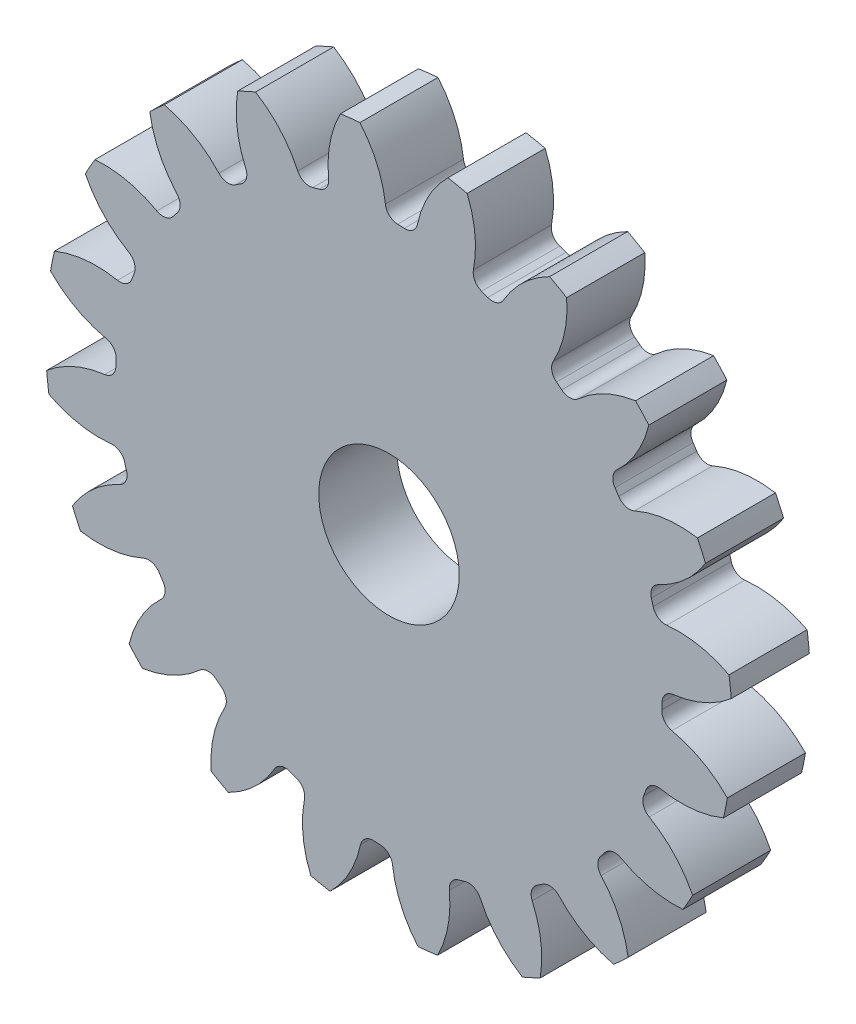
ISO-10303-21;
HEADER;
FILE_DESCRIPTION(('STEP AP214'),'2;1');
FILE_NAME('part.step','',(''),(''),'','','');
FILE_SCHEMA(('AUTOMOTIVE_DESIGN { 1 0 10303 214 1 1 1 1 }'));
ENDSEC;
DATA;
#1=APPLICATION_CONTEXT('core data for automotive mechanical design processes');
#2=APPLICATION_PROTOCOL_DEFINITION('international standard','automotive_design',2000,#1);
#3=PRODUCT_CONTEXT('',#1,'mechanical');
#4=PRODUCT('Part','Part','',(#3));
#5=PRODUCT_RELATED_PRODUCT_CATEGORY('part','',(#4));
#6=PRODUCT_DEFINITION_FORMATION('','',#4);
#7=PRODUCT_DEFINITION_CONTEXT('part definition',#1,'design');
#8=PRODUCT_DEFINITION('design','',#6,#7);
#9=PRODUCT_DEFINITION_SHAPE('','',#8);
#10=(LENGTH_UNIT() NAMED_UNIT(*) SI_UNIT(.MILLI.,.METRE.));
#11=(NAMED_UNIT(*) PLANE_ANGLE_UNIT() SI_UNIT($,.RADIAN.));
#12=(NAMED_UNIT(*) SI_UNIT($,.STERADIAN.) SOLID_ANGLE_UNIT());
#13=UNCERTAINTY_MEASURE_WITH_UNIT(LENGTH_MEASURE(1.E-05),#10,'distance_accuracy_value','');
#14=(GEOMETRIC_REPRESENTATION_CONTEXT(3) GLOBAL_UNCERTAINTY_ASSIGNED_CONTEXT((#13)) GLOBAL_UNIT_ASSIGNED_CONTEXT((#10,
#11,#12)) REPRESENTATION_CONTEXT('',''));
#15=CARTESIAN_POINT('',(0.,0.,0.));
#16=DIRECTION('',(0.,0.,1.));
#17=DIRECTION('',(1.,0.,0.));
#18=AXIS2_PLACEMENT_3D('',#15,#16,#17);
#19=CARTESIAN_POINT('',(0.,0.,127.));
#20=DIRECTION('',(0.,0.,-1.));
#21=DIRECTION('',(-1.,0.,0.));
#22=AXIS2_PLACEMENT_3D('',#19,#20,#21);
#23=CYLINDRICAL_SURFACE('',#22,558.8);
#24=DIRECTION('',(0.,0.,-1.));
#25=VECTOR('',#24,1.);
#26=CARTESIAN_POINT('',(553.190193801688,78.9813236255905,63.5));
#27=LINE('',#26,#25);
#28=CARTESIAN_POINT('',(553.190193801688,78.9813236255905,127.));
#29=VERTEX_POINT('',#28);
#30=CARTESIAN_POINT('',(553.190193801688,78.9813236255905,0.));
#31=VERTEX_POINT('',#30);
#32=EDGE_CURVE('E816',#29,#31,#27,.T.);
#33=ORIENTED_EDGE('',*,*,#32,.F.);
#34=CARTESIAN_POINT('',(0.,0.,127.));
#35=DIRECTION('',(0.,0.,1.));
#36=DIRECTION('',(1.,0.,0.));
#37=AXIS2_PLACEMENT_3D('',#34,#35,#36);
#38=CIRCLE('',#37,558.8);
#39=CARTESIAN_POINT('',(556.800863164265,47.2254039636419,127.));
#40=VERTEX_POINT('',#39);
#41=EDGE_CURVE('E1537',#40,#29,#38,.T.);
#42=ORIENTED_EDGE('',*,*,#41,.F.);
#43=DIRECTION('',(0.,0.,-1.));
#44=VECTOR('',#43,1.);
#45=CARTESIAN_POINT('',(556.800863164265,47.2254039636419,63.5));
#46=LINE('',#45,#44);
#47=CARTESIAN_POINT('',(556.800863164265,47.2254039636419,0.));
#48=VERTEX_POINT('',#47);
#49=EDGE_CURVE('E1531',#48,#40,#46,.F.);
#50=ORIENTED_EDGE('',*,*,#49,.F.);
#51=CARTESIAN_POINT('',(0.,0.,0.));
#52=DIRECTION('',(0.,0.,1.));
#53=DIRECTION('',(1.,0.,0.));
#54=AXIS2_PLACEMENT_3D('',#51,#52,#53);
#55=CIRCLE('',#54,558.8);
#56=EDGE_CURVE('E1542',#48,#31,#55,.T.);
#57=ORIENTED_EDGE('',*,*,#56,.T.);
#58=EDGE_LOOP('',(#33,#42,#50,#57));
#59=FACE_BOUND('',#58,.T.);
#60=ADVANCED_FACE('F33',(#59),#23,.T.);
#61=DIRECTION('',(0.,0.,-1.));
#62=VECTOR('',#61,1.);
#63=CARTESIAN_POINT('',(514.955636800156,216.974957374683,63.5));
#64=LINE('',#63,#62);
#65=CARTESIAN_POINT('',(514.955636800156,216.974957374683,0.));
#66=VERTEX_POINT('',#65);
#67=CARTESIAN_POINT('',(514.955636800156,216.974957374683,127.));
#68=VERTEX_POINT('',#67);
#69=EDGE_CURVE('E787',#66,#68,#64,.F.);
#70=ORIENTED_EDGE('',*,*,#69,.F.);
#71=CARTESIAN_POINT('',(501.70856732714,246.060873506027,0.));
#72=VERTEX_POINT('',#71);
#73=EDGE_CURVE('E1545',#66,#72,#55,.T.);
#74=ORIENTED_EDGE('',*,*,#73,.T.);
#75=DIRECTION('',(0.,0.,-1.));
#76=VECTOR('',#75,1.);
#77=CARTESIAN_POINT('',(501.70856732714,246.060873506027,63.5));
#78=LINE('',#77,#76);
#79=CARTESIAN_POINT('',(501.70856732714,246.060873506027,127.));
#80=VERTEX_POINT('',#79);
#81=EDGE_CURVE('E849',#80,#72,#78,.T.);
#82=ORIENTED_EDGE('',*,*,#81,.F.);
#83=EDGE_CURVE('E1540',#68,#80,#38,.T.);
#84=ORIENTED_EDGE('',*,*,#83,.F.);
#85=EDGE_LOOP('',(#70,#74,#82,#84));
#86=FACE_BOUND('',#85,.T.);
#87=ADVANCED_FACE('F1771',(#86),#23,.T.);
#88=CARTESIAN_POINT('',(0.,0.,127.));
#89=DIRECTION('',(0.,0.,1.));
#90=DIRECTION('',(1.,0.,0.));
#91=AXIS2_PLACEMENT_3D('',#88,#89,#90);
#92=PLANE('',#91);
#93=CARTESIAN_POINT('',(0.,0.,127.000000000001));
#94=DIRECTION('',(0.,0.,1.));
#95=DIRECTION('',(1.,0.,0.));
#96=AXIS2_PLACEMENT_3D('',#93,#94,#95);
#97=CIRCLE('',#96,114.3);
#98=CARTESIAN_POINT('',(114.3,0.,127.000000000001));
#99=VERTEX_POINT('',#98);
#100=EDGE_CURVE('E804',#99,#99,#97,.T.);
#101=ORIENTED_EDGE('',*,*,#100,.F.);
#102=EDGE_LOOP('',(#101));
#103=FACE_BOUND('',#102,.T.);
#104=ORIENTED_EDGE('',*,*,#41,.T.);
#105=CARTESIAN_POINT('',(470.780495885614,-79.0061470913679,127.));
#106=DIRECTION('',(0.,0.,-1.));
#107=DIRECTION('',(0.951056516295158,0.309016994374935,0.));
#108=AXIS2_PLACEMENT_3D('',#105,#106,#107);
#109=CIRCLE('',#108,178.189223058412);
#110=CARTESIAN_POINT('',(451.949338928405,98.1852374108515,127.));
#111=VERTEX_POINT('',#110);
#112=EDGE_CURVE('E796',#111,#29,#109,.T.);
#113=ORIENTED_EDGE('',*,*,#112,.F.);
#114=CARTESIAN_POINT('',(449.764327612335,118.745056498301,127.));
#115=DIRECTION('',(0.,0.,1.));
#116=DIRECTION('',(-0.951056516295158,-0.309016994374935,0.));
#117=AXIS2_PLACEMENT_3D('',#114,#115,#116);
#118=CIRCLE('',#117,20.6756);
#119=CARTESIAN_POINT('',(429.773710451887,113.467210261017,127.));
#120=VERTEX_POINT('',#119);
#121=EDGE_CURVE('E794',#120,#111,#118,.T.);
#122=ORIENTED_EDGE('',*,*,#121,.F.);
#123=CARTESIAN_POINT('',(0.,0.,127.));
#124=DIRECTION('',(0.,0.,-1.));
#125=DIRECTION('',(0.951056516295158,0.309016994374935,0.));
#126=AXIS2_PLACEMENT_3D('',#123,#124,#125);
#127=CIRCLE('',#126,444.5);
#128=CARTESIAN_POINT('',(426.885419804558,123.891437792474,127.));
#129=VERTEX_POINT('',#128);
#130=EDGE_CURVE('E779',#129,#120,#127,.T.);
#131=ORIENTED_EDGE('',*,*,#130,.F.);
#132=CARTESIAN_POINT('',(446.74169018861,129.654159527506,127.));
#133=DIRECTION('',(0.,0.,1.));
#134=DIRECTION('',(-0.951056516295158,-0.309016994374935,0.));
#135=AXIS2_PLACEMENT_3D('',#132,#133,#134);
#136=CIRCLE('',#135,20.6756);
#137=CARTESIAN_POINT('',(438.034218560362,148.406769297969,127.));
#138=VERTEX_POINT('',#137);
#139=EDGE_CURVE('E771',#138,#129,#136,.T.);
#140=ORIENTED_EDGE('',*,*,#139,.F.);
#141=CARTESIAN_POINT('',(362.990321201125,310.023020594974,127.));
#142=DIRECTION('',(0.,0.,-1.));
#143=DIRECTION('',(-0.951056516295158,-0.309016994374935,0.));
#144=AXIS2_PLACEMENT_3D('',#141,#142,#143);
#145=CIRCLE('',#144,178.189223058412);
#146=EDGE_CURVE('E801',#68,#138,#145,.T.);
#147=ORIENTED_EDGE('',*,*,#146,.F.);
#148=ORIENTED_EDGE('',*,*,#83,.T.);
#149=CARTESIAN_POINT('',(472.153100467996,70.3398628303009,127.));
#150=DIRECTION('',(0.,0.,-1.));
#151=DIRECTION('',(0.809016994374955,0.587785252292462,0.));
#152=AXIS2_PLACEMENT_3D('',#149,#150,#151);
#153=CIRCLE('',#152,178.189223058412);
#154=CARTESIAN_POINT('',(399.488456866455,233.039736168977,127.));
#155=VERTEX_POINT('',#154);
#156=EDGE_CURVE('E825',#155,#80,#153,.T.);
#157=ORIENTED_EDGE('',*,*,#156,.F.);
#158=CARTESIAN_POINT('',(391.057054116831,251.918080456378,127.));
#159=DIRECTION('',(0.,0.,1.));
#160=DIRECTION('',(-0.809016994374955,-0.587785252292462,0.));
#161=AXIS2_PLACEMENT_3D('',#158,#159,#160);
#162=CIRCLE('',#161,20.6756);
#163=CARTESIAN_POINT('',(373.675791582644,240.721109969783,127.));
#164=VERTEX_POINT('',#163);
#165=EDGE_CURVE('E823',#164,#155,#162,.T.);
#166=ORIENTED_EDGE('',*,*,#165,.F.);
#167=CARTESIAN_POINT('',(0.,0.,127.));
#168=DIRECTION('',(0.,0.,-1.));
#169=DIRECTION('',(0.809016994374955,0.587785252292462,0.));
#170=AXIS2_PLACEMENT_3D('',#167,#168,#169);
#171=CIRCLE('',#170,444.5);
#172=CARTESIAN_POINT('',(367.707600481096,249.7426085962,127.));
#173=VERTEX_POINT('',#172);
#174=EDGE_CURVE('E820',#173,#164,#171,.T.);
#175=ORIENTED_EDGE('',*,*,#174,.F.);
#176=CARTESIAN_POINT('',(384.811256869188,261.359207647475,127.));
#177=DIRECTION('',(0.,0.,1.));
#178=DIRECTION('',(-0.809016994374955,-0.587785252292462,0.));
#179=AXIS2_PLACEMENT_3D('',#176,#177,#178);
#180=CIRCLE('',#179,20.6756);
#181=CARTESIAN_POINT('',(370.735084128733,276.503242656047,127.));
#182=VERTEX_POINT('',#181);
#183=EDGE_CURVE('E818',#182,#173,#180,.T.);
#184=ORIENTED_EDGE('',*,*,#183,.F.);
#185=CARTESIAN_POINT('',(249.421928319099,407.019591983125,127.));
#186=DIRECTION('',(0.,0.,-1.));
#187=DIRECTION('',(-0.809016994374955,-0.587785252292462,0.));
#188=AXIS2_PLACEMENT_3D('',#185,#186,#187);
#189=CIRCLE('',#188,178.189223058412);
#190=CARTESIAN_POINT('',(422.702964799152,365.485490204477,127.));
#191=VERTEX_POINT('',#190);
#192=EDGE_CURVE('E828',#191,#182,#189,.T.);
#193=ORIENTED_EDGE('',*,*,#192,.F.);
#194=CARTESIAN_POINT('',(401.116210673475,389.054270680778,127.));
#195=VERTEX_POINT('',#194);
#196=EDGE_CURVE('E1593',#191,#195,#38,.T.);
#197=ORIENTED_EDGE('',*,*,#196,.T.);
#198=CARTESIAN_POINT('',(427.308069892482,212.800516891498,127.));
#199=DIRECTION('',(0.,0.,-1.));
#200=DIRECTION('',(0.587785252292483,0.80901699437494,0.));
#201=AXIS2_PLACEMENT_3D('',#198,#199,#200);
#202=CIRCLE('',#201,178.189223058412);
#203=CARTESIAN_POINT('',(307.922861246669,345.082681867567,127.));
#204=VERTEX_POINT('',#203);
#205=EDGE_CURVE('E860',#204,#195,#202,.T.);
#206=ORIENTED_EDGE('',*,*,#205,.F.);
#207=CARTESIAN_POINT('',(294.070391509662,360.431607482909,127.));
#208=DIRECTION('',(0.,0.,1.));
#209=DIRECTION('',(-0.587785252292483,-0.80901699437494,0.));
#210=AXIS2_PLACEMENT_3D('',#207,#208,#209);
#211=CIRCLE('',#210,20.6756);
#212=CARTESIAN_POINT('',(280.999882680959,344.411550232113,127.));
#213=VERTEX_POINT('',#212);
#214=EDGE_CURVE('E858',#213,#204,#211,.T.);
#215=ORIENTED_EDGE('',*,*,#214,.F.);
#216=CARTESIAN_POINT('',(0.,0.,127.));
#217=DIRECTION('',(0.,0.,-1.));
#218=DIRECTION('',(0.587785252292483,0.80901699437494,0.));
#219=AXIS2_PLACEMENT_3D('',#216,#217,#218);
#220=CIRCLE('',#219,444.5);
#221=CARTESIAN_POINT('',(272.535999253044,351.147232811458,127.));
#222=VERTEX_POINT('',#221);
#223=EDGE_CURVE('E855',#222,#213,#220,.T.);
#224=ORIENTED_EDGE('',*,*,#223,.F.);
#225=CARTESIAN_POINT('',(285.212816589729,367.480595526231,127.));
#226=DIRECTION('',(0.,0.,1.));
#227=DIRECTION('',(-0.587785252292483,-0.80901699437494,0.));
#228=AXIS2_PLACEMENT_3D('',#225,#226,#227);
#229=CIRCLE('',#228,20.6756);
#230=CARTESIAN_POINT('',(267.145816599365,377.533652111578,127.));
#231=VERTEX_POINT('',#230);
#232=EDGE_CURVE('E853',#231,#222,#229,.T.);
#233=ORIENTED_EDGE('',*,*,#232,.F.);
#234=CARTESIAN_POINT('',(111.438379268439,464.174249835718,127.));
#235=DIRECTION('',(0.,0.,-1.));
#236=DIRECTION('',(-0.587785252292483,-0.80901699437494,0.));
#237=AXIS2_PLACEMENT_3D('',#234,#235,#236);
#238=CIRCLE('',#237,178.189223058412);
#239=CARTESIAN_POINT('',(289.073181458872,478.21975676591,127.));
#240=VERTEX_POINT('',#239);
#241=EDGE_CURVE('E863',#240,#231,#238,.T.);
#242=ORIENTED_EDGE('',*,*,#241,.F.);
#243=CARTESIAN_POINT('',(261.259804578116,493.964325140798,127.));
#244=VERTEX_POINT('',#243);
#245=EDGE_CURVE('E1753',#240,#244,#38,.T.);
#246=ORIENTED_EDGE('',*,*,#245,.T.);
#247=CARTESIAN_POINT('',(340.635148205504,334.430773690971,127.));
#248=DIRECTION('',(0.,0.,-1.));
#249=DIRECTION('',(0.309016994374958,0.95105651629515,0.));
#250=AXIS2_PLACEMENT_3D('',#247,#248,#249);
#251=CIRCLE('',#250,178.189223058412);
#252=CARTESIAN_POINT('',(186.215630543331,423.346530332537,127.));
#253=VERTEX_POINT('',#252);
#254=EDGE_CURVE('E898',#253,#244,#251,.T.);
#255=ORIENTED_EDGE('',*,*,#254,.F.);
#256=CARTESIAN_POINT('',(168.298070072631,433.663577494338,127.));
#257=DIRECTION('',(0.,0.,1.));
#258=DIRECTION('',(-0.309016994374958,-0.95105651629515,0.));
#259=AXIS2_PLACEMENT_3D('',#256,#257,#258);
#260=CIRCLE('',#259,20.6756);
#261=CARTESIAN_POINT('',(160.817747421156,414.38858830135,127.));
#262=VERTEX_POINT('',#261);
#263=EDGE_CURVE('E896',#262,#253,#260,.T.);
#264=ORIENTED_EDGE('',*,*,#263,.F.);
#265=CARTESIAN_POINT('',(0.,0.,127.));
#266=DIRECTION('',(0.,0.,-1.));
#267=DIRECTION('',(0.309016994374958,0.95105651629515,0.));
#268=AXIS2_PLACEMENT_3D('',#265,#266,#267);
#269=CIRCLE('',#268,444.5);
#270=CARTESIAN_POINT('',(150.686675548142,418.179119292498,127.));
#271=VERTEX_POINT('',#270);
#272=EDGE_CURVE('E893',#271,#262,#269,.T.);
#273=ORIENTED_EDGE('',*,*,#272,.F.);
#274=CARTESIAN_POINT('',(157.695758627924,437.630422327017,127.));
#275=DIRECTION('',(0.,0.,1.));
#276=DIRECTION('',(-0.309016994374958,-0.95105651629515,0.));
#277=AXIS2_PLACEMENT_3D('',#274,#275,#276);
#278=CIRCLE('',#277,20.6756);
#279=CARTESIAN_POINT('',(137.406455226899,441.608437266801,127.));
#280=VERTEX_POINT('',#279);
#281=EDGE_CURVE('E891',#280,#271,#278,.T.);
#282=ORIENTED_EDGE('',*,*,#281,.F.);
#283=CARTESIAN_POINT('',(-37.4535347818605,475.892298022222,127.));
#284=DIRECTION('',(0.,0.,-1.));
#285=DIRECTION('',(-0.309016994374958,-0.95105651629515,0.));
#286=AXIS2_PLACEMENT_3D('',#283,#284,#285);
#287=CIRCLE('',#286,178.189223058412);
#288=CARTESIAN_POINT('',(127.146901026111,544.142541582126,127.));
#289=VERTEX_POINT('',#288);
#290=EDGE_CURVE('E901',#289,#280,#287,.T.);
#291=ORIENTED_EDGE('',*,*,#290,.F.);
#292=CARTESIAN_POINT('',(95.8294685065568,550.52170980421,127.));
#293=VERTEX_POINT('',#292);
#294=EDGE_CURVE('E1749',#289,#293,#38,.T.);
#295=ORIENTED_EDGE('',*,*,#294,.T.);
#296=CARTESIAN_POINT('',(220.618484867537,423.324616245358,127.));
#297=DIRECTION('',(0.,0.,-1.));
#298=DIRECTION('',(0.,1.,0.));
#299=AXIS2_PLACEMENT_3D('',#296,#297,#298);
#300=CIRCLE('',#299,178.189223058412);
#301=CARTESIAN_POINT('',(46.2803164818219,460.170270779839,127.));
#302=VERTEX_POINT('',#301);
#303=EDGE_CURVE('E936',#302,#293,#300,.T.);
#304=ORIENTED_EDGE('',*,*,#303,.F.);
#305=CARTESIAN_POINT('',(26.0515609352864,464.445535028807,127.));
#306=DIRECTION('',(0.,0.,1.));
#307=DIRECTION('',(0.,-1.,0.));
#308=AXIS2_PLACEMENT_3D('',#305,#306,#307);
#309=CIRCLE('',#308,20.6756);
#310=CARTESIAN_POINT('',(24.8936505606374,443.802384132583,127.));
#311=VERTEX_POINT('',#310);
#312=EDGE_CURVE('E934',#311,#302,#309,.T.);
#313=ORIENTED_EDGE('',*,*,#312,.F.);
#314=CARTESIAN_POINT('',(0.,0.,127.));
#315=DIRECTION('',(0.,0.,-1.));
#316=DIRECTION('',(0.,1.,0.));
#317=AXIS2_PLACEMENT_3D('',#314,#315,#316);
#318=CIRCLE('',#317,444.5);
#319=CARTESIAN_POINT('',(14.0870901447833,444.276719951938,127.));
#320=VERTEX_POINT('',#319);
#321=EDGE_CURVE('E931',#320,#311,#318,.T.);
#322=ORIENTED_EDGE('',*,*,#321,.F.);
#323=CARTESIAN_POINT('',(14.7423410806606,464.941934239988,127.));
#324=DIRECTION('',(0.,0.,1.));
#325=DIRECTION('',(0.,-1.,0.));
#326=AXIS2_PLACEMENT_3D('',#323,#324,#325);
#327=CIRCLE('',#326,20.6756);
#328=CARTESIAN_POINT('',(-5.78320735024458,462.455511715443,127.));
#329=VERTEX_POINT('',#328);
#330=EDGE_CURVE('E929',#329,#320,#327,.T.);
#331=ORIENTED_EDGE('',*,*,#330,.F.);
#332=CARTESIAN_POINT('',(-182.67923589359,441.026692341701,127.));
#333=DIRECTION('',(0.,0.,-1.));
#334=DIRECTION('',(0.,-1.,0.));
#335=AXIS2_PLACEMENT_3D('',#332,#333,#334);
#336=CIRCLE('',#335,178.189223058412);
#337=CARTESIAN_POINT('',(-47.2254039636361,556.800863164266,127.));
#338=VERTEX_POINT('',#337);
#339=EDGE_CURVE('E939',#338,#329,#336,.T.);
#340=ORIENTED_EDGE('',*,*,#339,.F.);
#341=CARTESIAN_POINT('',(-78.9813236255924,553.190193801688,127.));
#342=VERTEX_POINT('',#341);
#343=EDGE_CURVE('E1745',#338,#342,#38,.T.);
#344=ORIENTED_EDGE('',*,*,#343,.T.);
#345=CARTESIAN_POINT('',(79.0061470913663,470.780495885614,127.));
#346=DIRECTION('',(0.,0.,-1.));
#347=DIRECTION('',(-0.309016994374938,0.951056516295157,0.));
#348=AXIS2_PLACEMENT_3D('',#345,#346,#347);
#349=CIRCLE('',#348,178.189223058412);
#350=CARTESIAN_POINT('',(-98.1852374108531,451.949338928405,127.));
#351=VERTEX_POINT('',#350);
#352=EDGE_CURVE('E974',#351,#342,#349,.T.);
#353=ORIENTED_EDGE('',*,*,#352,.F.);
#354=CARTESIAN_POINT('',(-118.745056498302,449.764327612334,127.));
#355=DIRECTION('',(0.,0.,1.));
#356=DIRECTION('',(0.309016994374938,-0.951056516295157,0.));
#357=AXIS2_PLACEMENT_3D('',#354,#355,#356);
#358=CIRCLE('',#357,20.6756);
#359=CARTESIAN_POINT('',(-113.467210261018,429.773710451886,127.));
#360=VERTEX_POINT('',#359);
#361=EDGE_CURVE('E972',#360,#351,#358,.T.);
#362=ORIENTED_EDGE('',*,*,#361,.F.);
#363=CARTESIAN_POINT('',(0.,0.,127.));
#364=DIRECTION('',(0.,0.,-1.));
#365=DIRECTION('',(-0.309016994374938,0.951056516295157,0.));
#366=AXIS2_PLACEMENT_3D('',#363,#364,#365);
#367=CIRCLE('',#366,444.5);
#368=CARTESIAN_POINT('',(-123.891437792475,426.885419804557,127.));
#369=VERTEX_POINT('',#368);
#370=EDGE_CURVE('E969',#369,#360,#367,.T.);
#371=ORIENTED_EDGE('',*,*,#370,.F.);
#372=CARTESIAN_POINT('',(-129.654159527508,446.741690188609,127.));
#373=DIRECTION('',(0.,0.,1.));
#374=DIRECTION('',(0.309016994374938,-0.951056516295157,0.));
#375=AXIS2_PLACEMENT_3D('',#372,#373,#374);
#376=CIRCLE('',#375,20.6756);
#377=CARTESIAN_POINT('',(-148.406769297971,438.034218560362,127.));
#378=VERTEX_POINT('',#377);
#379=EDGE_CURVE('E967',#378,#369,#376,.T.);
#380=ORIENTED_EDGE('',*,*,#379,.F.);
#381=CARTESIAN_POINT('',(-310.023020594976,362.990321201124,127.));
#382=DIRECTION('',(0.,0.,-1.));
#383=DIRECTION('',(0.309016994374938,-0.951056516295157,0.));
#384=AXIS2_PLACEMENT_3D('',#381,#382,#383);
#385=CIRCLE('',#384,178.189223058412);
#386=CARTESIAN_POINT('',(-216.974957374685,514.955636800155,127.));
#387=VERTEX_POINT('',#386);
#388=EDGE_CURVE('E977',#387,#378,#385,.T.);
#389=ORIENTED_EDGE('',*,*,#388,.F.);
#390=CARTESIAN_POINT('',(-246.060873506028,501.708567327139,127.));
#391=VERTEX_POINT('',#390);
#392=EDGE_CURVE('E1741',#387,#391,#38,.T.);
#393=ORIENTED_EDGE('',*,*,#392,.T.);
#394=CARTESIAN_POINT('',(-70.3398628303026,472.153100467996,127.));
#395=DIRECTION('',(0.,0.,-1.));
#396=DIRECTION('',(-0.587785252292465,0.809016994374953,0.));
#397=AXIS2_PLACEMENT_3D('',#394,#395,#396);
#398=CIRCLE('',#397,178.189223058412);
#399=CARTESIAN_POINT('',(-233.039736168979,399.488456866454,127.));
#400=VERTEX_POINT('',#399);
#401=EDGE_CURVE('E1012',#400,#391,#398,.T.);
#402=ORIENTED_EDGE('',*,*,#401,.F.);
#403=CARTESIAN_POINT('',(-251.918080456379,391.05705411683,127.));
#404=DIRECTION('',(0.,0.,1.));
#405=DIRECTION('',(0.587785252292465,-0.809016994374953,0.));
#406=AXIS2_PLACEMENT_3D('',#403,#404,#405);
#407=CIRCLE('',#406,20.6756);
#408=CARTESIAN_POINT('',(-240.721109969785,373.675791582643,127.));
#409=VERTEX_POINT('',#408);
#410=EDGE_CURVE('E1010',#409,#400,#407,.T.);
#411=ORIENTED_EDGE('',*,*,#410,.F.);
#412=CARTESIAN_POINT('',(0.,0.,127.));
#413=DIRECTION('',(0.,0.,-1.));
#414=DIRECTION('',(-0.587785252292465,0.809016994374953,0.));
#415=AXIS2_PLACEMENT_3D('',#412,#413,#414);
#416=CIRCLE('',#415,444.5);
#417=CARTESIAN_POINT('',(-249.742608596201,367.707600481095,127.));
#418=VERTEX_POINT('',#417);
#419=EDGE_CURVE('E1007',#418,#409,#416,.T.);
#420=ORIENTED_EDGE('',*,*,#419,.F.);
#421=CARTESIAN_POINT('',(-261.359207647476,384.811256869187,127.));
#422=DIRECTION('',(0.,0.,1.));
#423=DIRECTION('',(0.587785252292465,-0.809016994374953,0.));
#424=AXIS2_PLACEMENT_3D('',#421,#422,#423);
#425=CIRCLE('',#424,20.6756);
#426=CARTESIAN_POINT('',(-276.503242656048,370.735084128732,127.));
#427=VERTEX_POINT('',#426);
#428=EDGE_CURVE('E1005',#427,#418,#425,.T.);
#429=ORIENTED_EDGE('',*,*,#428,.F.);
#430=CARTESIAN_POINT('',(-407.019591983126,249.421928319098,127.));
#431=DIRECTION('',(0.,0.,-1.));
#432=DIRECTION('',(0.587785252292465,-0.809016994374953,0.));
#433=AXIS2_PLACEMENT_3D('',#430,#431,#432);
#434=CIRCLE('',#433,178.189223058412);
#435=CARTESIAN_POINT('',(-365.485490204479,422.70296479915,127.));
#436=VERTEX_POINT('',#435);
#437=EDGE_CURVE('E1015',#436,#427,#434,.T.);
#438=ORIENTED_EDGE('',*,*,#437,.F.);
#439=CARTESIAN_POINT('',(-389.054270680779,401.116210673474,127.));
#440=VERTEX_POINT('',#439);
#441=EDGE_CURVE('E1737',#436,#440,#38,.T.);
#442=ORIENTED_EDGE('',*,*,#441,.T.);
#443=CARTESIAN_POINT('',(-212.8005168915,427.308069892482,127.));
#444=DIRECTION('',(0.,0.,-1.));
#445=DIRECTION('',(-0.809016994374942,0.58778525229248,0.));
#446=AXIS2_PLACEMENT_3D('',#443,#444,#445);
#447=CIRCLE('',#446,178.189223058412);
#448=CARTESIAN_POINT('',(-345.082681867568,307.922861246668,127.));
#449=VERTEX_POINT('',#448);
#450=EDGE_CURVE('E1050',#449,#440,#447,.T.);
#451=ORIENTED_EDGE('',*,*,#450,.F.);
#452=CARTESIAN_POINT('',(-360.431607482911,294.070391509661,127.));
#453=DIRECTION('',(0.,0.,1.));
#454=DIRECTION('',(0.809016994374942,-0.58778525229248,0.));
#455=AXIS2_PLACEMENT_3D('',#452,#453,#454);
#456=CIRCLE('',#455,20.6756);
#457=CARTESIAN_POINT('',(-344.411550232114,280.999882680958,127.));
#458=VERTEX_POINT('',#457);
#459=EDGE_CURVE('E1048',#458,#449,#456,.T.);
#460=ORIENTED_EDGE('',*,*,#459,.F.);
#461=CARTESIAN_POINT('',(0.,0.,127.));
#462=DIRECTION('',(0.,0.,-1.));
#463=DIRECTION('',(-0.809016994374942,0.58778525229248,0.));
#464=AXIS2_PLACEMENT_3D('',#461,#462,#463);
#465=CIRCLE('',#464,444.5);
#466=CARTESIAN_POINT('',(-351.147232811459,272.535999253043,127.));
#467=VERTEX_POINT('',#466);
#468=EDGE_CURVE('E1045',#467,#458,#465,.T.);
#469=ORIENTED_EDGE('',*,*,#468,.F.);
#470=CARTESIAN_POINT('',(-367.480595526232,285.212816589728,127.));
#471=DIRECTION('',(0.,0.,1.));
#472=DIRECTION('',(0.809016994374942,-0.58778525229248,0.));
#473=AXIS2_PLACEMENT_3D('',#470,#471,#472);
#474=CIRCLE('',#473,20.6756);
#475=CARTESIAN_POINT('',(-377.533652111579,267.145816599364,127.));
#476=VERTEX_POINT('',#475);
#477=EDGE_CURVE('E1043',#476,#467,#474,.T.);
#478=ORIENTED_EDGE('',*,*,#477,.F.);
#479=CARTESIAN_POINT('',(-464.174249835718,111.438379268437,127.));
#480=DIRECTION('',(0.,0.,-1.));
#481=DIRECTION('',(0.809016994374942,-0.58778525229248,0.));
#482=AXIS2_PLACEMENT_3D('',#479,#480,#481);
#483=CIRCLE('',#482,178.189223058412);
#484=CARTESIAN_POINT('',(-478.219756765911,289.07318145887,127.));
#485=VERTEX_POINT('',#484);
#486=EDGE_CURVE('E1053',#485,#476,#483,.T.);
#487=ORIENTED_EDGE('',*,*,#486,.F.);
#488=CARTESIAN_POINT('',(-493.964325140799,261.259804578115,127.));
#489=VERTEX_POINT('',#488);
#490=EDGE_CURVE('E1733',#485,#489,#38,.T.);
#491=ORIENTED_EDGE('',*,*,#490,.T.);
#492=CARTESIAN_POINT('',(-334.430773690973,340.635148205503,127.));
#493=DIRECTION('',(0.,0.,-1.));
#494=DIRECTION('',(-0.951056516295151,0.309016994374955,0.));
#495=AXIS2_PLACEMENT_3D('',#492,#493,#494);
#496=CIRCLE('',#495,178.189223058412);
#497=CARTESIAN_POINT('',(-423.346530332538,186.215630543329,127.));
#498=VERTEX_POINT('',#497);
#499=EDGE_CURVE('E1088',#498,#489,#496,.T.);
#500=ORIENTED_EDGE('',*,*,#499,.F.);
#501=CARTESIAN_POINT('',(-433.663577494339,168.29807007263,127.));
#502=DIRECTION('',(0.,0.,1.));
#503=DIRECTION('',(0.951056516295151,-0.309016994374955,0.));
#504=AXIS2_PLACEMENT_3D('',#501,#502,#503);
#505=CIRCLE('',#504,20.6756);
#506=CARTESIAN_POINT('',(-414.38858830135,160.817747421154,127.));
#507=VERTEX_POINT('',#506);
#508=EDGE_CURVE('E1086',#507,#498,#505,.T.);
#509=ORIENTED_EDGE('',*,*,#508,.F.);
#510=CARTESIAN_POINT('',(0.,0.,127.));
#511=DIRECTION('',(0.,0.,-1.));
#512=DIRECTION('',(-0.951056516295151,0.309016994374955,0.));
#513=AXIS2_PLACEMENT_3D('',#510,#511,#512);
#514=CIRCLE('',#513,444.5);
#515=CARTESIAN_POINT('',(-418.179119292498,150.68667554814,127.));
#516=VERTEX_POINT('',#515);
#517=EDGE_CURVE('E1083',#516,#507,#514,.T.);
#518=ORIENTED_EDGE('',*,*,#517,.F.);
#519=CARTESIAN_POINT('',(-437.630422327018,157.695758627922,127.));
#520=DIRECTION('',(0.,0.,1.));
#521=DIRECTION('',(0.951056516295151,-0.309016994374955,0.));
#522=AXIS2_PLACEMENT_3D('',#519,#520,#521);
#523=CIRCLE('',#522,20.6756);
#524=CARTESIAN_POINT('',(-441.608437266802,137.406455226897,127.));
#525=VERTEX_POINT('',#524);
#526=EDGE_CURVE('E1081',#525,#516,#523,.T.);
#527=ORIENTED_EDGE('',*,*,#526,.F.);
#528=CARTESIAN_POINT('',(-475.892298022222,-37.4535347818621,127.));
#529=DIRECTION('',(0.,0.,-1.));
#530=DIRECTION('',(0.951056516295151,-0.309016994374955,0.));
#531=AXIS2_PLACEMENT_3D('',#528,#529,#530);
#532=CIRCLE('',#531,178.189223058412);
#533=CARTESIAN_POINT('',(-544.142541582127,127.146901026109,127.));
#534=VERTEX_POINT('',#533);
#535=EDGE_CURVE('E1091',#534,#525,#532,.T.);
#536=ORIENTED_EDGE('',*,*,#535,.F.);
#537=CARTESIAN_POINT('',(-550.52170980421,95.8294685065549,127.));
#538=VERTEX_POINT('',#537);
#539=EDGE_CURVE('E1729',#534,#538,#38,.T.);
#540=ORIENTED_EDGE('',*,*,#539,.T.);
#541=CARTESIAN_POINT('',(-423.324616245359,220.618484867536,127.));
#542=DIRECTION('',(0.,0.,-1.));
#543=DIRECTION('',(-1.,0.,0.));
#544=AXIS2_PLACEMENT_3D('',#541,#542,#543);
#545=CIRCLE('',#544,178.189223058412);
#546=CARTESIAN_POINT('',(-460.170270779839,46.2803164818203,127.));
#547=VERTEX_POINT('',#546);
#548=EDGE_CURVE('E1126',#547,#538,#545,.T.);
#549=ORIENTED_EDGE('',*,*,#548,.F.);
#550=CARTESIAN_POINT('',(-464.445535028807,26.0515609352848,127.));
#551=DIRECTION('',(0.,0.,1.));
#552=DIRECTION('',(1.,0.,0.));
#553=AXIS2_PLACEMENT_3D('',#550,#551,#552);
#554=CIRCLE('',#553,20.6756);
#555=CARTESIAN_POINT('',(-443.802384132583,24.8936505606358,127.));
#556=VERTEX_POINT('',#555);
#557=EDGE_CURVE('E1124',#556,#547,#554,.T.);
#558=ORIENTED_EDGE('',*,*,#557,.F.);
#559=CARTESIAN_POINT('',(0.,0.,127.));
#560=DIRECTION('',(0.,0.,-1.));
#561=DIRECTION('',(-1.,0.,0.));
#562=AXIS2_PLACEMENT_3D('',#559,#560,#561);
#563=CIRCLE('',#562,444.5);
#564=CARTESIAN_POINT('',(-444.276719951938,14.0870901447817,127.));
#565=VERTEX_POINT('',#564);
#566=EDGE_CURVE('E1121',#565,#556,#563,.T.);
#567=ORIENTED_EDGE('',*,*,#566,.F.);
#568=CARTESIAN_POINT('',(-464.941934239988,14.7423410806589,127.));
#569=DIRECTION('',(0.,0.,1.));
#570=DIRECTION('',(1.,0.,0.));
#571=AXIS2_PLACEMENT_3D('',#568,#569,#570);
#572=CIRCLE('',#571,20.6756);
#573=CARTESIAN_POINT('',(-462.455511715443,-5.7832073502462,127.));
#574=VERTEX_POINT('',#573);
#575=EDGE_CURVE('E1119',#574,#565,#572,.T.);
#576=ORIENTED_EDGE('',*,*,#575,.F.);
#577=CARTESIAN_POINT('',(-441.026692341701,-182.679235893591,127.));
#578=DIRECTION('',(0.,0.,-1.));
#579=DIRECTION('',(1.,0.,0.));
#580=AXIS2_PLACEMENT_3D('',#577,#578,#579);
#581=CIRCLE('',#580,178.189223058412);
#582=CARTESIAN_POINT('',(-556.800863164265,-47.2254039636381,127.));
#583=VERTEX_POINT('',#582);
#584=EDGE_CURVE('E1129',#583,#574,#581,.T.);
#585=ORIENTED_EDGE('',*,*,#584,.F.);
#586=CARTESIAN_POINT('',(-553.190193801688,-78.9813236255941,127.));
#587=VERTEX_POINT('',#586);
#588=EDGE_CURVE('E1725',#583,#587,#38,.T.);
#589=ORIENTED_EDGE('',*,*,#588,.T.);
#590=CARTESIAN_POINT('',(-470.780495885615,79.0061470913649,127.));
#591=DIRECTION('',(0.,0.,-1.));
#592=DIRECTION('',(-0.951056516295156,-0.309016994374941,0.));
#593=AXIS2_PLACEMENT_3D('',#590,#591,#592);
#594=CIRCLE('',#593,178.189223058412);
#595=CARTESIAN_POINT('',(-451.949338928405,-98.1852374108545,127.));
#596=VERTEX_POINT('',#595);
#597=EDGE_CURVE('E1164',#596,#587,#594,.T.);
#598=ORIENTED_EDGE('',*,*,#597,.F.);
#599=CARTESIAN_POINT('',(-449.764327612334,-118.745056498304,127.));
#600=DIRECTION('',(0.,0.,1.));
#601=DIRECTION('',(0.951056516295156,0.309016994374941,0.));
#602=AXIS2_PLACEMENT_3D('',#599,#600,#601);
#603=CIRCLE('',#602,20.6756);
#604=CARTESIAN_POINT('',(-429.773710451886,-113.46721026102,127.));
#605=VERTEX_POINT('',#604);
#606=EDGE_CURVE('E1162',#605,#596,#603,.T.);
#607=ORIENTED_EDGE('',*,*,#606,.F.);
#608=CARTESIAN_POINT('',(0.,0.,127.));
#609=DIRECTION('',(0.,0.,-1.));
#610=DIRECTION('',(-0.951056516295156,-0.309016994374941,0.));
#611=AXIS2_PLACEMENT_3D('',#608,#609,#610);
#612=CIRCLE('',#611,444.5);
#613=CARTESIAN_POINT('',(-426.885419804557,-123.891437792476,127.));
#614=VERTEX_POINT('',#613);
#615=EDGE_CURVE('E1159',#614,#605,#612,.T.);
#616=ORIENTED_EDGE('',*,*,#615,.F.);
#617=CARTESIAN_POINT('',(-446.741690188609,-129.654159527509,127.));
#618=DIRECTION('',(0.,0.,1.));
#619=DIRECTION('',(0.951056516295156,0.309016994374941,0.));
#620=AXIS2_PLACEMENT_3D('',#617,#618,#619);
#621=CIRCLE('',#620,20.6756);
#622=CARTESIAN_POINT('',(-438.034218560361,-148.406769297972,127.));
#623=VERTEX_POINT('',#622);
#624=EDGE_CURVE('E1157',#623,#614,#621,.T.);
#625=ORIENTED_EDGE('',*,*,#624,.F.);
#626=CARTESIAN_POINT('',(-362.990321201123,-310.023020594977,127.));
#627=DIRECTION('',(0.,0.,-1.));
#628=DIRECTION('',(0.951056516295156,0.309016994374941,0.));
#629=AXIS2_PLACEMENT_3D('',#626,#627,#628);
#630=CIRCLE('',#629,178.189223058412);
#631=CARTESIAN_POINT('',(-514.955636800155,-216.974957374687,127.));
#632=VERTEX_POINT('',#631);
#633=EDGE_CURVE('E1167',#632,#623,#630,.T.);
#634=ORIENTED_EDGE('',*,*,#633,.F.);
#635=CARTESIAN_POINT('',(-501.708567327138,-246.06087350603,127.));
#636=VERTEX_POINT('',#635);
#637=EDGE_CURVE('E1721',#632,#636,#38,.T.);
#638=ORIENTED_EDGE('',*,*,#637,.T.);
#639=CARTESIAN_POINT('',(-472.153100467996,-70.3398628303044,127.));
#640=DIRECTION('',(0.,0.,-1.));
#641=DIRECTION('',(-0.809016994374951,-0.587785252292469,0.));
#642=AXIS2_PLACEMENT_3D('',#639,#640,#641);
#643=CIRCLE('',#642,178.189223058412);
#644=CARTESIAN_POINT('',(-399.488456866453,-233.03973616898,127.));
#645=VERTEX_POINT('',#644);
#646=EDGE_CURVE('E1202',#645,#636,#643,.T.);
#647=ORIENTED_EDGE('',*,*,#646,.F.);
#648=CARTESIAN_POINT('',(-391.057054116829,-251.918080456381,127.));
#649=DIRECTION('',(0.,0.,1.));
#650=DIRECTION('',(0.809016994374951,0.587785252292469,0.));
#651=AXIS2_PLACEMENT_3D('',#648,#649,#650);
#652=CIRCLE('',#651,20.6756);
#653=CARTESIAN_POINT('',(-373.675791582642,-240.721109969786,127.));
#654=VERTEX_POINT('',#653);
#655=EDGE_CURVE('E1200',#654,#645,#652,.T.);
#656=ORIENTED_EDGE('',*,*,#655,.F.);
#657=CARTESIAN_POINT('',(0.,0.,127.));
#658=DIRECTION('',(0.,0.,-1.));
#659=DIRECTION('',(-0.809016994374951,-0.587785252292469,0.));
#660=AXIS2_PLACEMENT_3D('',#657,#658,#659);
#661=CIRCLE('',#660,444.5);
#662=CARTESIAN_POINT('',(-367.707600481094,-249.742608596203,127.));
#663=VERTEX_POINT('',#662);
#664=EDGE_CURVE('E1197',#663,#654,#661,.T.);
#665=ORIENTED_EDGE('',*,*,#664,.F.);
#666=CARTESIAN_POINT('',(-384.811256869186,-261.359207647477,127.));
#667=DIRECTION('',(0.,0.,1.));
#668=DIRECTION('',(0.809016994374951,0.587785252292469,0.));
#669=AXIS2_PLACEMENT_3D('',#666,#667,#668);
#670=CIRCLE('',#669,20.6756);
#671=CARTESIAN_POINT('',(-370.735084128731,-276.50324265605,127.));
#672=VERTEX_POINT('',#671);
#673=EDGE_CURVE('E1195',#672,#663,#670,.T.);
#674=ORIENTED_EDGE('',*,*,#673,.F.);
#675=CARTESIAN_POINT('',(-249.421928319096,-407.019591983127,127.));
#676=DIRECTION('',(0.,0.,-1.));
#677=DIRECTION('',(0.809016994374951,0.587785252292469,0.));
#678=AXIS2_PLACEMENT_3D('',#675,#676,#677);
#679=CIRCLE('',#678,178.189223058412);
#680=CARTESIAN_POINT('',(-422.702964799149,-365.48549020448,127.));
#681=VERTEX_POINT('',#680);
#682=EDGE_CURVE('E1205',#681,#672,#679,.T.);
#683=ORIENTED_EDGE('',*,*,#682,.F.);
#684=CARTESIAN_POINT('',(-401.116210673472,-389.054270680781,127.));
#685=VERTEX_POINT('',#684);
#686=EDGE_CURVE('E1717',#681,#685,#38,.T.);
#687=ORIENTED_EDGE('',*,*,#686,.T.);
#688=CARTESIAN_POINT('',(-427.308069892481,-212.800516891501,127.));
#689=DIRECTION('',(0.,0.,-1.));
#690=DIRECTION('',(-0.587785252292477,-0.809016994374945,0.));
#691=AXIS2_PLACEMENT_3D('',#688,#689,#690);
#692=CIRCLE('',#691,178.189223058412);
#693=CARTESIAN_POINT('',(-307.922861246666,-345.082681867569,127.));
#694=VERTEX_POINT('',#693);
#695=EDGE_CURVE('E1240',#694,#685,#692,.T.);
#696=ORIENTED_EDGE('',*,*,#695,.F.);
#697=CARTESIAN_POINT('',(-294.070391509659,-360.431607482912,127.));
#698=DIRECTION('',(0.,0.,1.));
#699=DIRECTION('',(0.587785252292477,0.809016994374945,0.));
#700=AXIS2_PLACEMENT_3D('',#697,#698,#699);
#701=CIRCLE('',#700,20.6756);
#702=CARTESIAN_POINT('',(-280.999882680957,-344.411550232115,127.));
#703=VERTEX_POINT('',#702);
#704=EDGE_CURVE('E1238',#703,#694,#701,.T.);
#705=ORIENTED_EDGE('',*,*,#704,.F.);
#706=CARTESIAN_POINT('',(0.,0.,127.));
#707=DIRECTION('',(0.,0.,-1.));
#708=DIRECTION('',(-0.587785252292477,-0.809016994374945,0.));
#709=AXIS2_PLACEMENT_3D('',#706,#707,#708);
#710=CIRCLE('',#709,444.5);
#711=CARTESIAN_POINT('',(-272.535999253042,-351.14723281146,127.));
#712=VERTEX_POINT('',#711);
#713=EDGE_CURVE('E1235',#712,#703,#710,.T.);
#714=ORIENTED_EDGE('',*,*,#713,.F.);
#715=CARTESIAN_POINT('',(-285.212816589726,-367.480595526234,127.));
#716=DIRECTION('',(0.,0.,1.));
#717=DIRECTION('',(0.587785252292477,0.809016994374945,0.));
#718=AXIS2_PLACEMENT_3D('',#715,#716,#717);
#719=CIRCLE('',#718,20.6756);
#720=CARTESIAN_POINT('',(-267.145816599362,-377.53365211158,127.));
#721=VERTEX_POINT('',#720);
#722=EDGE_CURVE('E1233',#721,#712,#719,.T.);
#723=ORIENTED_EDGE('',*,*,#722,.F.);
#724=CARTESIAN_POINT('',(-111.438379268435,-464.174249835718,127.));
#725=DIRECTION('',(0.,0.,-1.));
#726=DIRECTION('',(0.587785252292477,0.809016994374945,0.));
#727=AXIS2_PLACEMENT_3D('',#724,#725,#726);
#728=CIRCLE('',#727,178.189223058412);
#729=CARTESIAN_POINT('',(-289.073181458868,-478.219756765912,127.));
#730=VERTEX_POINT('',#729);
#731=EDGE_CURVE('E1243',#730,#721,#728,.T.);
#732=ORIENTED_EDGE('',*,*,#731,.F.);
#733=CARTESIAN_POINT('',(-261.259804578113,-493.9643251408,127.));
#734=VERTEX_POINT('',#733);
#735=EDGE_CURVE('E1713',#730,#734,#38,.T.);
#736=ORIENTED_EDGE('',*,*,#735,.T.);
#737=CARTESIAN_POINT('',(-340.635148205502,-334.430773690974,127.));
#738=DIRECTION('',(0.,0.,-1.));
#739=DIRECTION('',(-0.309016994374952,-0.951056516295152,0.));
#740=AXIS2_PLACEMENT_3D('',#737,#738,#739);
#741=CIRCLE('',#740,178.189223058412);
#742=CARTESIAN_POINT('',(-186.215630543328,-423.346530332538,127.));
#743=VERTEX_POINT('',#742);
#744=EDGE_CURVE('E1278',#743,#734,#741,.T.);
#745=ORIENTED_EDGE('',*,*,#744,.F.);
#746=CARTESIAN_POINT('',(-168.298070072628,-433.663577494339,127.));
#747=DIRECTION('',(0.,0.,1.));
#748=DIRECTION('',(0.309016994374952,0.951056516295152,0.));
#749=AXIS2_PLACEMENT_3D('',#746,#747,#748);
#750=CIRCLE('',#749,20.6756);
#751=CARTESIAN_POINT('',(-160.817747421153,-414.388588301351,127.));
#752=VERTEX_POINT('',#751);
#753=EDGE_CURVE('E1276',#752,#743,#750,.T.);
#754=ORIENTED_EDGE('',*,*,#753,.F.);
#755=CARTESIAN_POINT('',(0.,0.,127.));
#756=DIRECTION('',(0.,0.,-1.));
#757=DIRECTION('',(-0.309016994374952,-0.951056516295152,0.));
#758=AXIS2_PLACEMENT_3D('',#755,#756,#757);
#759=CIRCLE('',#758,444.5);
#760=CARTESIAN_POINT('',(-150.686675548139,-418.179119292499,127.));
#761=VERTEX_POINT('',#760);
#762=EDGE_CURVE('E1273',#761,#752,#759,.T.);
#763=ORIENTED_EDGE('',*,*,#762,.F.);
#764=CARTESIAN_POINT('',(-157.695758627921,-437.630422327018,127.));
#765=DIRECTION('',(0.,0.,1.));
#766=DIRECTION('',(0.309016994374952,0.951056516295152,0.));
#767=AXIS2_PLACEMENT_3D('',#764,#765,#766);
#768=CIRCLE('',#767,20.6756);
#769=CARTESIAN_POINT('',(-137.406455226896,-441.608437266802,127.));
#770=VERTEX_POINT('',#769);
#771=EDGE_CURVE('E1271',#770,#761,#768,.T.);
#772=ORIENTED_EDGE('',*,*,#771,.F.);
#773=CARTESIAN_POINT('',(37.4535347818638,-475.892298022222,127.));
#774=DIRECTION('',(0.,0.,-1.));
#775=DIRECTION('',(0.309016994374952,0.951056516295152,0.));
#776=AXIS2_PLACEMENT_3D('',#773,#774,#775);
#777=CIRCLE('',#776,178.189223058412);
#778=CARTESIAN_POINT('',(-127.146901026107,-544.142541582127,127.));
#779=VERTEX_POINT('',#778);
#780=EDGE_CURVE('E1281',#779,#770,#777,.T.);
#781=ORIENTED_EDGE('',*,*,#780,.F.);
#782=CARTESIAN_POINT('',(-95.829468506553,-550.521709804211,127.));
#783=VERTEX_POINT('',#782);
#784=EDGE_CURVE('E1709',#779,#783,#38,.T.);
#785=ORIENTED_EDGE('',*,*,#784,.T.);
#786=CARTESIAN_POINT('',(-220.618484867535,-423.32461624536,127.));
#787=DIRECTION('',(0.,0.,-1.));
#788=DIRECTION('',(0.,-1.,0.));
#789=AXIS2_PLACEMENT_3D('',#786,#787,#788);
#790=CIRCLE('',#789,178.189223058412);
#791=CARTESIAN_POINT('',(-46.2803164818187,-460.170270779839,127.));
#792=VERTEX_POINT('',#791);
#793=EDGE_CURVE('E1316',#792,#783,#790,.T.);
#794=ORIENTED_EDGE('',*,*,#793,.F.);
#795=CARTESIAN_POINT('',(-26.0515609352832,-464.445535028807,127.));
#796=DIRECTION('',(0.,0.,1.));
#797=DIRECTION('',(0.,1.,0.));
#798=AXIS2_PLACEMENT_3D('',#795,#796,#797);
#799=CIRCLE('',#798,20.6756);
#800=CARTESIAN_POINT('',(-24.8936505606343,-443.802384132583,127.));
#801=VERTEX_POINT('',#800);
#802=EDGE_CURVE('E1314',#801,#792,#799,.T.);
#803=ORIENTED_EDGE('',*,*,#802,.F.);
#804=CARTESIAN_POINT('',(0.,0.,127.));
#805=DIRECTION('',(0.,0.,-1.));
#806=DIRECTION('',(0.,-1.,0.));
#807=AXIS2_PLACEMENT_3D('',#804,#805,#806);
#808=CIRCLE('',#807,444.5);
#809=CARTESIAN_POINT('',(-14.0870901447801,-444.276719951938,127.));
#810=VERTEX_POINT('',#809);
#811=EDGE_CURVE('E1311',#810,#801,#808,.T.);
#812=ORIENTED_EDGE('',*,*,#811,.F.);
#813=CARTESIAN_POINT('',(-14.7423410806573,-464.941934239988,127.));
#814=DIRECTION('',(0.,0.,1.));
#815=DIRECTION('',(0.,1.,0.));
#816=AXIS2_PLACEMENT_3D('',#813,#814,#815);
#817=CIRCLE('',#816,20.6756);
#818=CARTESIAN_POINT('',(5.78320735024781,-462.455511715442,127.));
#819=VERTEX_POINT('',#818);
#820=EDGE_CURVE('E1309',#819,#810,#817,.T.);
#821=ORIENTED_EDGE('',*,*,#820,.F.);
#822=CARTESIAN_POINT('',(182.679235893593,-441.0266923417,127.));
#823=DIRECTION('',(0.,0.,-1.));
#824=DIRECTION('',(0.,1.,0.));
#825=AXIS2_PLACEMENT_3D('',#822,#823,#824);
#826=CIRCLE('',#825,178.189223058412);
#827=CARTESIAN_POINT('',(47.22540396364,-556.800863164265,127.));
#828=VERTEX_POINT('',#827);
#829=EDGE_CURVE('E1319',#828,#819,#826,.T.);
#830=ORIENTED_EDGE('',*,*,#829,.F.);
#831=CARTESIAN_POINT('',(78.9813236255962,-553.190193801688,127.));
#832=VERTEX_POINT('',#831);
#833=EDGE_CURVE('E1705',#828,#832,#38,.T.);
#834=ORIENTED_EDGE('',*,*,#833,.T.);
#835=CARTESIAN_POINT('',(-79.0061470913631,-470.780495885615,127.));
#836=DIRECTION('',(0.,0.,-1.));
#837=DIRECTION('',(0.309016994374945,-0.951056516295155,0.));
#838=AXIS2_PLACEMENT_3D('',#835,#836,#837);
#839=CIRCLE('',#838,178.189223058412);
#840=CARTESIAN_POINT('',(98.1852374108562,-451.949338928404,127.));
#841=VERTEX_POINT('',#840);
#842=EDGE_CURVE('E1354',#841,#832,#839,.T.);
#843=ORIENTED_EDGE('',*,*,#842,.F.);
#844=CARTESIAN_POINT('',(118.745056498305,-449.764327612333,127.));
#845=DIRECTION('',(0.,0.,1.));
#846=DIRECTION('',(-0.309016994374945,0.951056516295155,0.));
#847=AXIS2_PLACEMENT_3D('',#844,#845,#846);
#848=CIRCLE('',#847,20.6756);
#849=CARTESIAN_POINT('',(113.467210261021,-429.773710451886,127.));
#850=VERTEX_POINT('',#849);
#851=EDGE_CURVE('E1352',#850,#841,#848,.T.);
#852=ORIENTED_EDGE('',*,*,#851,.F.);
#853=CARTESIAN_POINT('',(0.,0.,127.));
#854=DIRECTION('',(0.,0.,-1.));
#855=DIRECTION('',(0.309016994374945,-0.951056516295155,0.));
#856=AXIS2_PLACEMENT_3D('',#853,#854,#855);
#857=CIRCLE('',#856,444.5);
#858=CARTESIAN_POINT('',(123.891437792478,-426.885419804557,127.));
#859=VERTEX_POINT('',#858);
#860=EDGE_CURVE('E1349',#859,#850,#857,.T.);
#861=ORIENTED_EDGE('',*,*,#860,.F.);
#862=CARTESIAN_POINT('',(129.654159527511,-446.741690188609,127.));
#863=DIRECTION('',(0.,0.,1.));
#864=DIRECTION('',(-0.309016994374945,0.951056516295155,0.));
#865=AXIS2_PLACEMENT_3D('',#862,#863,#864);
#866=CIRCLE('',#865,20.6756);
#867=CARTESIAN_POINT('',(148.406769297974,-438.034218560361,127.));
#868=VERTEX_POINT('',#867);
#869=EDGE_CURVE('E1347',#868,#859,#866,.T.);
#870=ORIENTED_EDGE('',*,*,#869,.F.);
#871=CARTESIAN_POINT('',(310.023020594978,-362.990321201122,127.));
#872=DIRECTION('',(0.,0.,-1.));
#873=DIRECTION('',(-0.309016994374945,0.951056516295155,0.));
#874=AXIS2_PLACEMENT_3D('',#871,#872,#873);
#875=CIRCLE('',#874,178.189223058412);
#876=CARTESIAN_POINT('',(216.974957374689,-514.955636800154,127.));
#877=VERTEX_POINT('',#876);
#878=EDGE_CURVE('E1357',#877,#868,#875,.T.);
#879=ORIENTED_EDGE('',*,*,#878,.F.);
#880=CARTESIAN_POINT('',(246.060873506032,-501.708567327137,127.));
#881=VERTEX_POINT('',#880);
#882=EDGE_CURVE('E1701',#877,#881,#38,.T.);
#883=ORIENTED_EDGE('',*,*,#882,.T.);
#884=CARTESIAN_POINT('',(70.339862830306,-472.153100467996,127.));
#885=DIRECTION('',(0.,0.,-1.));
#886=DIRECTION('',(0.587785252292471,-0.809016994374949,0.));
#887=AXIS2_PLACEMENT_3D('',#884,#885,#886);
#888=CIRCLE('',#887,178.189223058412);
#889=CARTESIAN_POINT('',(233.039736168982,-399.488456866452,127.));
#890=VERTEX_POINT('',#889);
#891=EDGE_CURVE('E1392',#890,#881,#888,.T.);
#892=ORIENTED_EDGE('',*,*,#891,.F.);
#893=CARTESIAN_POINT('',(251.918080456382,-391.057054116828,127.));
#894=DIRECTION('',(0.,0.,1.));
#895=DIRECTION('',(-0.587785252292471,0.809016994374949,0.));
#896=AXIS2_PLACEMENT_3D('',#893,#894,#895);
#897=CIRCLE('',#896,20.6756);
#898=CARTESIAN_POINT('',(240.721109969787,-373.675791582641,127.));
#899=VERTEX_POINT('',#898);
#900=EDGE_CURVE('E1390',#899,#890,#897,.T.);
#901=ORIENTED_EDGE('',*,*,#900,.F.);
#902=CARTESIAN_POINT('',(0.,0.,127.));
#903=DIRECTION('',(0.,0.,-1.));
#904=DIRECTION('',(0.587785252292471,-0.809016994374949,0.));
#905=AXIS2_PLACEMENT_3D('',#902,#903,#904);
#906=CIRCLE('',#905,444.5);
#907=CARTESIAN_POINT('',(249.742608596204,-367.707600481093,127.));
#908=VERTEX_POINT('',#907);
#909=EDGE_CURVE('E1387',#908,#899,#906,.T.);
#910=ORIENTED_EDGE('',*,*,#909,.F.);
#911=CARTESIAN_POINT('',(261.359207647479,-384.811256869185,127.));
#912=DIRECTION('',(0.,0.,1.));
#913=DIRECTION('',(-0.587785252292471,0.809016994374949,0.));
#914=AXIS2_PLACEMENT_3D('',#911,#912,#913);
#915=CIRCLE('',#914,20.6756);
#916=CARTESIAN_POINT('',(276.503242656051,-370.73508412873,127.));
#917=VERTEX_POINT('',#916);
#918=EDGE_CURVE('E1385',#917,#908,#915,.T.);
#919=ORIENTED_EDGE('',*,*,#918,.F.);
#920=CARTESIAN_POINT('',(407.019591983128,-249.421928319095,127.));
#921=DIRECTION('',(0.,0.,-1.));
#922=DIRECTION('',(-0.587785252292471,0.809016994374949,0.));
#923=AXIS2_PLACEMENT_3D('',#920,#921,#922);
#924=CIRCLE('',#923,178.189223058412);
#925=CARTESIAN_POINT('',(365.485490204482,-422.702964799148,127.));
#926=VERTEX_POINT('',#925);
#927=EDGE_CURVE('E1395',#926,#917,#924,.T.);
#928=ORIENTED_EDGE('',*,*,#927,.F.);
#929=CARTESIAN_POINT('',(389.054270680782,-401.116210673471,127.));
#930=VERTEX_POINT('',#929);
#931=EDGE_CURVE('E1697',#926,#930,#38,.T.);
#932=ORIENTED_EDGE('',*,*,#931,.T.);
#933=CARTESIAN_POINT('',(212.800516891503,-427.30806989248,127.));
#934=DIRECTION('',(0.,0.,-1.));
#935=DIRECTION('',(0.809016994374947,-0.587785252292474,0.));
#936=AXIS2_PLACEMENT_3D('',#933,#934,#935);
#937=CIRCLE('',#936,178.189223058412);
#938=CARTESIAN_POINT('',(345.08268186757,-307.922861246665,127.));
#939=VERTEX_POINT('',#938);
#940=EDGE_CURVE('E1430',#939,#930,#937,.T.);
#941=ORIENTED_EDGE('',*,*,#940,.F.);
#942=CARTESIAN_POINT('',(360.431607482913,-294.070391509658,127.));
#943=DIRECTION('',(0.,0.,1.));
#944=DIRECTION('',(-0.809016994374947,0.587785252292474,0.));
#945=AXIS2_PLACEMENT_3D('',#942,#943,#944);
#946=CIRCLE('',#945,20.6756);
#947=CARTESIAN_POINT('',(344.411550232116,-280.999882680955,127.));
#948=VERTEX_POINT('',#947);
#949=EDGE_CURVE('E1428',#948,#939,#946,.T.);
#950=ORIENTED_EDGE('',*,*,#949,.F.);
#951=CARTESIAN_POINT('',(0.,0.,127.));
#952=DIRECTION('',(0.,0.,-1.));
#953=DIRECTION('',(0.809016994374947,-0.587785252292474,0.));
#954=AXIS2_PLACEMENT_3D('',#951,#952,#953);
#955=CIRCLE('',#954,444.5);
#956=CARTESIAN_POINT('',(351.147232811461,-272.535999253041,127.));
#957=VERTEX_POINT('',#956);
#958=EDGE_CURVE('E1425',#957,#948,#955,.T.);
#959=ORIENTED_EDGE('',*,*,#958,.F.);
#960=CARTESIAN_POINT('',(367.480595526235,-285.212816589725,127.));
#961=DIRECTION('',(0.,0.,1.));
#962=DIRECTION('',(-0.809016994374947,0.587785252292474,0.));
#963=AXIS2_PLACEMENT_3D('',#960,#961,#962);
#964=CIRCLE('',#963,20.6756);
#965=CARTESIAN_POINT('',(377.533652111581,-267.145816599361,127.));
#966=VERTEX_POINT('',#965);
#967=EDGE_CURVE('E1423',#966,#957,#964,.T.);
#968=ORIENTED_EDGE('',*,*,#967,.F.);
#969=CARTESIAN_POINT('',(464.174249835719,-111.438379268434,127.));
#970=DIRECTION('',(0.,0.,-1.));
#971=DIRECTION('',(-0.809016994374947,0.587785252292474,0.));
#972=AXIS2_PLACEMENT_3D('',#969,#970,#971);
#973=CIRCLE('',#972,178.189223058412);
#974=CARTESIAN_POINT('',(478.219756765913,-289.073181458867,127.));
#975=VERTEX_POINT('',#974);
#976=EDGE_CURVE('E1433',#975,#966,#973,.T.);
#977=ORIENTED_EDGE('',*,*,#976,.F.);
#978=CARTESIAN_POINT('',(493.964325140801,-261.259804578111,127.));
#979=VERTEX_POINT('',#978);
#980=EDGE_CURVE('E1696',#975,#979,#38,.T.);
#981=ORIENTED_EDGE('',*,*,#980,.T.);
#982=CARTESIAN_POINT('',(334.430773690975,-340.635148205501,127.));
#983=DIRECTION('',(0.,0.,-1.));
#984=DIRECTION('',(0.951056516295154,-0.309016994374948,0.));
#985=AXIS2_PLACEMENT_3D('',#982,#983,#984);
#986=CIRCLE('',#985,178.189223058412);
#987=CARTESIAN_POINT('',(423.346530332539,-186.215630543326,127.));
#988=VERTEX_POINT('',#987);
#989=EDGE_CURVE('E1468',#988,#979,#986,.T.);
#990=ORIENTED_EDGE('',*,*,#989,.F.);
#991=CARTESIAN_POINT('',(433.66357749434,-168.298070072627,127.));
#992=DIRECTION('',(0.,0.,1.));
#993=DIRECTION('',(-0.951056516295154,0.309016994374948,0.));
#994=AXIS2_PLACEMENT_3D('',#991,#992,#993);
#995=CIRCLE('',#994,20.6756);
#996=CARTESIAN_POINT('',(414.388588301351,-160.817747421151,127.));
#997=VERTEX_POINT('',#996);
#998=EDGE_CURVE('E1466',#997,#988,#995,.T.);
#999=ORIENTED_EDGE('',*,*,#998,.F.);
#1000=CARTESIAN_POINT('',(0.,0.,127.));
#1001=DIRECTION('',(0.,0.,-1.));
#1002=DIRECTION('',(0.951056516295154,-0.309016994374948,0.));
#1003=AXIS2_PLACEMENT_3D('',#1000,#1001,#1002);
#1004=CIRCLE('',#1003,444.5);
#1005=CARTESIAN_POINT('',(418.179119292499,-150.686675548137,127.));
#1006=VERTEX_POINT('',#1005);
#1007=EDGE_CURVE('E1463',#1006,#997,#1004,.T.);
#1008=ORIENTED_EDGE('',*,*,#1007,.F.);
#1009=CARTESIAN_POINT('',(437.630422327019,-157.695758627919,127.));
#1010=DIRECTION('',(0.,0.,1.));
#1011=DIRECTION('',(-0.951056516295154,0.309016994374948,0.));
#1012=AXIS2_PLACEMENT_3D('',#1009,#1010,#1011);
#1013=CIRCLE('',#1012,20.6756);
#1014=CARTESIAN_POINT('',(441.608437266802,-137.406455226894,127.));
#1015=VERTEX_POINT('',#1014);
#1016=EDGE_CURVE('E1461',#1015,#1006,#1013,.T.);
#1017=ORIENTED_EDGE('',*,*,#1016,.F.);
#1018=CARTESIAN_POINT('',(475.892298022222,37.4535347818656,127.));
#1019=DIRECTION('',(0.,0.,-1.));
#1020=DIRECTION('',(-0.951056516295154,0.309016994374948,0.));
#1021=AXIS2_PLACEMENT_3D('',#1018,#1019,#1020);
#1022=CIRCLE('',#1021,178.189223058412);
#1023=CARTESIAN_POINT('',(544.142541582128,-127.146901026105,127.));
#1024=VERTEX_POINT('',#1023);
#1025=EDGE_CURVE('E1471',#1024,#1015,#1022,.T.);
#1026=ORIENTED_EDGE('',*,*,#1025,.F.);
#1027=CARTESIAN_POINT('',(550.521709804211,-95.829468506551,127.));
#1028=VERTEX_POINT('',#1027);
#1029=EDGE_CURVE('E1541',#1024,#1028,#38,.T.);
#1030=ORIENTED_EDGE('',*,*,#1029,.T.);
#1031=CARTESIAN_POINT('',(423.32461624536,-220.618484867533,127.));
#1032=DIRECTION('',(0.,0.,-1.));
#1033=DIRECTION('',(1.,0.,0.));
#1034=AXIS2_PLACEMENT_3D('',#1031,#1032,#1033);
#1035=CIRCLE('',#1034,178.189223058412);
#1036=CARTESIAN_POINT('',(460.170270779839,-46.2803164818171,127.));
#1037=VERTEX_POINT('',#1036);
#1038=EDGE_CURVE('E1506',#1037,#1028,#1035,.T.);
#1039=ORIENTED_EDGE('',*,*,#1038,.F.);
#1040=CARTESIAN_POINT('',(464.445535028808,-26.0515609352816,127.));
#1041=DIRECTION('',(0.,0.,1.));
#1042=DIRECTION('',(-1.,0.,0.));
#1043=AXIS2_PLACEMENT_3D('',#1040,#1041,#1042);
#1044=CIRCLE('',#1043,20.6756);
#1045=CARTESIAN_POINT('',(443.802384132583,-24.8936505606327,127.));
#1046=VERTEX_POINT('',#1045);
#1047=EDGE_CURVE('E1504',#1046,#1037,#1044,.T.);
#1048=ORIENTED_EDGE('',*,*,#1047,.F.);
#1049=CARTESIAN_POINT('',(0.,0.,127.));
#1050=DIRECTION('',(0.,0.,-1.));
#1051=DIRECTION('',(1.,0.,0.));
#1052=AXIS2_PLACEMENT_3D('',#1049,#1050,#1051);
#1053=CIRCLE('',#1052,444.5);
#1054=CARTESIAN_POINT('',(444.276719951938,-14.0870901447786,127.));
#1055=VERTEX_POINT('',#1054);
#1056=EDGE_CURVE('E1501',#1055,#1046,#1053,.T.);
#1057=ORIENTED_EDGE('',*,*,#1056,.F.);
#1058=CARTESIAN_POINT('',(464.941934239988,-14.7423410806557,127.));
#1059=DIRECTION('',(0.,0.,1.));
#1060=DIRECTION('',(-1.,0.,0.));
#1061=AXIS2_PLACEMENT_3D('',#1058,#1059,#1060);
#1062=CIRCLE('',#1061,20.6756);
#1063=CARTESIAN_POINT('',(462.455511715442,5.78320735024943,127.));
#1064=VERTEX_POINT('',#1063);
#1065=EDGE_CURVE('E1499',#1064,#1055,#1062,.T.);
#1066=ORIENTED_EDGE('',*,*,#1065,.F.);
#1067=CARTESIAN_POINT('',(441.026692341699,182.679235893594,127.));
#1068=DIRECTION('',(0.,0.,-1.));
#1069=DIRECTION('',(-1.,0.,0.));
#1070=AXIS2_PLACEMENT_3D('',#1067,#1068,#1069);
#1071=CIRCLE('',#1070,178.189223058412);
#1072=EDGE_CURVE('E1509',#40,#1064,#1071,.T.);
#1073=ORIENTED_EDGE('',*,*,#1072,.F.);
#1074=EDGE_LOOP('',(#104,#113,#122,#131,#140,#147,#148,#157,#166,#175,#184,#193,#197,#206,#215,
#224,#233,#242,#246,#255,#264,#273,#282,#291,#295,#304,#313,#322,#331,#340,#344,#353,#362,#371,
#380,#389,#393,#402,#411,#420,#429,#438,#442,#451,#460,#469,#478,#487,#491,#500,#509,#518,#527,
#536,#540,#549,#558,#567,#576,#585,#589,#598,#607,#616,#625,#634,#638,#647,#656,#665,#674,#683,
#687,#696,#705,#714,#723,#732,#736,#745,#754,#763,#772,#781,#785,#794,#803,#812,#821,#830,#834,
#843,#852,#861,#870,#879,#883,#892,#901,#910,#919,#928,#932,#941,#950,#959,#968,#977,#981,#990,
#999,#1008,#1017,#1026,#1030,#1039,#1048,#1057,#1066,#1073));
#1075=FACE_BOUND('',#1074,.T.);
#1076=ADVANCED_FACE('F792',(#103,#1075),#92,.T.);
#1077=CARTESIAN_POINT('',(0.,0.,0.));
#1078=DIRECTION('',(0.,0.,1.));
#1079=DIRECTION('',(1.,0.,0.));
#1080=AXIS2_PLACEMENT_3D('',#1077,#1078,#1079);
#1081=PLANE('',#1080);
#1082=CARTESIAN_POINT('',(0.,0.,0.));
#1083=DIRECTION('',(0.,0.,1.));
#1084=DIRECTION('',(1.,0.,0.));
#1085=AXIS2_PLACEMENT_3D('',#1082,#1083,#1084);
#1086=CIRCLE('',#1085,114.3);
#1087=CARTESIAN_POINT('',(114.3,0.,-1.77635683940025E-12));
#1088=VERTEX_POINT('',#1087);
#1089=EDGE_CURVE('E36',#1088,#1088,#1086,.T.);
#1090=ORIENTED_EDGE('',*,*,#1089,.T.);
#1091=EDGE_LOOP('',(#1090));
#1092=FACE_BOUND('',#1091,.T.);
#1093=CARTESIAN_POINT('',(470.780495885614,-79.0061470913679,0.));
#1094=DIRECTION('',(0.,0.,-1.));
#1095=DIRECTION('',(0.951056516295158,0.309016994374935,0.));
#1096=AXIS2_PLACEMENT_3D('',#1093,#1094,#1095);
#1097=CIRCLE('',#1096,178.189223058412);
#1098=CARTESIAN_POINT('',(451.949338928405,98.1852374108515,0.));
#1099=VERTEX_POINT('',#1098);
#1100=EDGE_CURVE('E780',#1099,#31,#1097,.T.);
#1101=ORIENTED_EDGE('',*,*,#1100,.T.);
#1102=ORIENTED_EDGE('',*,*,#56,.F.);
#1103=CARTESIAN_POINT('',(441.026692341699,182.679235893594,0.));
#1104=DIRECTION('',(0.,0.,1.));
#1105=DIRECTION('',(1.,0.,0.));
#1106=AXIS2_PLACEMENT_3D('',#1103,#1104,#1105);
#1107=CIRCLE('',#1106,178.189223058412);
#1108=CARTESIAN_POINT('',(462.455511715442,5.78320735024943,0.));
#1109=VERTEX_POINT('',#1108);
#1110=EDGE_CURVE('E1539',#1109,#48,#1107,.T.);
#1111=ORIENTED_EDGE('',*,*,#1110,.F.);
#1112=CARTESIAN_POINT('',(464.941934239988,-14.7423410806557,0.));
#1113=DIRECTION('',(0.,0.,1.));
#1114=DIRECTION('',(-1.,0.,0.));
#1115=AXIS2_PLACEMENT_3D('',#1112,#1113,#1114);
#1116=CIRCLE('',#1115,20.6756);
#1117=CARTESIAN_POINT('',(444.276719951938,-14.0870901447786,0.));
#1118=VERTEX_POINT('',#1117);
#1119=EDGE_CURVE('E1498',#1109,#1118,#1116,.T.);
#1120=ORIENTED_EDGE('',*,*,#1119,.T.);
#1121=CARTESIAN_POINT('',(0.,0.,0.));
#1122=DIRECTION('',(0.,0.,-1.));
#1123=DIRECTION('',(1.,0.,0.));
#1124=AXIS2_PLACEMENT_3D('',#1121,#1122,#1123);
#1125=CIRCLE('',#1124,444.5);
#1126=CARTESIAN_POINT('',(443.802384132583,-24.8936505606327,0.));
#1127=VERTEX_POINT('',#1126);
#1128=EDGE_CURVE('E1514',#1118,#1127,#1125,.T.);
#1129=ORIENTED_EDGE('',*,*,#1128,.T.);
#1130=CARTESIAN_POINT('',(464.445535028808,-26.0515609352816,0.));
#1131=DIRECTION('',(0.,0.,1.));
#1132=DIRECTION('',(-1.,0.,0.));
#1133=AXIS2_PLACEMENT_3D('',#1130,#1131,#1132);
#1134=CIRCLE('',#1133,20.6756);
#1135=CARTESIAN_POINT('',(460.170270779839,-46.2803164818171,0.));
#1136=VERTEX_POINT('',#1135);
#1137=EDGE_CURVE('E1517',#1127,#1136,#1134,.T.);
#1138=ORIENTED_EDGE('',*,*,#1137,.T.);
#1139=CARTESIAN_POINT('',(423.32461624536,-220.618484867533,0.));
#1140=DIRECTION('',(0.,0.,-1.));
#1141=DIRECTION('',(1.,0.,0.));
#1142=AXIS2_PLACEMENT_3D('',#1139,#1140,#1141);
#1143=CIRCLE('',#1142,178.189223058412);
#1144=CARTESIAN_POINT('',(550.521709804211,-95.829468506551,0.));
#1145=VERTEX_POINT('',#1144);
#1146=EDGE_CURVE('E1502',#1136,#1145,#1143,.T.);
#1147=ORIENTED_EDGE('',*,*,#1146,.T.);
#1148=CARTESIAN_POINT('',(544.142541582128,-127.146901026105,0.));
#1149=VERTEX_POINT('',#1148);
#1150=EDGE_CURVE('E1536',#1149,#1145,#55,.T.);
#1151=ORIENTED_EDGE('',*,*,#1150,.F.);
#1152=CARTESIAN_POINT('',(475.892298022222,37.4535347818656,0.));
#1153=DIRECTION('',(0.,0.,1.));
#1154=DIRECTION('',(1.,0.,0.));
#1155=AXIS2_PLACEMENT_3D('',#1152,#1153,#1154);
#1156=CIRCLE('',#1155,178.189223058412);
#1157=CARTESIAN_POINT('',(441.608437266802,-137.406455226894,0.));
#1158=VERTEX_POINT('',#1157);
#1159=EDGE_CURVE('E1547',#1158,#1149,#1156,.T.);
#1160=ORIENTED_EDGE('',*,*,#1159,.F.);
#1161=CARTESIAN_POINT('',(437.630422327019,-157.695758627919,0.));
#1162=DIRECTION('',(0.,0.,1.));
#1163=DIRECTION('',(-0.951056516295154,0.309016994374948,0.));
#1164=AXIS2_PLACEMENT_3D('',#1161,#1162,#1163);
#1165=CIRCLE('',#1164,20.6756);
#1166=CARTESIAN_POINT('',(418.179119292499,-150.686675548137,0.));
#1167=VERTEX_POINT('',#1166);
#1168=EDGE_CURVE('E1460',#1158,#1167,#1165,.T.);
#1169=ORIENTED_EDGE('',*,*,#1168,.T.);
#1170=CARTESIAN_POINT('',(0.,0.,0.));
#1171=DIRECTION('',(0.,0.,-1.));
#1172=DIRECTION('',(0.951056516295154,-0.309016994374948,0.));
#1173=AXIS2_PLACEMENT_3D('',#1170,#1171,#1172);
#1174=CIRCLE('',#1173,444.5);
#1175=CARTESIAN_POINT('',(414.388588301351,-160.817747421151,0.));
#1176=VERTEX_POINT('',#1175);
#1177=EDGE_CURVE('E1476',#1167,#1176,#1174,.T.);
#1178=ORIENTED_EDGE('',*,*,#1177,.T.);
#1179=CARTESIAN_POINT('',(433.66357749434,-168.298070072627,0.));
#1180=DIRECTION('',(0.,0.,1.));
#1181=DIRECTION('',(-0.951056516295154,0.309016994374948,0.));
#1182=AXIS2_PLACEMENT_3D('',#1179,#1180,#1181);
#1183=CIRCLE('',#1182,20.6756);
#1184=CARTESIAN_POINT('',(423.346530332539,-186.215630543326,0.));
#1185=VERTEX_POINT('',#1184);
#1186=EDGE_CURVE('E1479',#1176,#1185,#1183,.T.);
#1187=ORIENTED_EDGE('',*,*,#1186,.T.);
#1188=CARTESIAN_POINT('',(334.430773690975,-340.635148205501,0.));
#1189=DIRECTION('',(0.,0.,-1.));
#1190=DIRECTION('',(0.951056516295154,-0.309016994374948,0.));
#1191=AXIS2_PLACEMENT_3D('',#1188,#1189,#1190);
#1192=CIRCLE('',#1191,178.189223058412);
#1193=CARTESIAN_POINT('',(493.964325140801,-261.259804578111,0.));
#1194=VERTEX_POINT('',#1193);
#1195=EDGE_CURVE('E1464',#1185,#1194,#1192,.T.);
#1196=ORIENTED_EDGE('',*,*,#1195,.T.);
#1197=CARTESIAN_POINT('',(478.219756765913,-289.073181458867,0.));
#1198=VERTEX_POINT('',#1197);
#1199=EDGE_CURVE('E1667',#1198,#1194,#55,.T.);
#1200=ORIENTED_EDGE('',*,*,#1199,.F.);
#1201=CARTESIAN_POINT('',(464.174249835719,-111.438379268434,0.));
#1202=DIRECTION('',(0.,0.,1.));
#1203=DIRECTION('',(1.,0.,0.));
#1204=AXIS2_PLACEMENT_3D('',#1201,#1202,#1203);
#1205=CIRCLE('',#1204,178.189223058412);
#1206=CARTESIAN_POINT('',(377.533652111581,-267.145816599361,0.));
#1207=VERTEX_POINT('',#1206);
#1208=EDGE_CURVE('E1549',#1207,#1198,#1205,.T.);
#1209=ORIENTED_EDGE('',*,*,#1208,.F.);
#1210=CARTESIAN_POINT('',(367.480595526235,-285.212816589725,0.));
#1211=DIRECTION('',(0.,0.,1.));
#1212=DIRECTION('',(-0.809016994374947,0.587785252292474,0.));
#1213=AXIS2_PLACEMENT_3D('',#1210,#1211,#1212);
#1214=CIRCLE('',#1213,20.6756);
#1215=CARTESIAN_POINT('',(351.147232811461,-272.535999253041,0.));
#1216=VERTEX_POINT('',#1215);
#1217=EDGE_CURVE('E1422',#1207,#1216,#1214,.T.);
#1218=ORIENTED_EDGE('',*,*,#1217,.T.);
#1219=CARTESIAN_POINT('',(0.,0.,0.));
#1220=DIRECTION('',(0.,0.,-1.));
#1221=DIRECTION('',(0.809016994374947,-0.587785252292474,0.));
#1222=AXIS2_PLACEMENT_3D('',#1219,#1220,#1221);
#1223=CIRCLE('',#1222,444.5);
#1224=CARTESIAN_POINT('',(344.411550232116,-280.999882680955,0.));
#1225=VERTEX_POINT('',#1224);
#1226=EDGE_CURVE('E1438',#1216,#1225,#1223,.T.);
#1227=ORIENTED_EDGE('',*,*,#1226,.T.);
#1228=CARTESIAN_POINT('',(360.431607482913,-294.070391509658,0.));
#1229=DIRECTION('',(0.,0.,1.));
#1230=DIRECTION('',(-0.809016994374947,0.587785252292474,0.));
#1231=AXIS2_PLACEMENT_3D('',#1228,#1229,#1230);
#1232=CIRCLE('',#1231,20.6756);
#1233=CARTESIAN_POINT('',(345.08268186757,-307.922861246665,0.));
#1234=VERTEX_POINT('',#1233);
#1235=EDGE_CURVE('E1441',#1225,#1234,#1232,.T.);
#1236=ORIENTED_EDGE('',*,*,#1235,.T.);
#1237=CARTESIAN_POINT('',(212.800516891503,-427.30806989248,0.));
#1238=DIRECTION('',(0.,0.,-1.));
#1239=DIRECTION('',(0.809016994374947,-0.587785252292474,0.));
#1240=AXIS2_PLACEMENT_3D('',#1237,#1238,#1239);
#1241=CIRCLE('',#1240,178.189223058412);
#1242=CARTESIAN_POINT('',(389.054270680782,-401.116210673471,0.));
#1243=VERTEX_POINT('',#1242);
#1244=EDGE_CURVE('E1426',#1234,#1243,#1241,.T.);
#1245=ORIENTED_EDGE('',*,*,#1244,.T.);
#1246=CARTESIAN_POINT('',(365.485490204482,-422.702964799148,0.));
#1247=VERTEX_POINT('',#1246);
#1248=EDGE_CURVE('E1662',#1247,#1243,#55,.T.);
#1249=ORIENTED_EDGE('',*,*,#1248,.F.);
#1250=CARTESIAN_POINT('',(407.019591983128,-249.421928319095,0.));
#1251=DIRECTION('',(0.,0.,1.));
#1252=DIRECTION('',(1.,0.,0.));
#1253=AXIS2_PLACEMENT_3D('',#1250,#1251,#1252);
#1254=CIRCLE('',#1253,178.189223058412);
#1255=CARTESIAN_POINT('',(276.503242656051,-370.73508412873,0.));
#1256=VERTEX_POINT('',#1255);
#1257=EDGE_CURVE('E1551',#1256,#1247,#1254,.T.);
#1258=ORIENTED_EDGE('',*,*,#1257,.F.);
#1259=CARTESIAN_POINT('',(261.359207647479,-384.811256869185,0.));
#1260=DIRECTION('',(0.,0.,1.));
#1261=DIRECTION('',(-0.587785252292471,0.809016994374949,0.));
#1262=AXIS2_PLACEMENT_3D('',#1259,#1260,#1261);
#1263=CIRCLE('',#1262,20.6756);
#1264=CARTESIAN_POINT('',(249.742608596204,-367.707600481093,0.));
#1265=VERTEX_POINT('',#1264);
#1266=EDGE_CURVE('E1384',#1256,#1265,#1263,.T.);
#1267=ORIENTED_EDGE('',*,*,#1266,.T.);
#1268=CARTESIAN_POINT('',(0.,0.,0.));
#1269=DIRECTION('',(0.,0.,-1.));
#1270=DIRECTION('',(0.587785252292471,-0.809016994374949,0.));
#1271=AXIS2_PLACEMENT_3D('',#1268,#1269,#1270);
#1272=CIRCLE('',#1271,444.5);
#1273=CARTESIAN_POINT('',(240.721109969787,-373.675791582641,0.));
#1274=VERTEX_POINT('',#1273);
#1275=EDGE_CURVE('E1400',#1265,#1274,#1272,.T.);
#1276=ORIENTED_EDGE('',*,*,#1275,.T.);
#1277=CARTESIAN_POINT('',(251.918080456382,-391.057054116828,0.));
#1278=DIRECTION('',(0.,0.,1.));
#1279=DIRECTION('',(-0.587785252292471,0.809016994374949,0.));
#1280=AXIS2_PLACEMENT_3D('',#1277,#1278,#1279);
#1281=CIRCLE('',#1280,20.6756);
#1282=CARTESIAN_POINT('',(233.039736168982,-399.488456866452,0.));
#1283=VERTEX_POINT('',#1282);
#1284=EDGE_CURVE('E1403',#1274,#1283,#1281,.T.);
#1285=ORIENTED_EDGE('',*,*,#1284,.T.);
#1286=CARTESIAN_POINT('',(70.339862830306,-472.153100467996,0.));
#1287=DIRECTION('',(0.,0.,-1.));
#1288=DIRECTION('',(0.587785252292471,-0.809016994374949,0.));
#1289=AXIS2_PLACEMENT_3D('',#1286,#1287,#1288);
#1290=CIRCLE('',#1289,178.189223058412);
#1291=CARTESIAN_POINT('',(246.060873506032,-501.708567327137,0.));
#1292=VERTEX_POINT('',#1291);
#1293=EDGE_CURVE('E1388',#1283,#1292,#1290,.T.);
#1294=ORIENTED_EDGE('',*,*,#1293,.T.);
#1295=CARTESIAN_POINT('',(216.974957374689,-514.955636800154,0.));
#1296=VERTEX_POINT('',#1295);
#1297=EDGE_CURVE('E1657',#1296,#1292,#55,.T.);
#1298=ORIENTED_EDGE('',*,*,#1297,.F.);
#1299=CARTESIAN_POINT('',(310.023020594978,-362.990321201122,0.));
#1300=DIRECTION('',(0.,0.,1.));
#1301=DIRECTION('',(1.,0.,0.));
#1302=AXIS2_PLACEMENT_3D('',#1299,#1300,#1301);
#1303=CIRCLE('',#1302,178.189223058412);
#1304=CARTESIAN_POINT('',(148.406769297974,-438.034218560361,0.));
#1305=VERTEX_POINT('',#1304);
#1306=EDGE_CURVE('E1553',#1305,#1296,#1303,.T.);
#1307=ORIENTED_EDGE('',*,*,#1306,.F.);
#1308=CARTESIAN_POINT('',(129.654159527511,-446.741690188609,0.));
#1309=DIRECTION('',(0.,0.,1.));
#1310=DIRECTION('',(-0.309016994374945,0.951056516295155,0.));
#1311=AXIS2_PLACEMENT_3D('',#1308,#1309,#1310);
#1312=CIRCLE('',#1311,20.6756);
#1313=CARTESIAN_POINT('',(123.891437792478,-426.885419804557,0.));
#1314=VERTEX_POINT('',#1313);
#1315=EDGE_CURVE('E1346',#1305,#1314,#1312,.T.);
#1316=ORIENTED_EDGE('',*,*,#1315,.T.);
#1317=CARTESIAN_POINT('',(0.,0.,0.));
#1318=DIRECTION('',(0.,0.,-1.));
#1319=DIRECTION('',(0.309016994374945,-0.951056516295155,0.));
#1320=AXIS2_PLACEMENT_3D('',#1317,#1318,#1319);
#1321=CIRCLE('',#1320,444.5);
#1322=CARTESIAN_POINT('',(113.467210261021,-429.773710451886,0.));
#1323=VERTEX_POINT('',#1322);
#1324=EDGE_CURVE('E1362',#1314,#1323,#1321,.T.);
#1325=ORIENTED_EDGE('',*,*,#1324,.T.);
#1326=CARTESIAN_POINT('',(118.745056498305,-449.764327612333,0.));
#1327=DIRECTION('',(0.,0.,1.));
#1328=DIRECTION('',(-0.309016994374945,0.951056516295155,0.));
#1329=AXIS2_PLACEMENT_3D('',#1326,#1327,#1328);
#1330=CIRCLE('',#1329,20.6756);
#1331=CARTESIAN_POINT('',(98.1852374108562,-451.949338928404,0.));
#1332=VERTEX_POINT('',#1331);
#1333=EDGE_CURVE('E1365',#1323,#1332,#1330,.T.);
#1334=ORIENTED_EDGE('',*,*,#1333,.T.);
#1335=CARTESIAN_POINT('',(-79.0061470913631,-470.780495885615,0.));
#1336=DIRECTION('',(0.,0.,-1.));
#1337=DIRECTION('',(0.309016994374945,-0.951056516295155,0.));
#1338=AXIS2_PLACEMENT_3D('',#1335,#1336,#1337);
#1339=CIRCLE('',#1338,178.189223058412);
#1340=CARTESIAN_POINT('',(78.9813236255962,-553.190193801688,0.));
#1341=VERTEX_POINT('',#1340);
#1342=EDGE_CURVE('E1350',#1332,#1341,#1339,.T.);
#1343=ORIENTED_EDGE('',*,*,#1342,.T.);
#1344=CARTESIAN_POINT('',(47.22540396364,-556.800863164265,0.));
#1345=VERTEX_POINT('',#1344);
#1346=EDGE_CURVE('E1652',#1345,#1341,#55,.T.);
#1347=ORIENTED_EDGE('',*,*,#1346,.F.);
#1348=CARTESIAN_POINT('',(182.679235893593,-441.0266923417,0.));
#1349=DIRECTION('',(0.,0.,1.));
#1350=DIRECTION('',(1.,0.,0.));
#1351=AXIS2_PLACEMENT_3D('',#1348,#1349,#1350);
#1352=CIRCLE('',#1351,178.189223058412);
#1353=CARTESIAN_POINT('',(5.78320735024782,-462.455511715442,0.));
#1354=VERTEX_POINT('',#1353);
#1355=EDGE_CURVE('E1555',#1354,#1345,#1352,.T.);
#1356=ORIENTED_EDGE('',*,*,#1355,.F.);
#1357=CARTESIAN_POINT('',(-14.7423410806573,-464.941934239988,0.));
#1358=DIRECTION('',(0.,0.,1.));
#1359=DIRECTION('',(0.,1.,0.));
#1360=AXIS2_PLACEMENT_3D('',#1357,#1358,#1359);
#1361=CIRCLE('',#1360,20.6756);
#1362=CARTESIAN_POINT('',(-14.0870901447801,-444.276719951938,0.));
#1363=VERTEX_POINT('',#1362);
#1364=EDGE_CURVE('E1308',#1354,#1363,#1361,.T.);
#1365=ORIENTED_EDGE('',*,*,#1364,.T.);
#1366=CARTESIAN_POINT('',(0.,0.,0.));
#1367=DIRECTION('',(0.,0.,-1.));
#1368=DIRECTION('',(0.,-1.,0.));
#1369=AXIS2_PLACEMENT_3D('',#1366,#1367,#1368);
#1370=CIRCLE('',#1369,444.5);
#1371=CARTESIAN_POINT('',(-24.8936505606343,-443.802384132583,0.));
#1372=VERTEX_POINT('',#1371);
#1373=EDGE_CURVE('E1324',#1363,#1372,#1370,.T.);
#1374=ORIENTED_EDGE('',*,*,#1373,.T.);
#1375=CARTESIAN_POINT('',(-26.0515609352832,-464.445535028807,0.));
#1376=DIRECTION('',(0.,0.,1.));
#1377=DIRECTION('',(0.,1.,0.));
#1378=AXIS2_PLACEMENT_3D('',#1375,#1376,#1377);
#1379=CIRCLE('',#1378,20.6756);
#1380=CARTESIAN_POINT('',(-46.2803164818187,-460.170270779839,0.));
#1381=VERTEX_POINT('',#1380);
#1382=EDGE_CURVE('E1327',#1372,#1381,#1379,.T.);
#1383=ORIENTED_EDGE('',*,*,#1382,.T.);
#1384=CARTESIAN_POINT('',(-220.618484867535,-423.32461624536,0.));
#1385=DIRECTION('',(0.,0.,-1.));
#1386=DIRECTION('',(0.,-1.,0.));
#1387=AXIS2_PLACEMENT_3D('',#1384,#1385,#1386);
#1388=CIRCLE('',#1387,178.189223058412);
#1389=CARTESIAN_POINT('',(-95.829468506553,-550.521709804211,0.));
#1390=VERTEX_POINT('',#1389);
#1391=EDGE_CURVE('E1312',#1381,#1390,#1388,.T.);
#1392=ORIENTED_EDGE('',*,*,#1391,.T.);
#1393=CARTESIAN_POINT('',(-127.146901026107,-544.142541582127,0.));
#1394=VERTEX_POINT('',#1393);
#1395=EDGE_CURVE('E1647',#1394,#1390,#55,.T.);
#1396=ORIENTED_EDGE('',*,*,#1395,.F.);
#1397=CARTESIAN_POINT('',(37.4535347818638,-475.892298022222,0.));
#1398=DIRECTION('',(0.,0.,1.));
#1399=DIRECTION('',(1.,0.,0.));
#1400=AXIS2_PLACEMENT_3D('',#1397,#1398,#1399);
#1401=CIRCLE('',#1400,178.189223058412);
#1402=CARTESIAN_POINT('',(-137.406455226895,-441.608437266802,0.));
#1403=VERTEX_POINT('',#1402);
#1404=EDGE_CURVE('E1557',#1403,#1394,#1401,.T.);
#1405=ORIENTED_EDGE('',*,*,#1404,.F.);
#1406=CARTESIAN_POINT('',(-157.695758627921,-437.630422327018,0.));
#1407=DIRECTION('',(0.,0.,1.));
#1408=DIRECTION('',(0.309016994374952,0.951056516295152,0.));
#1409=AXIS2_PLACEMENT_3D('',#1406,#1407,#1408);
#1410=CIRCLE('',#1409,20.6756);
#1411=CARTESIAN_POINT('',(-150.686675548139,-418.179119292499,0.));
#1412=VERTEX_POINT('',#1411);
#1413=EDGE_CURVE('E1270',#1403,#1412,#1410,.T.);
#1414=ORIENTED_EDGE('',*,*,#1413,.T.);
#1415=CARTESIAN_POINT('',(0.,0.,0.));
#1416=DIRECTION('',(0.,0.,-1.));
#1417=DIRECTION('',(-0.309016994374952,-0.951056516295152,0.));
#1418=AXIS2_PLACEMENT_3D('',#1415,#1416,#1417);
#1419=CIRCLE('',#1418,444.5);
#1420=CARTESIAN_POINT('',(-160.817747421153,-414.388588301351,0.));
#1421=VERTEX_POINT('',#1420);
#1422=EDGE_CURVE('E1286',#1412,#1421,#1419,.T.);
#1423=ORIENTED_EDGE('',*,*,#1422,.T.);
#1424=CARTESIAN_POINT('',(-168.298070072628,-433.663577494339,0.));
#1425=DIRECTION('',(0.,0.,1.));
#1426=DIRECTION('',(0.309016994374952,0.951056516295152,0.));
#1427=AXIS2_PLACEMENT_3D('',#1424,#1425,#1426);
#1428=CIRCLE('',#1427,20.6756);
#1429=CARTESIAN_POINT('',(-186.215630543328,-423.346530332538,0.));
#1430=VERTEX_POINT('',#1429);
#1431=EDGE_CURVE('E1289',#1421,#1430,#1428,.T.);
#1432=ORIENTED_EDGE('',*,*,#1431,.T.);
#1433=CARTESIAN_POINT('',(-340.635148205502,-334.430773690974,0.));
#1434=DIRECTION('',(0.,0.,-1.));
#1435=DIRECTION('',(-0.309016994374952,-0.951056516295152,0.));
#1436=AXIS2_PLACEMENT_3D('',#1433,#1434,#1435);
#1437=CIRCLE('',#1436,178.189223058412);
#1438=CARTESIAN_POINT('',(-261.259804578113,-493.9643251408,0.));
#1439=VERTEX_POINT('',#1438);
#1440=EDGE_CURVE('E1274',#1430,#1439,#1437,.T.);
#1441=ORIENTED_EDGE('',*,*,#1440,.T.);
#1442=CARTESIAN_POINT('',(-289.073181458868,-478.219756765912,0.));
#1443=VERTEX_POINT('',#1442);
#1444=EDGE_CURVE('E1642',#1443,#1439,#55,.T.);
#1445=ORIENTED_EDGE('',*,*,#1444,.F.);
#1446=CARTESIAN_POINT('',(-111.438379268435,-464.174249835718,0.));
#1447=DIRECTION('',(0.,0.,1.));
#1448=DIRECTION('',(1.,0.,0.));
#1449=AXIS2_PLACEMENT_3D('',#1446,#1447,#1448);
#1450=CIRCLE('',#1449,178.189223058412);
#1451=CARTESIAN_POINT('',(-267.145816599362,-377.53365211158,0.));
#1452=VERTEX_POINT('',#1451);
#1453=EDGE_CURVE('E1559',#1452,#1443,#1450,.T.);
#1454=ORIENTED_EDGE('',*,*,#1453,.F.);
#1455=CARTESIAN_POINT('',(-285.212816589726,-367.480595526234,0.));
#1456=DIRECTION('',(0.,0.,1.));
#1457=DIRECTION('',(0.587785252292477,0.809016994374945,0.));
#1458=AXIS2_PLACEMENT_3D('',#1455,#1456,#1457);
#1459=CIRCLE('',#1458,20.6756);
#1460=CARTESIAN_POINT('',(-272.535999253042,-351.14723281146,0.));
#1461=VERTEX_POINT('',#1460);
#1462=EDGE_CURVE('E1232',#1452,#1461,#1459,.T.);
#1463=ORIENTED_EDGE('',*,*,#1462,.T.);
#1464=CARTESIAN_POINT('',(0.,0.,0.));
#1465=DIRECTION('',(0.,0.,-1.));
#1466=DIRECTION('',(-0.587785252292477,-0.809016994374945,0.));
#1467=AXIS2_PLACEMENT_3D('',#1464,#1465,#1466);
#1468=CIRCLE('',#1467,444.5);
#1469=CARTESIAN_POINT('',(-280.999882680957,-344.411550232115,0.));
#1470=VERTEX_POINT('',#1469);
#1471=EDGE_CURVE('E1248',#1461,#1470,#1468,.T.);
#1472=ORIENTED_EDGE('',*,*,#1471,.T.);
#1473=CARTESIAN_POINT('',(-294.070391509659,-360.431607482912,0.));
#1474=DIRECTION('',(0.,0.,1.));
#1475=DIRECTION('',(0.587785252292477,0.809016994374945,0.));
#1476=AXIS2_PLACEMENT_3D('',#1473,#1474,#1475);
#1477=CIRCLE('',#1476,20.6756);
#1478=CARTESIAN_POINT('',(-307.922861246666,-345.082681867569,0.));
#1479=VERTEX_POINT('',#1478);
#1480=EDGE_CURVE('E1251',#1470,#1479,#1477,.T.);
#1481=ORIENTED_EDGE('',*,*,#1480,.T.);
#1482=CARTESIAN_POINT('',(-427.308069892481,-212.800516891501,0.));
#1483=DIRECTION('',(0.,0.,-1.));
#1484=DIRECTION('',(-0.587785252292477,-0.809016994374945,0.));
#1485=AXIS2_PLACEMENT_3D('',#1482,#1483,#1484);
#1486=CIRCLE('',#1485,178.189223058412);
#1487=CARTESIAN_POINT('',(-401.116210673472,-389.054270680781,0.));
#1488=VERTEX_POINT('',#1487);
#1489=EDGE_CURVE('E1236',#1479,#1488,#1486,.T.);
#1490=ORIENTED_EDGE('',*,*,#1489,.T.);
#1491=CARTESIAN_POINT('',(-422.702964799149,-365.48549020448,0.));
#1492=VERTEX_POINT('',#1491);
#1493=EDGE_CURVE('E1637',#1492,#1488,#55,.T.);
#1494=ORIENTED_EDGE('',*,*,#1493,.F.);
#1495=CARTESIAN_POINT('',(-249.421928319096,-407.019591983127,0.));
#1496=DIRECTION('',(0.,0.,1.));
#1497=DIRECTION('',(1.,0.,0.));
#1498=AXIS2_PLACEMENT_3D('',#1495,#1496,#1497);
#1499=CIRCLE('',#1498,178.189223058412);
#1500=CARTESIAN_POINT('',(-370.735084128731,-276.50324265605,0.));
#1501=VERTEX_POINT('',#1500);
#1502=EDGE_CURVE('E1561',#1501,#1492,#1499,.T.);
#1503=ORIENTED_EDGE('',*,*,#1502,.F.);
#1504=CARTESIAN_POINT('',(-384.811256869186,-261.359207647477,0.));
#1505=DIRECTION('',(0.,0.,1.));
#1506=DIRECTION('',(0.809016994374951,0.587785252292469,0.));
#1507=AXIS2_PLACEMENT_3D('',#1504,#1505,#1506);
#1508=CIRCLE('',#1507,20.6756);
#1509=CARTESIAN_POINT('',(-367.707600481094,-249.742608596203,0.));
#1510=VERTEX_POINT('',#1509);
#1511=EDGE_CURVE('E1194',#1501,#1510,#1508,.T.);
#1512=ORIENTED_EDGE('',*,*,#1511,.T.);
#1513=CARTESIAN_POINT('',(0.,0.,0.));
#1514=DIRECTION('',(0.,0.,-1.));
#1515=DIRECTION('',(-0.809016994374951,-0.587785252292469,0.));
#1516=AXIS2_PLACEMENT_3D('',#1513,#1514,#1515);
#1517=CIRCLE('',#1516,444.5);
#1518=CARTESIAN_POINT('',(-373.675791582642,-240.721109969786,0.));
#1519=VERTEX_POINT('',#1518);
#1520=EDGE_CURVE('E1210',#1510,#1519,#1517,.T.);
#1521=ORIENTED_EDGE('',*,*,#1520,.T.);
#1522=CARTESIAN_POINT('',(-391.057054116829,-251.918080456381,0.));
#1523=DIRECTION('',(0.,0.,1.));
#1524=DIRECTION('',(0.809016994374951,0.587785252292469,0.));
#1525=AXIS2_PLACEMENT_3D('',#1522,#1523,#1524);
#1526=CIRCLE('',#1525,20.6756);
#1527=CARTESIAN_POINT('',(-399.488456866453,-233.03973616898,0.));
#1528=VERTEX_POINT('',#1527);
#1529=EDGE_CURVE('E1213',#1519,#1528,#1526,.T.);
#1530=ORIENTED_EDGE('',*,*,#1529,.T.);
#1531=CARTESIAN_POINT('',(-472.153100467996,-70.3398628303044,0.));
#1532=DIRECTION('',(0.,0.,-1.));
#1533=DIRECTION('',(-0.809016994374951,-0.587785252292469,0.));
#1534=AXIS2_PLACEMENT_3D('',#1531,#1532,#1533);
#1535=CIRCLE('',#1534,178.189223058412);
#1536=CARTESIAN_POINT('',(-501.708567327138,-246.06087350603,0.));
#1537=VERTEX_POINT('',#1536);
#1538=EDGE_CURVE('E1198',#1528,#1537,#1535,.T.);
#1539=ORIENTED_EDGE('',*,*,#1538,.T.);
#1540=CARTESIAN_POINT('',(-514.955636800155,-216.974957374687,0.));
#1541=VERTEX_POINT('',#1540);
#1542=EDGE_CURVE('E1632',#1541,#1537,#55,.T.);
#1543=ORIENTED_EDGE('',*,*,#1542,.F.);
#1544=CARTESIAN_POINT('',(-362.990321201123,-310.023020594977,0.));
#1545=DIRECTION('',(0.,0.,1.));
#1546=DIRECTION('',(1.,0.,0.));
#1547=AXIS2_PLACEMENT_3D('',#1544,#1545,#1546);
#1548=CIRCLE('',#1547,178.189223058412);
#1549=CARTESIAN_POINT('',(-438.034218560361,-148.406769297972,0.));
#1550=VERTEX_POINT('',#1549);
#1551=EDGE_CURVE('E1563',#1550,#1541,#1548,.T.);
#1552=ORIENTED_EDGE('',*,*,#1551,.F.);
#1553=CARTESIAN_POINT('',(-446.741690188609,-129.654159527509,0.));
#1554=DIRECTION('',(0.,0.,1.));
#1555=DIRECTION('',(0.951056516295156,0.309016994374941,0.));
#1556=AXIS2_PLACEMENT_3D('',#1553,#1554,#1555);
#1557=CIRCLE('',#1556,20.6756);
#1558=CARTESIAN_POINT('',(-426.885419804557,-123.891437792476,0.));
#1559=VERTEX_POINT('',#1558);
#1560=EDGE_CURVE('E1156',#1550,#1559,#1557,.T.);
#1561=ORIENTED_EDGE('',*,*,#1560,.T.);
#1562=CARTESIAN_POINT('',(0.,0.,0.));
#1563=DIRECTION('',(0.,0.,-1.));
#1564=DIRECTION('',(-0.951056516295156,-0.309016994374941,0.));
#1565=AXIS2_PLACEMENT_3D('',#1562,#1563,#1564);
#1566=CIRCLE('',#1565,444.5);
#1567=CARTESIAN_POINT('',(-429.773710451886,-113.46721026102,0.));
#1568=VERTEX_POINT('',#1567);
#1569=EDGE_CURVE('E1172',#1559,#1568,#1566,.T.);
#1570=ORIENTED_EDGE('',*,*,#1569,.T.);
#1571=CARTESIAN_POINT('',(-449.764327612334,-118.745056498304,0.));
#1572=DIRECTION('',(0.,0.,1.));
#1573=DIRECTION('',(0.951056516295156,0.309016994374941,0.));
#1574=AXIS2_PLACEMENT_3D('',#1571,#1572,#1573);
#1575=CIRCLE('',#1574,20.6756);
#1576=CARTESIAN_POINT('',(-451.949338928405,-98.1852374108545,0.));
#1577=VERTEX_POINT('',#1576);
#1578=EDGE_CURVE('E1175',#1568,#1577,#1575,.T.);
#1579=ORIENTED_EDGE('',*,*,#1578,.T.);
#1580=CARTESIAN_POINT('',(-470.780495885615,79.0061470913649,0.));
#1581=DIRECTION('',(0.,0.,-1.));
#1582=DIRECTION('',(-0.951056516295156,-0.309016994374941,0.));
#1583=AXIS2_PLACEMENT_3D('',#1580,#1581,#1582);
#1584=CIRCLE('',#1583,178.189223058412);
#1585=CARTESIAN_POINT('',(-553.190193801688,-78.9813236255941,0.));
#1586=VERTEX_POINT('',#1585);
#1587=EDGE_CURVE('E1160',#1577,#1586,#1584,.T.);
#1588=ORIENTED_EDGE('',*,*,#1587,.T.);
#1589=CARTESIAN_POINT('',(-556.800863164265,-47.2254039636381,0.));
#1590=VERTEX_POINT('',#1589);
#1591=EDGE_CURVE('E1627',#1590,#1586,#55,.T.);
#1592=ORIENTED_EDGE('',*,*,#1591,.F.);
#1593=CARTESIAN_POINT('',(-441.026692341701,-182.679235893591,0.));
#1594=DIRECTION('',(0.,0.,1.));
#1595=DIRECTION('',(1.,0.,0.));
#1596=AXIS2_PLACEMENT_3D('',#1593,#1594,#1595);
#1597=CIRCLE('',#1596,178.189223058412);
#1598=CARTESIAN_POINT('',(-462.455511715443,-5.78320735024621,0.));
#1599=VERTEX_POINT('',#1598);
#1600=EDGE_CURVE('E1565',#1599,#1590,#1597,.T.);
#1601=ORIENTED_EDGE('',*,*,#1600,.F.);
#1602=CARTESIAN_POINT('',(-464.941934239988,14.7423410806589,0.));
#1603=DIRECTION('',(0.,0.,1.));
#1604=DIRECTION('',(1.,0.,0.));
#1605=AXIS2_PLACEMENT_3D('',#1602,#1603,#1604);
#1606=CIRCLE('',#1605,20.6756);
#1607=CARTESIAN_POINT('',(-444.276719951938,14.0870901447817,0.));
#1608=VERTEX_POINT('',#1607);
#1609=EDGE_CURVE('E1118',#1599,#1608,#1606,.T.);
#1610=ORIENTED_EDGE('',*,*,#1609,.T.);
#1611=CARTESIAN_POINT('',(0.,0.,0.));
#1612=DIRECTION('',(0.,0.,-1.));
#1613=DIRECTION('',(-1.,0.,0.));
#1614=AXIS2_PLACEMENT_3D('',#1611,#1612,#1613);
#1615=CIRCLE('',#1614,444.5);
#1616=CARTESIAN_POINT('',(-443.802384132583,24.8936505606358,0.));
#1617=VERTEX_POINT('',#1616);
#1618=EDGE_CURVE('E1134',#1608,#1617,#1615,.T.);
#1619=ORIENTED_EDGE('',*,*,#1618,.T.);
#1620=CARTESIAN_POINT('',(-464.445535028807,26.0515609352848,0.));
#1621=DIRECTION('',(0.,0.,1.));
#1622=DIRECTION('',(1.,0.,0.));
#1623=AXIS2_PLACEMENT_3D('',#1620,#1621,#1622);
#1624=CIRCLE('',#1623,20.6756);
#1625=CARTESIAN_POINT('',(-460.170270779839,46.2803164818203,0.));
#1626=VERTEX_POINT('',#1625);
#1627=EDGE_CURVE('E1137',#1617,#1626,#1624,.T.);
#1628=ORIENTED_EDGE('',*,*,#1627,.T.);
#1629=CARTESIAN_POINT('',(-423.324616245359,220.618484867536,0.));
#1630=DIRECTION('',(0.,0.,-1.));
#1631=DIRECTION('',(-1.,0.,0.));
#1632=AXIS2_PLACEMENT_3D('',#1629,#1630,#1631);
#1633=CIRCLE('',#1632,178.189223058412);
#1634=CARTESIAN_POINT('',(-550.52170980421,95.8294685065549,0.));
#1635=VERTEX_POINT('',#1634);
#1636=EDGE_CURVE('E1122',#1626,#1635,#1633,.T.);
#1637=ORIENTED_EDGE('',*,*,#1636,.T.);
#1638=CARTESIAN_POINT('',(-544.142541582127,127.146901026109,0.));
#1639=VERTEX_POINT('',#1638);
#1640=EDGE_CURVE('E1622',#1639,#1635,#55,.T.);
#1641=ORIENTED_EDGE('',*,*,#1640,.F.);
#1642=CARTESIAN_POINT('',(-475.892298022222,-37.4535347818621,0.));
#1643=DIRECTION('',(0.,0.,1.));
#1644=DIRECTION('',(1.,0.,0.));
#1645=AXIS2_PLACEMENT_3D('',#1642,#1643,#1644);
#1646=CIRCLE('',#1645,178.189223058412);
#1647=CARTESIAN_POINT('',(-441.608437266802,137.406455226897,0.));
#1648=VERTEX_POINT('',#1647);
#1649=EDGE_CURVE('E1567',#1648,#1639,#1646,.T.);
#1650=ORIENTED_EDGE('',*,*,#1649,.F.);
#1651=CARTESIAN_POINT('',(-437.630422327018,157.695758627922,0.));
#1652=DIRECTION('',(0.,0.,1.));
#1653=DIRECTION('',(0.951056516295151,-0.309016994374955,0.));
#1654=AXIS2_PLACEMENT_3D('',#1651,#1652,#1653);
#1655=CIRCLE('',#1654,20.6756);
#1656=CARTESIAN_POINT('',(-418.179119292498,150.68667554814,0.));
#1657=VERTEX_POINT('',#1656);
#1658=EDGE_CURVE('E1080',#1648,#1657,#1655,.T.);
#1659=ORIENTED_EDGE('',*,*,#1658,.T.);
#1660=CARTESIAN_POINT('',(0.,0.,0.));
#1661=DIRECTION('',(0.,0.,-1.));
#1662=DIRECTION('',(-0.951056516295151,0.309016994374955,0.));
#1663=AXIS2_PLACEMENT_3D('',#1660,#1661,#1662);
#1664=CIRCLE('',#1663,444.5);
#1665=CARTESIAN_POINT('',(-414.38858830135,160.817747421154,0.));
#1666=VERTEX_POINT('',#1665);
#1667=EDGE_CURVE('E1096',#1657,#1666,#1664,.T.);
#1668=ORIENTED_EDGE('',*,*,#1667,.T.);
#1669=CARTESIAN_POINT('',(-433.663577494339,168.29807007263,0.));
#1670=DIRECTION('',(0.,0.,1.));
#1671=DIRECTION('',(0.951056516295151,-0.309016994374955,0.));
#1672=AXIS2_PLACEMENT_3D('',#1669,#1670,#1671);
#1673=CIRCLE('',#1672,20.6756);
#1674=CARTESIAN_POINT('',(-423.346530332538,186.215630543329,0.));
#1675=VERTEX_POINT('',#1674);
#1676=EDGE_CURVE('E1099',#1666,#1675,#1673,.T.);
#1677=ORIENTED_EDGE('',*,*,#1676,.T.);
#1678=CARTESIAN_POINT('',(-334.430773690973,340.635148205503,0.));
#1679=DIRECTION('',(0.,0.,-1.));
#1680=DIRECTION('',(-0.951056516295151,0.309016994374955,0.));
#1681=AXIS2_PLACEMENT_3D('',#1678,#1679,#1680);
#1682=CIRCLE('',#1681,178.189223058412);
#1683=CARTESIAN_POINT('',(-493.964325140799,261.259804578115,0.));
#1684=VERTEX_POINT('',#1683);
#1685=EDGE_CURVE('E1084',#1675,#1684,#1682,.T.);
#1686=ORIENTED_EDGE('',*,*,#1685,.T.);
#1687=CARTESIAN_POINT('',(-478.219756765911,289.07318145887,0.));
#1688=VERTEX_POINT('',#1687);
#1689=EDGE_CURVE('E1617',#1688,#1684,#55,.T.);
#1690=ORIENTED_EDGE('',*,*,#1689,.F.);
#1691=CARTESIAN_POINT('',(-464.174249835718,111.438379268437,0.));
#1692=DIRECTION('',(0.,0.,1.));
#1693=DIRECTION('',(1.,0.,0.));
#1694=AXIS2_PLACEMENT_3D('',#1691,#1692,#1693);
#1695=CIRCLE('',#1694,178.189223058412);
#1696=CARTESIAN_POINT('',(-377.533652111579,267.145816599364,0.));
#1697=VERTEX_POINT('',#1696);
#1698=EDGE_CURVE('E1569',#1697,#1688,#1695,.T.);
#1699=ORIENTED_EDGE('',*,*,#1698,.F.);
#1700=CARTESIAN_POINT('',(-367.480595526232,285.212816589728,0.));
#1701=DIRECTION('',(0.,0.,1.));
#1702=DIRECTION('',(0.809016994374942,-0.58778525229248,0.));
#1703=AXIS2_PLACEMENT_3D('',#1700,#1701,#1702);
#1704=CIRCLE('',#1703,20.6756);
#1705=CARTESIAN_POINT('',(-351.147232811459,272.535999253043,0.));
#1706=VERTEX_POINT('',#1705);
#1707=EDGE_CURVE('E1042',#1697,#1706,#1704,.T.);
#1708=ORIENTED_EDGE('',*,*,#1707,.T.);
#1709=CARTESIAN_POINT('',(0.,0.,0.));
#1710=DIRECTION('',(0.,0.,-1.));
#1711=DIRECTION('',(-0.809016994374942,0.58778525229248,0.));
#1712=AXIS2_PLACEMENT_3D('',#1709,#1710,#1711);
#1713=CIRCLE('',#1712,444.5);
#1714=CARTESIAN_POINT('',(-344.411550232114,280.999882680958,0.));
#1715=VERTEX_POINT('',#1714);
#1716=EDGE_CURVE('E1058',#1706,#1715,#1713,.T.);
#1717=ORIENTED_EDGE('',*,*,#1716,.T.);
#1718=CARTESIAN_POINT('',(-360.431607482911,294.070391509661,0.));
#1719=DIRECTION('',(0.,0.,1.));
#1720=DIRECTION('',(0.809016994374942,-0.58778525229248,0.));
#1721=AXIS2_PLACEMENT_3D('',#1718,#1719,#1720);
#1722=CIRCLE('',#1721,20.6756);
#1723=CARTESIAN_POINT('',(-345.082681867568,307.922861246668,0.));
#1724=VERTEX_POINT('',#1723);
#1725=EDGE_CURVE('E1061',#1715,#1724,#1722,.T.);
#1726=ORIENTED_EDGE('',*,*,#1725,.T.);
#1727=CARTESIAN_POINT('',(-212.8005168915,427.308069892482,0.));
#1728=DIRECTION('',(0.,0.,-1.));
#1729=DIRECTION('',(-0.809016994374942,0.58778525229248,0.));
#1730=AXIS2_PLACEMENT_3D('',#1727,#1728,#1729);
#1731=CIRCLE('',#1730,178.189223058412);
#1732=CARTESIAN_POINT('',(-389.054270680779,401.116210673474,0.));
#1733=VERTEX_POINT('',#1732);
#1734=EDGE_CURVE('E1046',#1724,#1733,#1731,.T.);
#1735=ORIENTED_EDGE('',*,*,#1734,.T.);
#1736=CARTESIAN_POINT('',(-365.485490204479,422.70296479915,0.));
#1737=VERTEX_POINT('',#1736);
#1738=EDGE_CURVE('E1612',#1737,#1733,#55,.T.);
#1739=ORIENTED_EDGE('',*,*,#1738,.F.);
#1740=CARTESIAN_POINT('',(-407.019591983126,249.421928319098,0.));
#1741=DIRECTION('',(0.,0.,1.));
#1742=DIRECTION('',(1.,0.,0.));
#1743=AXIS2_PLACEMENT_3D('',#1740,#1741,#1742);
#1744=CIRCLE('',#1743,178.189223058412);
#1745=CARTESIAN_POINT('',(-276.503242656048,370.735084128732,0.));
#1746=VERTEX_POINT('',#1745);
#1747=EDGE_CURVE('E1571',#1746,#1737,#1744,.T.);
#1748=ORIENTED_EDGE('',*,*,#1747,.F.);
#1749=CARTESIAN_POINT('',(-261.359207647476,384.811256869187,0.));
#1750=DIRECTION('',(0.,0.,1.));
#1751=DIRECTION('',(0.587785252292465,-0.809016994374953,0.));
#1752=AXIS2_PLACEMENT_3D('',#1749,#1750,#1751);
#1753=CIRCLE('',#1752,20.6756);
#1754=CARTESIAN_POINT('',(-249.742608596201,367.707600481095,0.));
#1755=VERTEX_POINT('',#1754);
#1756=EDGE_CURVE('E1004',#1746,#1755,#1753,.T.);
#1757=ORIENTED_EDGE('',*,*,#1756,.T.);
#1758=CARTESIAN_POINT('',(0.,0.,0.));
#1759=DIRECTION('',(0.,0.,-1.));
#1760=DIRECTION('',(-0.587785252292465,0.809016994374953,0.));
#1761=AXIS2_PLACEMENT_3D('',#1758,#1759,#1760);
#1762=CIRCLE('',#1761,444.5);
#1763=CARTESIAN_POINT('',(-240.721109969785,373.675791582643,0.));
#1764=VERTEX_POINT('',#1763);
#1765=EDGE_CURVE('E1020',#1755,#1764,#1762,.T.);
#1766=ORIENTED_EDGE('',*,*,#1765,.T.);
#1767=CARTESIAN_POINT('',(-251.918080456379,391.05705411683,0.));
#1768=DIRECTION('',(0.,0.,1.));
#1769=DIRECTION('',(0.587785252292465,-0.809016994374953,0.));
#1770=AXIS2_PLACEMENT_3D('',#1767,#1768,#1769);
#1771=CIRCLE('',#1770,20.6756);
#1772=CARTESIAN_POINT('',(-233.039736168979,399.488456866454,0.));
#1773=VERTEX_POINT('',#1772);
#1774=EDGE_CURVE('E1023',#1764,#1773,#1771,.T.);
#1775=ORIENTED_EDGE('',*,*,#1774,.T.);
#1776=CARTESIAN_POINT('',(-70.3398628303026,472.153100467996,0.));
#1777=DIRECTION('',(0.,0.,-1.));
#1778=DIRECTION('',(-0.587785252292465,0.809016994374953,0.));
#1779=AXIS2_PLACEMENT_3D('',#1776,#1777,#1778);
#1780=CIRCLE('',#1779,178.189223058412);
#1781=CARTESIAN_POINT('',(-246.060873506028,501.708567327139,0.));
#1782=VERTEX_POINT('',#1781);
#1783=EDGE_CURVE('E1008',#1773,#1782,#1780,.T.);
#1784=ORIENTED_EDGE('',*,*,#1783,.T.);
#1785=CARTESIAN_POINT('',(-216.974957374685,514.955636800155,0.));
#1786=VERTEX_POINT('',#1785);
#1787=EDGE_CURVE('E1607',#1786,#1782,#55,.T.);
#1788=ORIENTED_EDGE('',*,*,#1787,.F.);
#1789=CARTESIAN_POINT('',(-310.023020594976,362.990321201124,0.));
#1790=DIRECTION('',(0.,0.,1.));
#1791=DIRECTION('',(1.,0.,0.));
#1792=AXIS2_PLACEMENT_3D('',#1789,#1790,#1791);
#1793=CIRCLE('',#1792,178.189223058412);
#1794=CARTESIAN_POINT('',(-148.406769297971,438.034218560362,0.));
#1795=VERTEX_POINT('',#1794);
#1796=EDGE_CURVE('E1573',#1795,#1786,#1793,.T.);
#1797=ORIENTED_EDGE('',*,*,#1796,.F.);
#1798=CARTESIAN_POINT('',(-129.654159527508,446.741690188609,0.));
#1799=DIRECTION('',(0.,0.,1.));
#1800=DIRECTION('',(0.309016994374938,-0.951056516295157,0.));
#1801=AXIS2_PLACEMENT_3D('',#1798,#1799,#1800);
#1802=CIRCLE('',#1801,20.6756);
#1803=CARTESIAN_POINT('',(-123.891437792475,426.885419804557,0.));
#1804=VERTEX_POINT('',#1803);
#1805=EDGE_CURVE('E966',#1795,#1804,#1802,.T.);
#1806=ORIENTED_EDGE('',*,*,#1805,.T.);
#1807=CARTESIAN_POINT('',(0.,0.,0.));
#1808=DIRECTION('',(0.,0.,-1.));
#1809=DIRECTION('',(-0.309016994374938,0.951056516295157,0.));
#1810=AXIS2_PLACEMENT_3D('',#1807,#1808,#1809);
#1811=CIRCLE('',#1810,444.5);
#1812=CARTESIAN_POINT('',(-113.467210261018,429.773710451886,0.));
#1813=VERTEX_POINT('',#1812);
#1814=EDGE_CURVE('E982',#1804,#1813,#1811,.T.);
#1815=ORIENTED_EDGE('',*,*,#1814,.T.);
#1816=CARTESIAN_POINT('',(-118.745056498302,449.764327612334,0.));
#1817=DIRECTION('',(0.,0.,1.));
#1818=DIRECTION('',(0.309016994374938,-0.951056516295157,0.));
#1819=AXIS2_PLACEMENT_3D('',#1816,#1817,#1818);
#1820=CIRCLE('',#1819,20.6756);
#1821=CARTESIAN_POINT('',(-98.1852374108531,451.949338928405,0.));
#1822=VERTEX_POINT('',#1821);
#1823=EDGE_CURVE('E985',#1813,#1822,#1820,.T.);
#1824=ORIENTED_EDGE('',*,*,#1823,.T.);
#1825=CARTESIAN_POINT('',(79.0061470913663,470.780495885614,0.));
#1826=DIRECTION('',(0.,0.,-1.));
#1827=DIRECTION('',(-0.309016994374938,0.951056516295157,0.));
#1828=AXIS2_PLACEMENT_3D('',#1825,#1826,#1827);
#1829=CIRCLE('',#1828,178.189223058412);
#1830=CARTESIAN_POINT('',(-78.9813236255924,553.190193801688,0.));
#1831=VERTEX_POINT('',#1830);
#1832=EDGE_CURVE('E970',#1822,#1831,#1829,.T.);
#1833=ORIENTED_EDGE('',*,*,#1832,.T.);
#1834=CARTESIAN_POINT('',(-47.2254039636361,556.800863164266,0.));
#1835=VERTEX_POINT('',#1834);
#1836=EDGE_CURVE('E1602',#1835,#1831,#55,.T.);
#1837=ORIENTED_EDGE('',*,*,#1836,.F.);
#1838=CARTESIAN_POINT('',(-182.67923589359,441.026692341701,0.));
#1839=DIRECTION('',(0.,0.,1.));
#1840=DIRECTION('',(1.,0.,0.));
#1841=AXIS2_PLACEMENT_3D('',#1838,#1839,#1840);
#1842=CIRCLE('',#1841,178.189223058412);
#1843=CARTESIAN_POINT('',(-5.7832073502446,462.455511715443,0.));
#1844=VERTEX_POINT('',#1843);
#1845=EDGE_CURVE('E1575',#1844,#1835,#1842,.T.);
#1846=ORIENTED_EDGE('',*,*,#1845,.F.);
#1847=CARTESIAN_POINT('',(14.7423410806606,464.941934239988,0.));
#1848=DIRECTION('',(0.,0.,1.));
#1849=DIRECTION('',(0.,-1.,0.));
#1850=AXIS2_PLACEMENT_3D('',#1847,#1848,#1849);
#1851=CIRCLE('',#1850,20.6756);
#1852=CARTESIAN_POINT('',(14.0870901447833,444.276719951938,0.));
#1853=VERTEX_POINT('',#1852);
#1854=EDGE_CURVE('E928',#1844,#1853,#1851,.T.);
#1855=ORIENTED_EDGE('',*,*,#1854,.T.);
#1856=CARTESIAN_POINT('',(0.,0.,0.));
#1857=DIRECTION('',(0.,0.,-1.));
#1858=DIRECTION('',(0.,1.,0.));
#1859=AXIS2_PLACEMENT_3D('',#1856,#1857,#1858);
#1860=CIRCLE('',#1859,444.5);
#1861=CARTESIAN_POINT('',(24.8936505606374,443.802384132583,0.));
#1862=VERTEX_POINT('',#1861);
#1863=EDGE_CURVE('E944',#1853,#1862,#1860,.T.);
#1864=ORIENTED_EDGE('',*,*,#1863,.T.);
#1865=CARTESIAN_POINT('',(26.0515609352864,464.445535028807,0.));
#1866=DIRECTION('',(0.,0.,1.));
#1867=DIRECTION('',(0.,-1.,0.));
#1868=AXIS2_PLACEMENT_3D('',#1865,#1866,#1867);
#1869=CIRCLE('',#1868,20.6756);
#1870=CARTESIAN_POINT('',(46.2803164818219,460.170270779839,0.));
#1871=VERTEX_POINT('',#1870);
#1872=EDGE_CURVE('E947',#1862,#1871,#1869,.T.);
#1873=ORIENTED_EDGE('',*,*,#1872,.T.);
#1874=CARTESIAN_POINT('',(220.618484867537,423.324616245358,0.));
#1875=DIRECTION('',(0.,0.,-1.));
#1876=DIRECTION('',(0.,1.,0.));
#1877=AXIS2_PLACEMENT_3D('',#1874,#1875,#1876);
#1878=CIRCLE('',#1877,178.189223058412);
#1879=CARTESIAN_POINT('',(95.8294685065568,550.52170980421,0.));
#1880=VERTEX_POINT('',#1879);
#1881=EDGE_CURVE('E932',#1871,#1880,#1878,.T.);
#1882=ORIENTED_EDGE('',*,*,#1881,.T.);
#1883=CARTESIAN_POINT('',(127.146901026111,544.142541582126,0.));
#1884=VERTEX_POINT('',#1883);
#1885=EDGE_CURVE('E1597',#1884,#1880,#55,.T.);
#1886=ORIENTED_EDGE('',*,*,#1885,.F.);
#1887=CARTESIAN_POINT('',(-37.4535347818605,475.892298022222,0.));
#1888=DIRECTION('',(0.,0.,1.));
#1889=DIRECTION('',(1.,0.,0.));
#1890=AXIS2_PLACEMENT_3D('',#1887,#1888,#1889);
#1891=CIRCLE('',#1890,178.189223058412);
#1892=CARTESIAN_POINT('',(137.406455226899,441.608437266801,0.));
#1893=VERTEX_POINT('',#1892);
#1894=EDGE_CURVE('E1577',#1893,#1884,#1891,.T.);
#1895=ORIENTED_EDGE('',*,*,#1894,.F.);
#1896=CARTESIAN_POINT('',(157.695758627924,437.630422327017,0.));
#1897=DIRECTION('',(0.,0.,1.));
#1898=DIRECTION('',(-0.309016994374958,-0.95105651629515,0.));
#1899=AXIS2_PLACEMENT_3D('',#1896,#1897,#1898);
#1900=CIRCLE('',#1899,20.6756);
#1901=CARTESIAN_POINT('',(150.686675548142,418.179119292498,0.));
#1902=VERTEX_POINT('',#1901);
#1903=EDGE_CURVE('E890',#1893,#1902,#1900,.T.);
#1904=ORIENTED_EDGE('',*,*,#1903,.T.);
#1905=CARTESIAN_POINT('',(0.,0.,0.));
#1906=DIRECTION('',(0.,0.,-1.));
#1907=DIRECTION('',(0.309016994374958,0.95105651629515,0.));
#1908=AXIS2_PLACEMENT_3D('',#1905,#1906,#1907);
#1909=CIRCLE('',#1908,444.5);
#1910=CARTESIAN_POINT('',(160.817747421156,414.38858830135,0.));
#1911=VERTEX_POINT('',#1910);
#1912=EDGE_CURVE('E906',#1902,#1911,#1909,.T.);
#1913=ORIENTED_EDGE('',*,*,#1912,.T.);
#1914=CARTESIAN_POINT('',(168.298070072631,433.663577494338,0.));
#1915=DIRECTION('',(0.,0.,1.));
#1916=DIRECTION('',(-0.309016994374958,-0.95105651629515,0.));
#1917=AXIS2_PLACEMENT_3D('',#1914,#1915,#1916);
#1918=CIRCLE('',#1917,20.6756);
#1919=CARTESIAN_POINT('',(186.215630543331,423.346530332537,0.));
#1920=VERTEX_POINT('',#1919);
#1921=EDGE_CURVE('E909',#1911,#1920,#1918,.T.);
#1922=ORIENTED_EDGE('',*,*,#1921,.T.);
#1923=CARTESIAN_POINT('',(340.635148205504,334.430773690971,0.));
#1924=DIRECTION('',(0.,0.,-1.));
#1925=DIRECTION('',(0.309016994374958,0.95105651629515,0.));
#1926=AXIS2_PLACEMENT_3D('',#1923,#1924,#1925);
#1927=CIRCLE('',#1926,178.189223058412);
#1928=CARTESIAN_POINT('',(261.259804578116,493.964325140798,0.));
#1929=VERTEX_POINT('',#1928);
#1930=EDGE_CURVE('E894',#1920,#1929,#1927,.T.);
#1931=ORIENTED_EDGE('',*,*,#1930,.T.);
#1932=CARTESIAN_POINT('',(289.073181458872,478.21975676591,0.));
#1933=VERTEX_POINT('',#1932);
#1934=EDGE_CURVE('E1596',#1933,#1929,#55,.T.);
#1935=ORIENTED_EDGE('',*,*,#1934,.F.);
#1936=CARTESIAN_POINT('',(111.438379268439,464.174249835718,0.));
#1937=DIRECTION('',(0.,0.,1.));
#1938=DIRECTION('',(1.,0.,0.));
#1939=AXIS2_PLACEMENT_3D('',#1936,#1937,#1938);
#1940=CIRCLE('',#1939,178.189223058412);
#1941=CARTESIAN_POINT('',(267.145816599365,377.533652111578,0.));
#1942=VERTEX_POINT('',#1941);
#1943=EDGE_CURVE('E1579',#1942,#1933,#1940,.T.);
#1944=ORIENTED_EDGE('',*,*,#1943,.F.);
#1945=CARTESIAN_POINT('',(285.212816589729,367.480595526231,0.));
#1946=DIRECTION('',(0.,0.,1.));
#1947=DIRECTION('',(-0.587785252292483,-0.80901699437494,0.));
#1948=AXIS2_PLACEMENT_3D('',#1945,#1946,#1947);
#1949=CIRCLE('',#1948,20.6756);
#1950=CARTESIAN_POINT('',(272.535999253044,351.147232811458,0.));
#1951=VERTEX_POINT('',#1950);
#1952=EDGE_CURVE('E852',#1942,#1951,#1949,.T.);
#1953=ORIENTED_EDGE('',*,*,#1952,.T.);
#1954=CARTESIAN_POINT('',(0.,0.,0.));
#1955=DIRECTION('',(0.,0.,-1.));
#1956=DIRECTION('',(0.587785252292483,0.80901699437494,0.));
#1957=AXIS2_PLACEMENT_3D('',#1954,#1955,#1956);
#1958=CIRCLE('',#1957,444.5);
#1959=CARTESIAN_POINT('',(280.999882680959,344.411550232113,0.));
#1960=VERTEX_POINT('',#1959);
#1961=EDGE_CURVE('E868',#1951,#1960,#1958,.T.);
#1962=ORIENTED_EDGE('',*,*,#1961,.T.);
#1963=CARTESIAN_POINT('',(294.070391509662,360.431607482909,0.));
#1964=DIRECTION('',(0.,0.,1.));
#1965=DIRECTION('',(-0.587785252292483,-0.80901699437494,0.));
#1966=AXIS2_PLACEMENT_3D('',#1963,#1964,#1965);
#1967=CIRCLE('',#1966,20.6756);
#1968=CARTESIAN_POINT('',(307.922861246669,345.082681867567,0.));
#1969=VERTEX_POINT('',#1968);
#1970=EDGE_CURVE('E871',#1960,#1969,#1967,.T.);
#1971=ORIENTED_EDGE('',*,*,#1970,.T.);
#1972=CARTESIAN_POINT('',(427.308069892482,212.800516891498,0.));
#1973=DIRECTION('',(0.,0.,-1.));
#1974=DIRECTION('',(0.587785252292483,0.80901699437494,0.));
#1975=AXIS2_PLACEMENT_3D('',#1972,#1973,#1974);
#1976=CIRCLE('',#1975,178.189223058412);
#1977=CARTESIAN_POINT('',(401.116210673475,389.054270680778,0.));
#1978=VERTEX_POINT('',#1977);
#1979=EDGE_CURVE('E856',#1969,#1978,#1976,.T.);
#1980=ORIENTED_EDGE('',*,*,#1979,.T.);
#1981=CARTESIAN_POINT('',(422.702964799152,365.485490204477,0.));
#1982=VERTEX_POINT('',#1981);
#1983=EDGE_CURVE('E1592',#1982,#1978,#55,.T.);
#1984=ORIENTED_EDGE('',*,*,#1983,.F.);
#1985=CARTESIAN_POINT('',(249.421928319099,407.019591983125,0.));
#1986=DIRECTION('',(0.,0.,1.));
#1987=DIRECTION('',(1.,0.,0.));
#1988=AXIS2_PLACEMENT_3D('',#1985,#1986,#1987);
#1989=CIRCLE('',#1988,178.189223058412);
#1990=CARTESIAN_POINT('',(370.735084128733,276.503242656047,0.));
#1991=VERTEX_POINT('',#1990);
#1992=EDGE_CURVE('E41',#1991,#1982,#1989,.T.);
#1993=ORIENTED_EDGE('',*,*,#1992,.F.);
#1994=CARTESIAN_POINT('',(384.811256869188,261.359207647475,0.));
#1995=DIRECTION('',(0.,0.,1.));
#1996=DIRECTION('',(-0.809016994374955,-0.587785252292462,0.));
#1997=AXIS2_PLACEMENT_3D('',#1994,#1995,#1996);
#1998=CIRCLE('',#1997,20.6756);
#1999=CARTESIAN_POINT('',(367.707600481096,249.7426085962,0.));
#2000=VERTEX_POINT('',#1999);
#2001=EDGE_CURVE('E56',#1991,#2000,#1998,.T.);
#2002=ORIENTED_EDGE('',*,*,#2001,.T.);
#2003=CARTESIAN_POINT('',(0.,0.,0.));
#2004=DIRECTION('',(0.,0.,-1.));
#2005=DIRECTION('',(0.809016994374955,0.587785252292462,0.));
#2006=AXIS2_PLACEMENT_3D('',#2003,#2004,#2005);
#2007=CIRCLE('',#2006,444.5);
#2008=CARTESIAN_POINT('',(373.675791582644,240.721109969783,0.));
#2009=VERTEX_POINT('',#2008);
#2010=EDGE_CURVE('E832',#2000,#2009,#2007,.T.);
#2011=ORIENTED_EDGE('',*,*,#2010,.T.);
#2012=CARTESIAN_POINT('',(391.057054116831,251.918080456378,0.));
#2013=DIRECTION('',(0.,0.,1.));
#2014=DIRECTION('',(-0.809016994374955,-0.587785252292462,0.));
#2015=AXIS2_PLACEMENT_3D('',#2012,#2013,#2014);
#2016=CIRCLE('',#2015,20.6756);
#2017=CARTESIAN_POINT('',(399.488456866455,233.039736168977,0.));
#2018=VERTEX_POINT('',#2017);
#2019=EDGE_CURVE('E835',#2009,#2018,#2016,.T.);
#2020=ORIENTED_EDGE('',*,*,#2019,.T.);
#2021=CARTESIAN_POINT('',(472.153100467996,70.3398628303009,0.));
#2022=DIRECTION('',(0.,0.,-1.));
#2023=DIRECTION('',(0.809016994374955,0.587785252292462,0.));
#2024=AXIS2_PLACEMENT_3D('',#2021,#2022,#2023);
#2025=CIRCLE('',#2024,178.189223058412);
#2026=EDGE_CURVE('E821',#2018,#72,#2025,.T.);
#2027=ORIENTED_EDGE('',*,*,#2026,.T.);
#2028=ORIENTED_EDGE('',*,*,#73,.F.);
#2029=CARTESIAN_POINT('',(362.990321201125,310.023020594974,0.));
#2030=DIRECTION('',(0.,0.,1.));
#2031=DIRECTION('',(1.,0.,0.));
#2032=AXIS2_PLACEMENT_3D('',#2029,#2030,#2031);
#2033=CIRCLE('',#2032,178.189223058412);
#2034=CARTESIAN_POINT('',(438.034218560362,148.406769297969,0.));
#2035=VERTEX_POINT('',#2034);
#2036=EDGE_CURVE('E11',#2035,#66,#2033,.T.);
#2037=ORIENTED_EDGE('',*,*,#2036,.F.);
#2038=CARTESIAN_POINT('',(446.74169018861,129.654159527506,0.));
#2039=DIRECTION('',(0.,0.,1.));
#2040=DIRECTION('',(-0.951056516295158,-0.309016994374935,0.));
#2041=AXIS2_PLACEMENT_3D('',#2038,#2039,#2040);
#2042=CIRCLE('',#2041,20.6756);
#2043=CARTESIAN_POINT('',(426.885419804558,123.891437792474,0.));
#2044=VERTEX_POINT('',#2043);
#2045=EDGE_CURVE('E48',#2035,#2044,#2042,.T.);
#2046=ORIENTED_EDGE('',*,*,#2045,.T.);
#2047=CARTESIAN_POINT('',(0.,0.,0.));
#2048=DIRECTION('',(0.,0.,-1.));
#2049=DIRECTION('',(0.951056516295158,0.309016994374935,0.));
#2050=AXIS2_PLACEMENT_3D('',#2047,#2048,#2049);
#2051=CIRCLE('',#2050,444.5);
#2052=CARTESIAN_POINT('',(429.773710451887,113.467210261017,0.));
#2053=VERTEX_POINT('',#2052);
#2054=EDGE_CURVE('E786',#2044,#2053,#2051,.T.);
#2055=ORIENTED_EDGE('',*,*,#2054,.T.);
#2056=CARTESIAN_POINT('',(449.764327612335,118.745056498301,0.));
#2057=DIRECTION('',(0.,0.,1.));
#2058=DIRECTION('',(-0.951056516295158,-0.309016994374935,0.));
#2059=AXIS2_PLACEMENT_3D('',#2056,#2057,#2058);
#2060=CIRCLE('',#2059,20.6756);
#2061=EDGE_CURVE('E806',#2053,#1099,#2060,.T.);
#2062=ORIENTED_EDGE('',*,*,#2061,.T.);
#2063=EDGE_LOOP('',(#1101,#1102,#1111,#1120,#1129,#1138,#1147,#1151,#1160,#1169,#1178,#1187,
#1196,#1200,#1209,#1218,#1227,#1236,#1245,#1249,#1258,#1267,#1276,#1285,#1294,#1298,#1307,#1316,
#1325,#1334,#1343,#1347,#1356,#1365,#1374,#1383,#1392,#1396,#1405,#1414,#1423,#1432,#1441,#1445,
#1454,#1463,#1472,#1481,#1490,#1494,#1503,#1512,#1521,#1530,#1539,#1543,#1552,#1561,#1570,#1579,
#1588,#1592,#1601,#1610,#1619,#1628,#1637,#1641,#1650,#1659,#1668,#1677,#1686,#1690,#1699,#1708,
#1717,#1726,#1735,#1739,#1748,#1757,#1766,#1775,#1784,#1788,#1797,#1806,#1815,#1824,#1833,#1837,
#1846,#1855,#1864,#1873,#1882,#1886,#1895,#1904,#1913,#1922,#1931,#1935,#1944,#1953,#1962,#1971,
#1980,#1984,#1993,#2002,#2011,#2020,#2027,#2028,#2037,#2046,#2055,#2062));
#2064=FACE_BOUND('',#2063,.T.);
#2065=ADVANCED_FACE('F1594',(#1092,#2064),#1081,.F.);
#2066=DIRECTION('',(0.,0.,-1.));
#2067=VECTOR('',#2066,1.);
#2068=CARTESIAN_POINT('',(422.702964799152,365.485490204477,63.5));
#2069=LINE('',#2068,#2067);
#2070=EDGE_CURVE('E847',#1982,#191,#2069,.F.);
#2071=ORIENTED_EDGE('',*,*,#2070,.F.);
#2072=ORIENTED_EDGE('',*,*,#1983,.T.);
#2073=DIRECTION('',(0.,0.,-1.));
#2074=VECTOR('',#2073,1.);
#2075=CARTESIAN_POINT('',(401.116210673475,389.054270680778,63.5));
#2076=LINE('',#2075,#2074);
#2077=EDGE_CURVE('E887',#195,#1978,#2076,.T.);
#2078=ORIENTED_EDGE('',*,*,#2077,.F.);
#2079=ORIENTED_EDGE('',*,*,#196,.F.);
#2080=EDGE_LOOP('',(#2071,#2072,#2078,#2079));
#2081=FACE_BOUND('',#2080,.T.);
#2082=ADVANCED_FACE('F1590',(#2081),#23,.T.);
#2083=DIRECTION('',(0.,0.,-1.));
#2084=VECTOR('',#2083,1.);
#2085=CARTESIAN_POINT('',(289.073181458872,478.21975676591,63.5));
#2086=LINE('',#2085,#2084);
#2087=EDGE_CURVE('E885',#1933,#240,#2086,.F.);
#2088=ORIENTED_EDGE('',*,*,#2087,.F.);
#2089=ORIENTED_EDGE('',*,*,#1934,.T.);
#2090=DIRECTION('',(0.,0.,-1.));
#2091=VECTOR('',#2090,1.);
#2092=CARTESIAN_POINT('',(261.259804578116,493.964325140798,63.5));
#2093=LINE('',#2092,#2091);
#2094=EDGE_CURVE('E925',#244,#1929,#2093,.T.);
#2095=ORIENTED_EDGE('',*,*,#2094,.F.);
#2096=ORIENTED_EDGE('',*,*,#245,.F.);
#2097=EDGE_LOOP('',(#2088,#2089,#2095,#2096));
#2098=FACE_BOUND('',#2097,.T.);
#2099=ADVANCED_FACE('F1869',(#2098),#23,.T.);
#2100=DIRECTION('',(0.,0.,-1.));
#2101=VECTOR('',#2100,1.);
#2102=CARTESIAN_POINT('',(127.146901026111,544.142541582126,63.5));
#2103=LINE('',#2102,#2101);
#2104=EDGE_CURVE('E923',#1884,#289,#2103,.F.);
#2105=ORIENTED_EDGE('',*,*,#2104,.F.);
#2106=ORIENTED_EDGE('',*,*,#1885,.T.);
#2107=DIRECTION('',(0.,0.,-1.));
#2108=VECTOR('',#2107,1.);
#2109=CARTESIAN_POINT('',(95.8294685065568,550.52170980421,63.5));
#2110=LINE('',#2109,#2108);
#2111=EDGE_CURVE('E963',#293,#1880,#2110,.T.);
#2112=ORIENTED_EDGE('',*,*,#2111,.F.);
#2113=ORIENTED_EDGE('',*,*,#294,.F.);
#2114=EDGE_LOOP('',(#2105,#2106,#2112,#2113));
#2115=FACE_BOUND('',#2114,.T.);
#2116=ADVANCED_FACE('F1957',(#2115),#23,.T.);
#2117=DIRECTION('',(0.,0.,-1.));
#2118=VECTOR('',#2117,1.);
#2119=CARTESIAN_POINT('',(-47.2254039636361,556.800863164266,63.5));
#2120=LINE('',#2119,#2118);
#2121=EDGE_CURVE('E961',#1835,#338,#2120,.F.);
#2122=ORIENTED_EDGE('',*,*,#2121,.F.);
#2123=ORIENTED_EDGE('',*,*,#1836,.T.);
#2124=DIRECTION('',(0.,0.,-1.));
#2125=VECTOR('',#2124,1.);
#2126=CARTESIAN_POINT('',(-78.9813236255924,553.190193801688,63.5));
#2127=LINE('',#2126,#2125);
#2128=EDGE_CURVE('E1001',#342,#1831,#2127,.T.);
#2129=ORIENTED_EDGE('',*,*,#2128,.F.);
#2130=ORIENTED_EDGE('',*,*,#343,.F.);
#2131=EDGE_LOOP('',(#2122,#2123,#2129,#2130));
#2132=FACE_BOUND('',#2131,.T.);
#2133=ADVANCED_FACE('F1964',(#2132),#23,.T.);
#2134=DIRECTION('',(0.,0.,-1.));
#2135=VECTOR('',#2134,1.);
#2136=CARTESIAN_POINT('',(-216.974957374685,514.955636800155,63.5));
#2137=LINE('',#2136,#2135);
#2138=EDGE_CURVE('E999',#1786,#387,#2137,.F.);
#2139=ORIENTED_EDGE('',*,*,#2138,.F.);
#2140=ORIENTED_EDGE('',*,*,#1787,.T.);
#2141=DIRECTION('',(0.,0.,-1.));
#2142=VECTOR('',#2141,1.);
#2143=CARTESIAN_POINT('',(-246.060873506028,501.708567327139,63.5));
#2144=LINE('',#2143,#2142);
#2145=EDGE_CURVE('E1039',#391,#1782,#2144,.T.);
#2146=ORIENTED_EDGE('',*,*,#2145,.F.);
#2147=ORIENTED_EDGE('',*,*,#392,.F.);
#2148=EDGE_LOOP('',(#2139,#2140,#2146,#2147));
#2149=FACE_BOUND('',#2148,.T.);
#2150=ADVANCED_FACE('F1971',(#2149),#23,.T.);
#2151=DIRECTION('',(0.,0.,-1.));
#2152=VECTOR('',#2151,1.);
#2153=CARTESIAN_POINT('',(-365.485490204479,422.70296479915,63.5));
#2154=LINE('',#2153,#2152);
#2155=EDGE_CURVE('E1037',#1737,#436,#2154,.F.);
#2156=ORIENTED_EDGE('',*,*,#2155,.F.);
#2157=ORIENTED_EDGE('',*,*,#1738,.T.);
#2158=DIRECTION('',(0.,0.,-1.));
#2159=VECTOR('',#2158,1.);
#2160=CARTESIAN_POINT('',(-389.054270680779,401.116210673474,63.5));
#2161=LINE('',#2160,#2159);
#2162=EDGE_CURVE('E1077',#440,#1733,#2161,.T.);
#2163=ORIENTED_EDGE('',*,*,#2162,.F.);
#2164=ORIENTED_EDGE('',*,*,#441,.F.);
#2165=EDGE_LOOP('',(#2156,#2157,#2163,#2164));
#2166=FACE_BOUND('',#2165,.T.);
#2167=ADVANCED_FACE('F1978',(#2166),#23,.T.);
#2168=DIRECTION('',(0.,0.,-1.));
#2169=VECTOR('',#2168,1.);
#2170=CARTESIAN_POINT('',(-478.219756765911,289.07318145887,63.5));
#2171=LINE('',#2170,#2169);
#2172=EDGE_CURVE('E1075',#1688,#485,#2171,.F.);
#2173=ORIENTED_EDGE('',*,*,#2172,.F.);
#2174=ORIENTED_EDGE('',*,*,#1689,.T.);
#2175=DIRECTION('',(0.,0.,-1.));
#2176=VECTOR('',#2175,1.);
#2177=CARTESIAN_POINT('',(-493.964325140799,261.259804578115,63.5));
#2178=LINE('',#2177,#2176);
#2179=EDGE_CURVE('E1115',#489,#1684,#2178,.T.);
#2180=ORIENTED_EDGE('',*,*,#2179,.F.);
#2181=ORIENTED_EDGE('',*,*,#490,.F.);
#2182=EDGE_LOOP('',(#2173,#2174,#2180,#2181));
#2183=FACE_BOUND('',#2182,.T.);
#2184=ADVANCED_FACE('F1985',(#2183),#23,.T.);
#2185=DIRECTION('',(0.,0.,-1.));
#2186=VECTOR('',#2185,1.);
#2187=CARTESIAN_POINT('',(-544.142541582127,127.146901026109,63.5));
#2188=LINE('',#2187,#2186);
#2189=EDGE_CURVE('E1113',#1639,#534,#2188,.F.);
#2190=ORIENTED_EDGE('',*,*,#2189,.F.);
#2191=ORIENTED_EDGE('',*,*,#1640,.T.);
#2192=DIRECTION('',(0.,0.,-1.));
#2193=VECTOR('',#2192,1.);
#2194=CARTESIAN_POINT('',(-550.52170980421,95.8294685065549,63.5));
#2195=LINE('',#2194,#2193);
#2196=EDGE_CURVE('E1153',#538,#1635,#2195,.T.);
#2197=ORIENTED_EDGE('',*,*,#2196,.F.);
#2198=ORIENTED_EDGE('',*,*,#539,.F.);
#2199=EDGE_LOOP('',(#2190,#2191,#2197,#2198));
#2200=FACE_BOUND('',#2199,.T.);
#2201=ADVANCED_FACE('F1992',(#2200),#23,.T.);
#2202=DIRECTION('',(0.,0.,-1.));
#2203=VECTOR('',#2202,1.);
#2204=CARTESIAN_POINT('',(-556.800863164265,-47.2254039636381,63.5));
#2205=LINE('',#2204,#2203);
#2206=EDGE_CURVE('E1151',#1590,#583,#2205,.F.);
#2207=ORIENTED_EDGE('',*,*,#2206,.F.);
#2208=ORIENTED_EDGE('',*,*,#1591,.T.);
#2209=DIRECTION('',(0.,0.,-1.));
#2210=VECTOR('',#2209,1.);
#2211=CARTESIAN_POINT('',(-553.190193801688,-78.981323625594,63.5));
#2212=LINE('',#2211,#2210);
#2213=EDGE_CURVE('E1191',#587,#1586,#2212,.T.);
#2214=ORIENTED_EDGE('',*,*,#2213,.F.);
#2215=ORIENTED_EDGE('',*,*,#588,.F.);
#2216=EDGE_LOOP('',(#2207,#2208,#2214,#2215));
#2217=FACE_BOUND('',#2216,.T.);
#2218=ADVANCED_FACE('F1999',(#2217),#23,.T.);
#2219=DIRECTION('',(0.,0.,-1.));
#2220=VECTOR('',#2219,1.);
#2221=CARTESIAN_POINT('',(-514.955636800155,-216.974957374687,63.5));
#2222=LINE('',#2221,#2220);
#2223=EDGE_CURVE('E1189',#1541,#632,#2222,.F.);
#2224=ORIENTED_EDGE('',*,*,#2223,.F.);
#2225=ORIENTED_EDGE('',*,*,#1542,.T.);
#2226=DIRECTION('',(0.,0.,-1.));
#2227=VECTOR('',#2226,1.);
#2228=CARTESIAN_POINT('',(-501.708567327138,-246.06087350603,63.5));
#2229=LINE('',#2228,#2227);
#2230=EDGE_CURVE('E1229',#636,#1537,#2229,.T.);
#2231=ORIENTED_EDGE('',*,*,#2230,.F.);
#2232=ORIENTED_EDGE('',*,*,#637,.F.);
#2233=EDGE_LOOP('',(#2224,#2225,#2231,#2232));
#2234=FACE_BOUND('',#2233,.T.);
#2235=ADVANCED_FACE('F2006',(#2234),#23,.T.);
#2236=DIRECTION('',(0.,0.,-1.));
#2237=VECTOR('',#2236,1.);
#2238=CARTESIAN_POINT('',(-422.702964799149,-365.48549020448,63.5));
#2239=LINE('',#2238,#2237);
#2240=EDGE_CURVE('E1227',#1492,#681,#2239,.F.);
#2241=ORIENTED_EDGE('',*,*,#2240,.F.);
#2242=ORIENTED_EDGE('',*,*,#1493,.T.);
#2243=DIRECTION('',(0.,0.,-1.));
#2244=VECTOR('',#2243,1.);
#2245=CARTESIAN_POINT('',(-401.116210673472,-389.054270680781,63.5));
#2246=LINE('',#2245,#2244);
#2247=EDGE_CURVE('E1267',#685,#1488,#2246,.T.);
#2248=ORIENTED_EDGE('',*,*,#2247,.F.);
#2249=ORIENTED_EDGE('',*,*,#686,.F.);
#2250=EDGE_LOOP('',(#2241,#2242,#2248,#2249));
#2251=FACE_BOUND('',#2250,.T.);
#2252=ADVANCED_FACE('F2013',(#2251),#23,.T.);
#2253=DIRECTION('',(0.,0.,-1.));
#2254=VECTOR('',#2253,1.);
#2255=CARTESIAN_POINT('',(-289.073181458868,-478.219756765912,63.5));
#2256=LINE('',#2255,#2254);
#2257=EDGE_CURVE('E1265',#1443,#730,#2256,.F.);
#2258=ORIENTED_EDGE('',*,*,#2257,.F.);
#2259=ORIENTED_EDGE('',*,*,#1444,.T.);
#2260=DIRECTION('',(0.,0.,-1.));
#2261=VECTOR('',#2260,1.);
#2262=CARTESIAN_POINT('',(-261.259804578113,-493.9643251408,63.5));
#2263=LINE('',#2262,#2261);
#2264=EDGE_CURVE('E1305',#734,#1439,#2263,.T.);
#2265=ORIENTED_EDGE('',*,*,#2264,.F.);
#2266=ORIENTED_EDGE('',*,*,#735,.F.);
#2267=EDGE_LOOP('',(#2258,#2259,#2265,#2266));
#2268=FACE_BOUND('',#2267,.T.);
#2269=ADVANCED_FACE('F2020',(#2268),#23,.T.);
#2270=DIRECTION('',(0.,0.,-1.));
#2271=VECTOR('',#2270,1.);
#2272=CARTESIAN_POINT('',(-127.146901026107,-544.142541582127,63.5));
#2273=LINE('',#2272,#2271);
#2274=EDGE_CURVE('E1303',#1394,#779,#2273,.F.);
#2275=ORIENTED_EDGE('',*,*,#2274,.F.);
#2276=ORIENTED_EDGE('',*,*,#1395,.T.);
#2277=DIRECTION('',(0.,0.,-1.));
#2278=VECTOR('',#2277,1.);
#2279=CARTESIAN_POINT('',(-95.829468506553,-550.521709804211,63.5));
#2280=LINE('',#2279,#2278);
#2281=EDGE_CURVE('E1343',#783,#1390,#2280,.T.);
#2282=ORIENTED_EDGE('',*,*,#2281,.F.);
#2283=ORIENTED_EDGE('',*,*,#784,.F.);
#2284=EDGE_LOOP('',(#2275,#2276,#2282,#2283));
#2285=FACE_BOUND('',#2284,.T.);
#2286=ADVANCED_FACE('F2027',(#2285),#23,.T.);
#2287=DIRECTION('',(0.,0.,-1.));
#2288=VECTOR('',#2287,1.);
#2289=CARTESIAN_POINT('',(47.22540396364,-556.800863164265,63.5));
#2290=LINE('',#2289,#2288);
#2291=EDGE_CURVE('E1341',#1345,#828,#2290,.F.);
#2292=ORIENTED_EDGE('',*,*,#2291,.F.);
#2293=ORIENTED_EDGE('',*,*,#1346,.T.);
#2294=DIRECTION('',(0.,0.,-1.));
#2295=VECTOR('',#2294,1.);
#2296=CARTESIAN_POINT('',(78.9813236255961,-553.190193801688,63.5));
#2297=LINE('',#2296,#2295);
#2298=EDGE_CURVE('E1381',#832,#1341,#2297,.T.);
#2299=ORIENTED_EDGE('',*,*,#2298,.F.);
#2300=ORIENTED_EDGE('',*,*,#833,.F.);
#2301=EDGE_LOOP('',(#2292,#2293,#2299,#2300));
#2302=FACE_BOUND('',#2301,.T.);
#2303=ADVANCED_FACE('F2034',(#2302),#23,.T.);
#2304=DIRECTION('',(0.,0.,-1.));
#2305=VECTOR('',#2304,1.);
#2306=CARTESIAN_POINT('',(216.974957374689,-514.955636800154,63.5));
#2307=LINE('',#2306,#2305);
#2308=EDGE_CURVE('E1379',#1296,#877,#2307,.F.);
#2309=ORIENTED_EDGE('',*,*,#2308,.F.);
#2310=ORIENTED_EDGE('',*,*,#1297,.T.);
#2311=DIRECTION('',(0.,0.,-1.));
#2312=VECTOR('',#2311,1.);
#2313=CARTESIAN_POINT('',(246.060873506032,-501.708567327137,63.5));
#2314=LINE('',#2313,#2312);
#2315=EDGE_CURVE('E1419',#881,#1292,#2314,.T.);
#2316=ORIENTED_EDGE('',*,*,#2315,.F.);
#2317=ORIENTED_EDGE('',*,*,#882,.F.);
#2318=EDGE_LOOP('',(#2309,#2310,#2316,#2317));
#2319=FACE_BOUND('',#2318,.T.);
#2320=ADVANCED_FACE('F1811',(#2319),#23,.T.);
#2321=DIRECTION('',(0.,0.,-1.));
#2322=VECTOR('',#2321,1.);
#2323=CARTESIAN_POINT('',(365.485490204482,-422.702964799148,63.5));
#2324=LINE('',#2323,#2322);
#2325=EDGE_CURVE('E1417',#1247,#926,#2324,.F.);
#2326=ORIENTED_EDGE('',*,*,#2325,.F.);
#2327=ORIENTED_EDGE('',*,*,#1248,.T.);
#2328=DIRECTION('',(0.,0.,-1.));
#2329=VECTOR('',#2328,1.);
#2330=CARTESIAN_POINT('',(389.054270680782,-401.116210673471,63.5));
#2331=LINE('',#2330,#2329);
#2332=EDGE_CURVE('E1457',#930,#1243,#2331,.T.);
#2333=ORIENTED_EDGE('',*,*,#2332,.F.);
#2334=ORIENTED_EDGE('',*,*,#931,.F.);
#2335=EDGE_LOOP('',(#2326,#2327,#2333,#2334));
#2336=FACE_BOUND('',#2335,.T.);
#2337=ADVANCED_FACE('F1807',(#2336),#23,.T.);
#2338=DIRECTION('',(0.,0.,-1.));
#2339=VECTOR('',#2338,1.);
#2340=CARTESIAN_POINT('',(478.219756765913,-289.073181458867,63.5));
#2341=LINE('',#2340,#2339);
#2342=EDGE_CURVE('E1455',#1198,#975,#2341,.F.);
#2343=ORIENTED_EDGE('',*,*,#2342,.F.);
#2344=ORIENTED_EDGE('',*,*,#1199,.T.);
#2345=DIRECTION('',(0.,0.,-1.));
#2346=VECTOR('',#2345,1.);
#2347=CARTESIAN_POINT('',(493.964325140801,-261.259804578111,63.5));
#2348=LINE('',#2347,#2346);
#2349=EDGE_CURVE('E1495',#979,#1194,#2348,.T.);
#2350=ORIENTED_EDGE('',*,*,#2349,.F.);
#2351=ORIENTED_EDGE('',*,*,#980,.F.);
#2352=EDGE_LOOP('',(#2343,#2344,#2350,#2351));
#2353=FACE_BOUND('',#2352,.T.);
#2354=ADVANCED_FACE('F1800',(#2353),#23,.T.);
#2355=DIRECTION('',(0.,0.,-1.));
#2356=VECTOR('',#2355,1.);
#2357=CARTESIAN_POINT('',(544.142541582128,-127.146901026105,63.5));
#2358=LINE('',#2357,#2356);
#2359=EDGE_CURVE('E1493',#1149,#1024,#2358,.F.);
#2360=ORIENTED_EDGE('',*,*,#2359,.F.);
#2361=ORIENTED_EDGE('',*,*,#1150,.T.);
#2362=DIRECTION('',(0.,0.,-1.));
#2363=VECTOR('',#2362,1.);
#2364=CARTESIAN_POINT('',(550.521709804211,-95.829468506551,63.5));
#2365=LINE('',#2364,#2363);
#2366=EDGE_CURVE('E1533',#1028,#1145,#2365,.T.);
#2367=ORIENTED_EDGE('',*,*,#2366,.F.);
#2368=ORIENTED_EDGE('',*,*,#1029,.F.);
#2369=EDGE_LOOP('',(#2360,#2361,#2367,#2368));
#2370=FACE_BOUND('',#2369,.T.);
#2371=ADVANCED_FACE('F1680',(#2370),#23,.T.);
#2372=CARTESIAN_POINT('',(423.32461624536,-220.618484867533,127.));
#2373=DIRECTION('',(0.,0.,-1.));
#2374=DIRECTION('',(-1.,0.,0.));
#2375=AXIS2_PLACEMENT_3D('',#2372,#2373,#2374);
#2376=CYLINDRICAL_SURFACE('',#2375,178.189223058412);
#2377=ORIENTED_EDGE('',*,*,#2366,.T.);
#2378=ORIENTED_EDGE('',*,*,#1146,.F.);
#2379=DIRECTION('',(0.,0.,-1.));
#2380=VECTOR('',#2379,1.);
#2381=CARTESIAN_POINT('',(460.170270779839,-46.2803164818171,127.));
#2382=LINE('',#2381,#2380);
#2383=EDGE_CURVE('E1524',#1037,#1136,#2382,.T.);
#2384=ORIENTED_EDGE('',*,*,#2383,.F.);
#2385=ORIENTED_EDGE('',*,*,#1038,.T.);
#2386=EDGE_LOOP('',(#2377,#2378,#2384,#2385));
#2387=FACE_BOUND('',#2386,.T.);
#2388=ADVANCED_FACE('F1685',(#2387),#2376,.T.);
#2389=CARTESIAN_POINT('',(441.026692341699,182.679235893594,127.));
#2390=DIRECTION('',(0.,0.,-1.));
#2391=DIRECTION('',(-1.,0.,0.));
#2392=AXIS2_PLACEMENT_3D('',#2389,#2390,#2391);
#2393=CYLINDRICAL_SURFACE('',#2392,178.189223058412);
#2394=ORIENTED_EDGE('',*,*,#49,.T.);
#2395=ORIENTED_EDGE('',*,*,#1072,.T.);
#2396=DIRECTION('',(0.,0.,-1.));
#2397=VECTOR('',#2396,1.);
#2398=CARTESIAN_POINT('',(462.455511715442,5.78320735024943,127.));
#2399=LINE('',#2398,#2397);
#2400=EDGE_CURVE('E1511',#1064,#1109,#2399,.T.);
#2401=ORIENTED_EDGE('',*,*,#2400,.T.);
#2402=ORIENTED_EDGE('',*,*,#1110,.T.);
#2403=EDGE_LOOP('',(#2394,#2395,#2401,#2402));
#2404=FACE_BOUND('',#2403,.T.);
#2405=ADVANCED_FACE('F1805',(#2404),#2393,.T.);
#2406=CARTESIAN_POINT('',(464.941934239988,-14.7423410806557,127.));
#2407=DIRECTION('',(0.,0.,-1.));
#2408=DIRECTION('',(-1.,0.,0.));
#2409=AXIS2_PLACEMENT_3D('',#2406,#2407,#2408);
#2410=CYLINDRICAL_SURFACE('',#2409,20.6756);
#2411=ORIENTED_EDGE('',*,*,#1119,.F.);
#2412=ORIENTED_EDGE('',*,*,#2400,.F.);
#2413=ORIENTED_EDGE('',*,*,#1065,.T.);
#2414=DIRECTION('',(0.,0.,-1.));
#2415=VECTOR('',#2414,1.);
#2416=CARTESIAN_POINT('',(444.276719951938,-14.0870901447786,127.));
#2417=LINE('',#2416,#2415);
#2418=EDGE_CURVE('E1528',#1055,#1118,#2417,.T.);
#2419=ORIENTED_EDGE('',*,*,#2418,.T.);
#2420=EDGE_LOOP('',(#2411,#2412,#2413,#2419));
#2421=FACE_BOUND('',#2420,.T.);
#2422=ADVANCED_FACE('F1850',(#2421),#2410,.F.);
#2423=CARTESIAN_POINT('',(0.,0.,127.));
#2424=DIRECTION('',(0.,0.,-1.));
#2425=DIRECTION('',(-1.,0.,0.));
#2426=AXIS2_PLACEMENT_3D('',#2423,#2424,#2425);
#2427=CYLINDRICAL_SURFACE('',#2426,444.5);
#2428=ORIENTED_EDGE('',*,*,#1128,.F.);
#2429=ORIENTED_EDGE('',*,*,#2418,.F.);
#2430=ORIENTED_EDGE('',*,*,#1056,.T.);
#2431=DIRECTION('',(0.,0.,-1.));
#2432=VECTOR('',#2431,1.);
#2433=CARTESIAN_POINT('',(443.802384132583,-24.8936505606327,127.));
#2434=LINE('',#2433,#2432);
#2435=EDGE_CURVE('E1526',#1046,#1127,#2434,.T.);
#2436=ORIENTED_EDGE('',*,*,#2435,.T.);
#2437=EDGE_LOOP('',(#2428,#2429,#2430,#2436));
#2438=FACE_BOUND('',#2437,.T.);
#2439=ADVANCED_FACE('F1855',(#2438),#2427,.T.);
#2440=CARTESIAN_POINT('',(464.445535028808,-26.0515609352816,127.));
#2441=DIRECTION('',(0.,0.,-1.));
#2442=DIRECTION('',(-1.,0.,0.));
#2443=AXIS2_PLACEMENT_3D('',#2440,#2441,#2442);
#2444=CYLINDRICAL_SURFACE('',#2443,20.6756);
#2445=ORIENTED_EDGE('',*,*,#1137,.F.);
#2446=ORIENTED_EDGE('',*,*,#2435,.F.);
#2447=ORIENTED_EDGE('',*,*,#1047,.T.);
#2448=ORIENTED_EDGE('',*,*,#2383,.T.);
#2449=EDGE_LOOP('',(#2445,#2446,#2447,#2448));
#2450=FACE_BOUND('',#2449,.T.);
#2451=ADVANCED_FACE('F1691',(#2450),#2444,.F.);
#2452=CARTESIAN_POINT('',(334.430773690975,-340.635148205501,127.));
#2453=DIRECTION('',(0.,0.,-1.));
#2454=DIRECTION('',(-1.,0.,0.));
#2455=AXIS2_PLACEMENT_3D('',#2452,#2453,#2454);
#2456=CYLINDRICAL_SURFACE('',#2455,178.189223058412);
#2457=ORIENTED_EDGE('',*,*,#2349,.T.);
#2458=ORIENTED_EDGE('',*,*,#1195,.F.);
#2459=DIRECTION('',(0.,0.,-1.));
#2460=VECTOR('',#2459,1.);
#2461=CARTESIAN_POINT('',(423.346530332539,-186.215630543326,127.));
#2462=LINE('',#2461,#2460);
#2463=EDGE_CURVE('E1486',#988,#1185,#2462,.T.);
#2464=ORIENTED_EDGE('',*,*,#2463,.F.);
#2465=ORIENTED_EDGE('',*,*,#989,.T.);
#2466=EDGE_LOOP('',(#2457,#2458,#2464,#2465));
#2467=FACE_BOUND('',#2466,.T.);
#2468=ADVANCED_FACE('F1818',(#2467),#2456,.T.);
#2469=CARTESIAN_POINT('',(475.892298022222,37.4535347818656,127.));
#2470=DIRECTION('',(0.,0.,-1.));
#2471=DIRECTION('',(-1.,0.,0.));
#2472=AXIS2_PLACEMENT_3D('',#2469,#2470,#2471);
#2473=CYLINDRICAL_SURFACE('',#2472,178.189223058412);
#2474=ORIENTED_EDGE('',*,*,#2359,.T.);
#2475=ORIENTED_EDGE('',*,*,#1025,.T.);
#2476=DIRECTION('',(0.,0.,-1.));
#2477=VECTOR('',#2476,1.);
#2478=CARTESIAN_POINT('',(441.608437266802,-137.406455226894,127.));
#2479=LINE('',#2478,#2477);
#2480=EDGE_CURVE('E1473',#1015,#1158,#2479,.T.);
#2481=ORIENTED_EDGE('',*,*,#2480,.T.);
#2482=ORIENTED_EDGE('',*,*,#1159,.T.);
#2483=EDGE_LOOP('',(#2474,#2475,#2481,#2482));
#2484=FACE_BOUND('',#2483,.T.);
#2485=ADVANCED_FACE('F1831',(#2484),#2473,.T.);
#2486=CARTESIAN_POINT('',(437.630422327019,-157.695758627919,127.));
#2487=DIRECTION('',(0.,0.,-1.));
#2488=DIRECTION('',(-1.,0.,0.));
#2489=AXIS2_PLACEMENT_3D('',#2486,#2487,#2488);
#2490=CYLINDRICAL_SURFACE('',#2489,20.6756);
#2491=ORIENTED_EDGE('',*,*,#1168,.F.);
#2492=ORIENTED_EDGE('',*,*,#2480,.F.);
#2493=ORIENTED_EDGE('',*,*,#1016,.T.);
#2494=DIRECTION('',(0.,0.,-1.));
#2495=VECTOR('',#2494,1.);
#2496=CARTESIAN_POINT('',(418.179119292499,-150.686675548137,127.));
#2497=LINE('',#2496,#2495);
#2498=EDGE_CURVE('E1490',#1006,#1167,#2497,.T.);
#2499=ORIENTED_EDGE('',*,*,#2498,.T.);
#2500=EDGE_LOOP('',(#2491,#2492,#2493,#2499));
#2501=FACE_BOUND('',#2500,.T.);
#2502=ADVANCED_FACE('F1828',(#2501),#2490,.F.);
#2503=CARTESIAN_POINT('',(0.,0.,127.));
#2504=DIRECTION('',(0.,0.,-1.));
#2505=DIRECTION('',(-1.,0.,0.));
#2506=AXIS2_PLACEMENT_3D('',#2503,#2504,#2505);
#2507=CYLINDRICAL_SURFACE('',#2506,444.5);
#2508=ORIENTED_EDGE('',*,*,#1177,.F.);
#2509=ORIENTED_EDGE('',*,*,#2498,.F.);
#2510=ORIENTED_EDGE('',*,*,#1007,.T.);
#2511=DIRECTION('',(0.,0.,-1.));
#2512=VECTOR('',#2511,1.);
#2513=CARTESIAN_POINT('',(414.388588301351,-160.817747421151,127.));
#2514=LINE('',#2513,#2512);
#2515=EDGE_CURVE('E1488',#997,#1176,#2514,.T.);
#2516=ORIENTED_EDGE('',*,*,#2515,.T.);
#2517=EDGE_LOOP('',(#2508,#2509,#2510,#2516));
#2518=FACE_BOUND('',#2517,.T.);
#2519=ADVANCED_FACE('F1825',(#2518),#2507,.T.);
#2520=CARTESIAN_POINT('',(433.66357749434,-168.298070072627,127.));
#2521=DIRECTION('',(0.,0.,-1.));
#2522=DIRECTION('',(-1.,0.,0.));
#2523=AXIS2_PLACEMENT_3D('',#2520,#2521,#2522);
#2524=CYLINDRICAL_SURFACE('',#2523,20.6756);
#2525=ORIENTED_EDGE('',*,*,#1186,.F.);
#2526=ORIENTED_EDGE('',*,*,#2515,.F.);
#2527=ORIENTED_EDGE('',*,*,#998,.T.);
#2528=ORIENTED_EDGE('',*,*,#2463,.T.);
#2529=EDGE_LOOP('',(#2525,#2526,#2527,#2528));
#2530=FACE_BOUND('',#2529,.T.);
#2531=ADVANCED_FACE('F1823',(#2530),#2524,.F.);
#2532=CARTESIAN_POINT('',(212.800516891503,-427.30806989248,127.));
#2533=DIRECTION('',(0.,0.,-1.));
#2534=DIRECTION('',(-1.,0.,0.));
#2535=AXIS2_PLACEMENT_3D('',#2532,#2533,#2534);
#2536=CYLINDRICAL_SURFACE('',#2535,178.189223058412);
#2537=ORIENTED_EDGE('',*,*,#2332,.T.);
#2538=ORIENTED_EDGE('',*,*,#1244,.F.);
#2539=DIRECTION('',(0.,0.,-1.));
#2540=VECTOR('',#2539,1.);
#2541=CARTESIAN_POINT('',(345.08268186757,-307.922861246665,127.));
#2542=LINE('',#2541,#2540);
#2543=EDGE_CURVE('E1448',#939,#1234,#2542,.T.);
#2544=ORIENTED_EDGE('',*,*,#2543,.F.);
#2545=ORIENTED_EDGE('',*,*,#940,.T.);
#2546=EDGE_LOOP('',(#2537,#2538,#2544,#2545));
#2547=FACE_BOUND('',#2546,.T.);
#2548=ADVANCED_FACE('F1846',(#2547),#2536,.T.);
#2549=CARTESIAN_POINT('',(464.174249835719,-111.438379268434,127.));
#2550=DIRECTION('',(0.,0.,-1.));
#2551=DIRECTION('',(-1.,0.,0.));
#2552=AXIS2_PLACEMENT_3D('',#2549,#2550,#2551);
#2553=CYLINDRICAL_SURFACE('',#2552,178.189223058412);
#2554=ORIENTED_EDGE('',*,*,#2342,.T.);
#2555=ORIENTED_EDGE('',*,*,#976,.T.);
#2556=DIRECTION('',(0.,0.,-1.));
#2557=VECTOR('',#2556,1.);
#2558=CARTESIAN_POINT('',(377.533652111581,-267.145816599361,127.));
#2559=LINE('',#2558,#2557);
#2560=EDGE_CURVE('E1435',#966,#1207,#2559,.T.);
#2561=ORIENTED_EDGE('',*,*,#2560,.T.);
#2562=ORIENTED_EDGE('',*,*,#1208,.T.);
#2563=EDGE_LOOP('',(#2554,#2555,#2561,#2562));
#2564=FACE_BOUND('',#2563,.T.);
#2565=ADVANCED_FACE('F2124',(#2564),#2553,.T.);
#2566=CARTESIAN_POINT('',(367.480595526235,-285.212816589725,127.));
#2567=DIRECTION('',(0.,0.,-1.));
#2568=DIRECTION('',(-1.,0.,0.));
#2569=AXIS2_PLACEMENT_3D('',#2566,#2567,#2568);
#2570=CYLINDRICAL_SURFACE('',#2569,20.6756);
#2571=ORIENTED_EDGE('',*,*,#1217,.F.);
#2572=ORIENTED_EDGE('',*,*,#2560,.F.);
#2573=ORIENTED_EDGE('',*,*,#967,.T.);
#2574=DIRECTION('',(0.,0.,-1.));
#2575=VECTOR('',#2574,1.);
#2576=CARTESIAN_POINT('',(351.147232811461,-272.535999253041,127.));
#2577=LINE('',#2576,#2575);
#2578=EDGE_CURVE('E1452',#957,#1216,#2577,.T.);
#2579=ORIENTED_EDGE('',*,*,#2578,.T.);
#2580=EDGE_LOOP('',(#2571,#2572,#2573,#2579));
#2581=FACE_BOUND('',#2580,.T.);
#2582=ADVANCED_FACE('F1841',(#2581),#2570,.F.);
#2583=CARTESIAN_POINT('',(0.,0.,127.));
#2584=DIRECTION('',(0.,0.,-1.));
#2585=DIRECTION('',(-1.,0.,0.));
#2586=AXIS2_PLACEMENT_3D('',#2583,#2584,#2585);
#2587=CYLINDRICAL_SURFACE('',#2586,444.5);
#2588=ORIENTED_EDGE('',*,*,#1226,.F.);
#2589=ORIENTED_EDGE('',*,*,#2578,.F.);
#2590=ORIENTED_EDGE('',*,*,#958,.T.);
#2591=DIRECTION('',(0.,0.,-1.));
#2592=VECTOR('',#2591,1.);
#2593=CARTESIAN_POINT('',(344.411550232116,-280.999882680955,127.));
#2594=LINE('',#2593,#2592);
#2595=EDGE_CURVE('E1450',#948,#1225,#2594,.T.);
#2596=ORIENTED_EDGE('',*,*,#2595,.T.);
#2597=EDGE_LOOP('',(#2588,#2589,#2590,#2596));
#2598=FACE_BOUND('',#2597,.T.);
#2599=ADVANCED_FACE('F2142',(#2598),#2587,.T.);
#2600=CARTESIAN_POINT('',(360.431607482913,-294.070391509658,127.));
#2601=DIRECTION('',(0.,0.,-1.));
#2602=DIRECTION('',(-1.,0.,0.));
#2603=AXIS2_PLACEMENT_3D('',#2600,#2601,#2602);
#2604=CYLINDRICAL_SURFACE('',#2603,20.6756);
#2605=ORIENTED_EDGE('',*,*,#1235,.F.);
#2606=ORIENTED_EDGE('',*,*,#2595,.F.);
#2607=ORIENTED_EDGE('',*,*,#949,.T.);
#2608=ORIENTED_EDGE('',*,*,#2543,.T.);
#2609=EDGE_LOOP('',(#2605,#2606,#2607,#2608));
#2610=FACE_BOUND('',#2609,.T.);
#2611=ADVANCED_FACE('F2151',(#2610),#2604,.F.);
#2612=CARTESIAN_POINT('',(70.339862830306,-472.153100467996,127.));
#2613=DIRECTION('',(0.,0.,-1.));
#2614=DIRECTION('',(-1.,0.,0.));
#2615=AXIS2_PLACEMENT_3D('',#2612,#2613,#2614);
#2616=CYLINDRICAL_SURFACE('',#2615,178.189223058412);
#2617=ORIENTED_EDGE('',*,*,#2315,.T.);
#2618=ORIENTED_EDGE('',*,*,#1293,.F.);
#2619=DIRECTION('',(0.,0.,-1.));
#2620=VECTOR('',#2619,1.);
#2621=CARTESIAN_POINT('',(233.039736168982,-399.488456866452,127.));
#2622=LINE('',#2621,#2620);
#2623=EDGE_CURVE('E1410',#890,#1283,#2622,.T.);
#2624=ORIENTED_EDGE('',*,*,#2623,.F.);
#2625=ORIENTED_EDGE('',*,*,#891,.T.);
#2626=EDGE_LOOP('',(#2617,#2618,#2624,#2625));
#2627=FACE_BOUND('',#2626,.T.);
#2628=ADVANCED_FACE('F2160',(#2627),#2616,.T.);
#2629=CARTESIAN_POINT('',(407.019591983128,-249.421928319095,127.));
#2630=DIRECTION('',(0.,0.,-1.));
#2631=DIRECTION('',(-1.,0.,0.));
#2632=AXIS2_PLACEMENT_3D('',#2629,#2630,#2631);
#2633=CYLINDRICAL_SURFACE('',#2632,178.189223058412);
#2634=ORIENTED_EDGE('',*,*,#2325,.T.);
#2635=ORIENTED_EDGE('',*,*,#927,.T.);
#2636=DIRECTION('',(0.,0.,-1.));
#2637=VECTOR('',#2636,1.);
#2638=CARTESIAN_POINT('',(276.503242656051,-370.73508412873,127.));
#2639=LINE('',#2638,#2637);
#2640=EDGE_CURVE('E1397',#917,#1256,#2639,.T.);
#2641=ORIENTED_EDGE('',*,*,#2640,.T.);
#2642=ORIENTED_EDGE('',*,*,#1257,.T.);
#2643=EDGE_LOOP('',(#2634,#2635,#2641,#2642));
#2644=FACE_BOUND('',#2643,.T.);
#2645=ADVANCED_FACE('F2170',(#2644),#2633,.T.);
#2646=CARTESIAN_POINT('',(261.359207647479,-384.811256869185,127.));
#2647=DIRECTION('',(0.,0.,-1.));
#2648=DIRECTION('',(-1.,0.,0.));
#2649=AXIS2_PLACEMENT_3D('',#2646,#2647,#2648);
#2650=CYLINDRICAL_SURFACE('',#2649,20.6756);
#2651=ORIENTED_EDGE('',*,*,#1266,.F.);
#2652=ORIENTED_EDGE('',*,*,#2640,.F.);
#2653=ORIENTED_EDGE('',*,*,#918,.T.);
#2654=DIRECTION('',(0.,0.,-1.));
#2655=VECTOR('',#2654,1.);
#2656=CARTESIAN_POINT('',(249.742608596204,-367.707600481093,127.));
#2657=LINE('',#2656,#2655);
#2658=EDGE_CURVE('E1414',#908,#1265,#2657,.T.);
#2659=ORIENTED_EDGE('',*,*,#2658,.T.);
#2660=EDGE_LOOP('',(#2651,#2652,#2653,#2659));
#2661=FACE_BOUND('',#2660,.T.);
#2662=ADVANCED_FACE('F2180',(#2661),#2650,.F.);
#2663=CARTESIAN_POINT('',(0.,0.,127.));
#2664=DIRECTION('',(0.,0.,-1.));
#2665=DIRECTION('',(-1.,0.,0.));
#2666=AXIS2_PLACEMENT_3D('',#2663,#2664,#2665);
#2667=CYLINDRICAL_SURFACE('',#2666,444.5);
#2668=ORIENTED_EDGE('',*,*,#1275,.F.);
#2669=ORIENTED_EDGE('',*,*,#2658,.F.);
#2670=ORIENTED_EDGE('',*,*,#909,.T.);
#2671=DIRECTION('',(0.,0.,-1.));
#2672=VECTOR('',#2671,1.);
#2673=CARTESIAN_POINT('',(240.721109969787,-373.675791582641,127.));
#2674=LINE('',#2673,#2672);
#2675=EDGE_CURVE('E1412',#899,#1274,#2674,.T.);
#2676=ORIENTED_EDGE('',*,*,#2675,.T.);
#2677=EDGE_LOOP('',(#2668,#2669,#2670,#2676));
#2678=FACE_BOUND('',#2677,.T.);
#2679=ADVANCED_FACE('F2190',(#2678),#2667,.T.);
#2680=CARTESIAN_POINT('',(251.918080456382,-391.057054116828,127.));
#2681=DIRECTION('',(0.,0.,-1.));
#2682=DIRECTION('',(-1.,0.,0.));
#2683=AXIS2_PLACEMENT_3D('',#2680,#2681,#2682);
#2684=CYLINDRICAL_SURFACE('',#2683,20.6756);
#2685=ORIENTED_EDGE('',*,*,#1284,.F.);
#2686=ORIENTED_EDGE('',*,*,#2675,.F.);
#2687=ORIENTED_EDGE('',*,*,#900,.T.);
#2688=ORIENTED_EDGE('',*,*,#2623,.T.);
#2689=EDGE_LOOP('',(#2685,#2686,#2687,#2688));
#2690=FACE_BOUND('',#2689,.T.);
#2691=ADVANCED_FACE('F2200',(#2690),#2684,.F.);
#2692=CARTESIAN_POINT('',(-79.0061470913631,-470.780495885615,127.));
#2693=DIRECTION('',(0.,0.,-1.));
#2694=DIRECTION('',(-1.,0.,0.));
#2695=AXIS2_PLACEMENT_3D('',#2692,#2693,#2694);
#2696=CYLINDRICAL_SURFACE('',#2695,178.189223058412);
#2697=ORIENTED_EDGE('',*,*,#2298,.T.);
#2698=ORIENTED_EDGE('',*,*,#1342,.F.);
#2699=DIRECTION('',(0.,0.,-1.));
#2700=VECTOR('',#2699,1.);
#2701=CARTESIAN_POINT('',(98.1852374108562,-451.949338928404,127.));
#2702=LINE('',#2701,#2700);
#2703=EDGE_CURVE('E1372',#841,#1332,#2702,.T.);
#2704=ORIENTED_EDGE('',*,*,#2703,.F.);
#2705=ORIENTED_EDGE('',*,*,#842,.T.);
#2706=EDGE_LOOP('',(#2697,#2698,#2704,#2705));
#2707=FACE_BOUND('',#2706,.T.);
#2708=ADVANCED_FACE('F2210',(#2707),#2696,.T.);
#2709=CARTESIAN_POINT('',(310.023020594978,-362.990321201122,127.));
#2710=DIRECTION('',(0.,0.,-1.));
#2711=DIRECTION('',(-1.,0.,0.));
#2712=AXIS2_PLACEMENT_3D('',#2709,#2710,#2711);
#2713=CYLINDRICAL_SURFACE('',#2712,178.189223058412);
#2714=ORIENTED_EDGE('',*,*,#2308,.T.);
#2715=ORIENTED_EDGE('',*,*,#878,.T.);
#2716=DIRECTION('',(0.,0.,-1.));
#2717=VECTOR('',#2716,1.);
#2718=CARTESIAN_POINT('',(148.406769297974,-438.034218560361,127.));
#2719=LINE('',#2718,#2717);
#2720=EDGE_CURVE('E1359',#868,#1305,#2719,.T.);
#2721=ORIENTED_EDGE('',*,*,#2720,.T.);
#2722=ORIENTED_EDGE('',*,*,#1306,.T.);
#2723=EDGE_LOOP('',(#2714,#2715,#2721,#2722));
#2724=FACE_BOUND('',#2723,.T.);
#2725=ADVANCED_FACE('F2220',(#2724),#2713,.T.);
#2726=CARTESIAN_POINT('',(129.654159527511,-446.741690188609,127.));
#2727=DIRECTION('',(0.,0.,-1.));
#2728=DIRECTION('',(-1.,0.,0.));
#2729=AXIS2_PLACEMENT_3D('',#2726,#2727,#2728);
#2730=CYLINDRICAL_SURFACE('',#2729,20.6756);
#2731=ORIENTED_EDGE('',*,*,#1315,.F.);
#2732=ORIENTED_EDGE('',*,*,#2720,.F.);
#2733=ORIENTED_EDGE('',*,*,#869,.T.);
#2734=DIRECTION('',(0.,0.,-1.));
#2735=VECTOR('',#2734,1.);
#2736=CARTESIAN_POINT('',(123.891437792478,-426.885419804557,127.));
#2737=LINE('',#2736,#2735);
#2738=EDGE_CURVE('E1376',#859,#1314,#2737,.T.);
#2739=ORIENTED_EDGE('',*,*,#2738,.T.);
#2740=EDGE_LOOP('',(#2731,#2732,#2733,#2739));
#2741=FACE_BOUND('',#2740,.T.);
#2742=ADVANCED_FACE('F2230',(#2741),#2730,.F.);
#2743=CARTESIAN_POINT('',(0.,0.,127.));
#2744=DIRECTION('',(0.,0.,-1.));
#2745=DIRECTION('',(-1.,0.,0.));
#2746=AXIS2_PLACEMENT_3D('',#2743,#2744,#2745);
#2747=CYLINDRICAL_SURFACE('',#2746,444.5);
#2748=ORIENTED_EDGE('',*,*,#1324,.F.);
#2749=ORIENTED_EDGE('',*,*,#2738,.F.);
#2750=ORIENTED_EDGE('',*,*,#860,.T.);
#2751=DIRECTION('',(0.,0.,-1.));
#2752=VECTOR('',#2751,1.);
#2753=CARTESIAN_POINT('',(113.467210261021,-429.773710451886,127.));
#2754=LINE('',#2753,#2752);
#2755=EDGE_CURVE('E1374',#850,#1323,#2754,.T.);
#2756=ORIENTED_EDGE('',*,*,#2755,.T.);
#2757=EDGE_LOOP('',(#2748,#2749,#2750,#2756));
#2758=FACE_BOUND('',#2757,.T.);
#2759=ADVANCED_FACE('F2240',(#2758),#2747,.T.);
#2760=CARTESIAN_POINT('',(118.745056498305,-449.764327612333,127.));
#2761=DIRECTION('',(0.,0.,-1.));
#2762=DIRECTION('',(-1.,0.,0.));
#2763=AXIS2_PLACEMENT_3D('',#2760,#2761,#2762);
#2764=CYLINDRICAL_SURFACE('',#2763,20.6756);
#2765=ORIENTED_EDGE('',*,*,#1333,.F.);
#2766=ORIENTED_EDGE('',*,*,#2755,.F.);
#2767=ORIENTED_EDGE('',*,*,#851,.T.);
#2768=ORIENTED_EDGE('',*,*,#2703,.T.);
#2769=EDGE_LOOP('',(#2765,#2766,#2767,#2768));
#2770=FACE_BOUND('',#2769,.T.);
#2771=ADVANCED_FACE('F2250',(#2770),#2764,.F.);
#2772=CARTESIAN_POINT('',(-220.618484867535,-423.32461624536,127.));
#2773=DIRECTION('',(0.,0.,-1.));
#2774=DIRECTION('',(-1.,0.,0.));
#2775=AXIS2_PLACEMENT_3D('',#2772,#2773,#2774);
#2776=CYLINDRICAL_SURFACE('',#2775,178.189223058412);
#2777=ORIENTED_EDGE('',*,*,#2281,.T.);
#2778=ORIENTED_EDGE('',*,*,#1391,.F.);
#2779=DIRECTION('',(0.,0.,-1.));
#2780=VECTOR('',#2779,1.);
#2781=CARTESIAN_POINT('',(-46.2803164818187,-460.170270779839,127.));
#2782=LINE('',#2781,#2780);
#2783=EDGE_CURVE('E1334',#792,#1381,#2782,.T.);
#2784=ORIENTED_EDGE('',*,*,#2783,.F.);
#2785=ORIENTED_EDGE('',*,*,#793,.T.);
#2786=EDGE_LOOP('',(#2777,#2778,#2784,#2785));
#2787=FACE_BOUND('',#2786,.T.);
#2788=ADVANCED_FACE('F2260',(#2787),#2776,.T.);
#2789=CARTESIAN_POINT('',(182.679235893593,-441.0266923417,127.));
#2790=DIRECTION('',(0.,0.,-1.));
#2791=DIRECTION('',(-1.,0.,0.));
#2792=AXIS2_PLACEMENT_3D('',#2789,#2790,#2791);
#2793=CYLINDRICAL_SURFACE('',#2792,178.189223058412);
#2794=ORIENTED_EDGE('',*,*,#2291,.T.);
#2795=ORIENTED_EDGE('',*,*,#829,.T.);
#2796=DIRECTION('',(0.,0.,-1.));
#2797=VECTOR('',#2796,1.);
#2798=CARTESIAN_POINT('',(5.78320735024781,-462.455511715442,127.));
#2799=LINE('',#2798,#2797);
#2800=EDGE_CURVE('E1321',#819,#1354,#2799,.T.);
#2801=ORIENTED_EDGE('',*,*,#2800,.T.);
#2802=ORIENTED_EDGE('',*,*,#1355,.T.);
#2803=EDGE_LOOP('',(#2794,#2795,#2801,#2802));
#2804=FACE_BOUND('',#2803,.T.);
#2805=ADVANCED_FACE('F2270',(#2804),#2793,.T.);
#2806=CARTESIAN_POINT('',(-14.7423410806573,-464.941934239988,127.));
#2807=DIRECTION('',(0.,0.,-1.));
#2808=DIRECTION('',(-1.,0.,0.));
#2809=AXIS2_PLACEMENT_3D('',#2806,#2807,#2808);
#2810=CYLINDRICAL_SURFACE('',#2809,20.6756);
#2811=ORIENTED_EDGE('',*,*,#1364,.F.);
#2812=ORIENTED_EDGE('',*,*,#2800,.F.);
#2813=ORIENTED_EDGE('',*,*,#820,.T.);
#2814=DIRECTION('',(0.,0.,-1.));
#2815=VECTOR('',#2814,1.);
#2816=CARTESIAN_POINT('',(-14.0870901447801,-444.276719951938,127.));
#2817=LINE('',#2816,#2815);
#2818=EDGE_CURVE('E1338',#810,#1363,#2817,.T.);
#2819=ORIENTED_EDGE('',*,*,#2818,.T.);
#2820=EDGE_LOOP('',(#2811,#2812,#2813,#2819));
#2821=FACE_BOUND('',#2820,.T.);
#2822=ADVANCED_FACE('F2280',(#2821),#2810,.F.);
#2823=CARTESIAN_POINT('',(0.,0.,127.));
#2824=DIRECTION('',(0.,0.,-1.));
#2825=DIRECTION('',(-1.,0.,0.));
#2826=AXIS2_PLACEMENT_3D('',#2823,#2824,#2825);
#2827=CYLINDRICAL_SURFACE('',#2826,444.5);
#2828=ORIENTED_EDGE('',*,*,#1373,.F.);
#2829=ORIENTED_EDGE('',*,*,#2818,.F.);
#2830=ORIENTED_EDGE('',*,*,#811,.T.);
#2831=DIRECTION('',(0.,0.,-1.));
#2832=VECTOR('',#2831,1.);
#2833=CARTESIAN_POINT('',(-24.8936505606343,-443.802384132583,127.));
#2834=LINE('',#2833,#2832);
#2835=EDGE_CURVE('E1336',#801,#1372,#2834,.T.);
#2836=ORIENTED_EDGE('',*,*,#2835,.T.);
#2837=EDGE_LOOP('',(#2828,#2829,#2830,#2836));
#2838=FACE_BOUND('',#2837,.T.);
#2839=ADVANCED_FACE('F2290',(#2838),#2827,.T.);
#2840=CARTESIAN_POINT('',(-26.0515609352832,-464.445535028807,127.));
#2841=DIRECTION('',(0.,0.,-1.));
#2842=DIRECTION('',(-1.,0.,0.));
#2843=AXIS2_PLACEMENT_3D('',#2840,#2841,#2842);
#2844=CYLINDRICAL_SURFACE('',#2843,20.6756);
#2845=ORIENTED_EDGE('',*,*,#1382,.F.);
#2846=ORIENTED_EDGE('',*,*,#2835,.F.);
#2847=ORIENTED_EDGE('',*,*,#802,.T.);
#2848=ORIENTED_EDGE('',*,*,#2783,.T.);
#2849=EDGE_LOOP('',(#2845,#2846,#2847,#2848));
#2850=FACE_BOUND('',#2849,.T.);
#2851=ADVANCED_FACE('F2300',(#2850),#2844,.F.);
#2852=CARTESIAN_POINT('',(-340.635148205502,-334.430773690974,127.));
#2853=DIRECTION('',(0.,0.,-1.));
#2854=DIRECTION('',(-1.,0.,0.));
#2855=AXIS2_PLACEMENT_3D('',#2852,#2853,#2854);
#2856=CYLINDRICAL_SURFACE('',#2855,178.189223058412);
#2857=ORIENTED_EDGE('',*,*,#2264,.T.);
#2858=ORIENTED_EDGE('',*,*,#1440,.F.);
#2859=DIRECTION('',(0.,0.,-1.));
#2860=VECTOR('',#2859,1.);
#2861=CARTESIAN_POINT('',(-186.215630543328,-423.346530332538,127.));
#2862=LINE('',#2861,#2860);
#2863=EDGE_CURVE('E1296',#743,#1430,#2862,.T.);
#2864=ORIENTED_EDGE('',*,*,#2863,.F.);
#2865=ORIENTED_EDGE('',*,*,#744,.T.);
#2866=EDGE_LOOP('',(#2857,#2858,#2864,#2865));
#2867=FACE_BOUND('',#2866,.T.);
#2868=ADVANCED_FACE('F2310',(#2867),#2856,.T.);
#2869=CARTESIAN_POINT('',(37.4535347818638,-475.892298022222,127.));
#2870=DIRECTION('',(0.,0.,-1.));
#2871=DIRECTION('',(-1.,0.,0.));
#2872=AXIS2_PLACEMENT_3D('',#2869,#2870,#2871);
#2873=CYLINDRICAL_SURFACE('',#2872,178.189223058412);
#2874=ORIENTED_EDGE('',*,*,#2274,.T.);
#2875=ORIENTED_EDGE('',*,*,#780,.T.);
#2876=DIRECTION('',(0.,0.,-1.));
#2877=VECTOR('',#2876,1.);
#2878=CARTESIAN_POINT('',(-137.406455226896,-441.608437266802,127.));
#2879=LINE('',#2878,#2877);
#2880=EDGE_CURVE('E1283',#770,#1403,#2879,.T.);
#2881=ORIENTED_EDGE('',*,*,#2880,.T.);
#2882=ORIENTED_EDGE('',*,*,#1404,.T.);
#2883=EDGE_LOOP('',(#2874,#2875,#2881,#2882));
#2884=FACE_BOUND('',#2883,.T.);
#2885=ADVANCED_FACE('F2320',(#2884),#2873,.T.);
#2886=CARTESIAN_POINT('',(-157.695758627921,-437.630422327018,127.));
#2887=DIRECTION('',(0.,0.,-1.));
#2888=DIRECTION('',(-1.,0.,0.));
#2889=AXIS2_PLACEMENT_3D('',#2886,#2887,#2888);
#2890=CYLINDRICAL_SURFACE('',#2889,20.6756);
#2891=ORIENTED_EDGE('',*,*,#1413,.F.);
#2892=ORIENTED_EDGE('',*,*,#2880,.F.);
#2893=ORIENTED_EDGE('',*,*,#771,.T.);
#2894=DIRECTION('',(0.,0.,-1.));
#2895=VECTOR('',#2894,1.);
#2896=CARTESIAN_POINT('',(-150.686675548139,-418.179119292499,127.));
#2897=LINE('',#2896,#2895);
#2898=EDGE_CURVE('E1300',#761,#1412,#2897,.T.);
#2899=ORIENTED_EDGE('',*,*,#2898,.T.);
#2900=EDGE_LOOP('',(#2891,#2892,#2893,#2899));
#2901=FACE_BOUND('',#2900,.T.);
#2902=ADVANCED_FACE('F2330',(#2901),#2890,.F.);
#2903=CARTESIAN_POINT('',(0.,0.,127.));
#2904=DIRECTION('',(0.,0.,-1.));
#2905=DIRECTION('',(-1.,0.,0.));
#2906=AXIS2_PLACEMENT_3D('',#2903,#2904,#2905);
#2907=CYLINDRICAL_SURFACE('',#2906,444.5);
#2908=ORIENTED_EDGE('',*,*,#1422,.F.);
#2909=ORIENTED_EDGE('',*,*,#2898,.F.);
#2910=ORIENTED_EDGE('',*,*,#762,.T.);
#2911=DIRECTION('',(0.,0.,-1.));
#2912=VECTOR('',#2911,1.);
#2913=CARTESIAN_POINT('',(-160.817747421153,-414.388588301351,127.));
#2914=LINE('',#2913,#2912);
#2915=EDGE_CURVE('E1298',#752,#1421,#2914,.T.);
#2916=ORIENTED_EDGE('',*,*,#2915,.T.);
#2917=EDGE_LOOP('',(#2908,#2909,#2910,#2916));
#2918=FACE_BOUND('',#2917,.T.);
#2919=ADVANCED_FACE('F2340',(#2918),#2907,.T.);
#2920=CARTESIAN_POINT('',(-168.298070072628,-433.663577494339,127.));
#2921=DIRECTION('',(0.,0.,-1.));
#2922=DIRECTION('',(-1.,0.,0.));
#2923=AXIS2_PLACEMENT_3D('',#2920,#2921,#2922);
#2924=CYLINDRICAL_SURFACE('',#2923,20.6756);
#2925=ORIENTED_EDGE('',*,*,#1431,.F.);
#2926=ORIENTED_EDGE('',*,*,#2915,.F.);
#2927=ORIENTED_EDGE('',*,*,#753,.T.);
#2928=ORIENTED_EDGE('',*,*,#2863,.T.);
#2929=EDGE_LOOP('',(#2925,#2926,#2927,#2928));
#2930=FACE_BOUND('',#2929,.T.);
#2931=ADVANCED_FACE('F2350',(#2930),#2924,.F.);
#2932=CARTESIAN_POINT('',(-427.308069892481,-212.800516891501,127.));
#2933=DIRECTION('',(0.,0.,-1.));
#2934=DIRECTION('',(-1.,0.,0.));
#2935=AXIS2_PLACEMENT_3D('',#2932,#2933,#2934);
#2936=CYLINDRICAL_SURFACE('',#2935,178.189223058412);
#2937=ORIENTED_EDGE('',*,*,#2247,.T.);
#2938=ORIENTED_EDGE('',*,*,#1489,.F.);
#2939=DIRECTION('',(0.,0.,-1.));
#2940=VECTOR('',#2939,1.);
#2941=CARTESIAN_POINT('',(-307.922861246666,-345.082681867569,127.));
#2942=LINE('',#2941,#2940);
#2943=EDGE_CURVE('E1258',#694,#1479,#2942,.T.);
#2944=ORIENTED_EDGE('',*,*,#2943,.F.);
#2945=ORIENTED_EDGE('',*,*,#695,.T.);
#2946=EDGE_LOOP('',(#2937,#2938,#2944,#2945));
#2947=FACE_BOUND('',#2946,.T.);
#2948=ADVANCED_FACE('F2360',(#2947),#2936,.T.);
#2949=CARTESIAN_POINT('',(-111.438379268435,-464.174249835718,127.));
#2950=DIRECTION('',(0.,0.,-1.));
#2951=DIRECTION('',(-1.,0.,0.));
#2952=AXIS2_PLACEMENT_3D('',#2949,#2950,#2951);
#2953=CYLINDRICAL_SURFACE('',#2952,178.189223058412);
#2954=ORIENTED_EDGE('',*,*,#2257,.T.);
#2955=ORIENTED_EDGE('',*,*,#731,.T.);
#2956=DIRECTION('',(0.,0.,-1.));
#2957=VECTOR('',#2956,1.);
#2958=CARTESIAN_POINT('',(-267.145816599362,-377.53365211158,127.));
#2959=LINE('',#2958,#2957);
#2960=EDGE_CURVE('E1245',#721,#1452,#2959,.T.);
#2961=ORIENTED_EDGE('',*,*,#2960,.T.);
#2962=ORIENTED_EDGE('',*,*,#1453,.T.);
#2963=EDGE_LOOP('',(#2954,#2955,#2961,#2962));
#2964=FACE_BOUND('',#2963,.T.);
#2965=ADVANCED_FACE('F2370',(#2964),#2953,.T.);
#2966=CARTESIAN_POINT('',(-285.212816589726,-367.480595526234,127.));
#2967=DIRECTION('',(0.,0.,-1.));
#2968=DIRECTION('',(-1.,0.,0.));
#2969=AXIS2_PLACEMENT_3D('',#2966,#2967,#2968);
#2970=CYLINDRICAL_SURFACE('',#2969,20.6756);
#2971=ORIENTED_EDGE('',*,*,#1462,.F.);
#2972=ORIENTED_EDGE('',*,*,#2960,.F.);
#2973=ORIENTED_EDGE('',*,*,#722,.T.);
#2974=DIRECTION('',(0.,0.,-1.));
#2975=VECTOR('',#2974,1.);
#2976=CARTESIAN_POINT('',(-272.535999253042,-351.14723281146,127.));
#2977=LINE('',#2976,#2975);
#2978=EDGE_CURVE('E1262',#712,#1461,#2977,.T.);
#2979=ORIENTED_EDGE('',*,*,#2978,.T.);
#2980=EDGE_LOOP('',(#2971,#2972,#2973,#2979));
#2981=FACE_BOUND('',#2980,.T.);
#2982=ADVANCED_FACE('F2380',(#2981),#2970,.F.);
#2983=CARTESIAN_POINT('',(0.,0.,127.));
#2984=DIRECTION('',(0.,0.,-1.));
#2985=DIRECTION('',(-1.,0.,0.));
#2986=AXIS2_PLACEMENT_3D('',#2983,#2984,#2985);
#2987=CYLINDRICAL_SURFACE('',#2986,444.5);
#2988=ORIENTED_EDGE('',*,*,#1471,.F.);
#2989=ORIENTED_EDGE('',*,*,#2978,.F.);
#2990=ORIENTED_EDGE('',*,*,#713,.T.);
#2991=DIRECTION('',(0.,0.,-1.));
#2992=VECTOR('',#2991,1.);
#2993=CARTESIAN_POINT('',(-280.999882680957,-344.411550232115,127.));
#2994=LINE('',#2993,#2992);
#2995=EDGE_CURVE('E1260',#703,#1470,#2994,.T.);
#2996=ORIENTED_EDGE('',*,*,#2995,.T.);
#2997=EDGE_LOOP('',(#2988,#2989,#2990,#2996));
#2998=FACE_BOUND('',#2997,.T.);
#2999=ADVANCED_FACE('F2390',(#2998),#2987,.T.);
#3000=CARTESIAN_POINT('',(-294.070391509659,-360.431607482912,127.));
#3001=DIRECTION('',(0.,0.,-1.));
#3002=DIRECTION('',(-1.,0.,0.));
#3003=AXIS2_PLACEMENT_3D('',#3000,#3001,#3002);
#3004=CYLINDRICAL_SURFACE('',#3003,20.6756);
#3005=ORIENTED_EDGE('',*,*,#1480,.F.);
#3006=ORIENTED_EDGE('',*,*,#2995,.F.);
#3007=ORIENTED_EDGE('',*,*,#704,.T.);
#3008=ORIENTED_EDGE('',*,*,#2943,.T.);
#3009=EDGE_LOOP('',(#3005,#3006,#3007,#3008));
#3010=FACE_BOUND('',#3009,.T.);
#3011=ADVANCED_FACE('F2400',(#3010),#3004,.F.);
#3012=CARTESIAN_POINT('',(-472.153100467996,-70.3398628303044,127.));
#3013=DIRECTION('',(0.,0.,-1.));
#3014=DIRECTION('',(-1.,0.,0.));
#3015=AXIS2_PLACEMENT_3D('',#3012,#3013,#3014);
#3016=CYLINDRICAL_SURFACE('',#3015,178.189223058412);
#3017=ORIENTED_EDGE('',*,*,#2230,.T.);
#3018=ORIENTED_EDGE('',*,*,#1538,.F.);
#3019=DIRECTION('',(0.,0.,-1.));
#3020=VECTOR('',#3019,1.);
#3021=CARTESIAN_POINT('',(-399.488456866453,-233.03973616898,127.));
#3022=LINE('',#3021,#3020);
#3023=EDGE_CURVE('E1220',#645,#1528,#3022,.T.);
#3024=ORIENTED_EDGE('',*,*,#3023,.F.);
#3025=ORIENTED_EDGE('',*,*,#646,.T.);
#3026=EDGE_LOOP('',(#3017,#3018,#3024,#3025));
#3027=FACE_BOUND('',#3026,.T.);
#3028=ADVANCED_FACE('F2410',(#3027),#3016,.T.);
#3029=CARTESIAN_POINT('',(-249.421928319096,-407.019591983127,127.));
#3030=DIRECTION('',(0.,0.,-1.));
#3031=DIRECTION('',(-1.,0.,0.));
#3032=AXIS2_PLACEMENT_3D('',#3029,#3030,#3031);
#3033=CYLINDRICAL_SURFACE('',#3032,178.189223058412);
#3034=ORIENTED_EDGE('',*,*,#2240,.T.);
#3035=ORIENTED_EDGE('',*,*,#682,.T.);
#3036=DIRECTION('',(0.,0.,-1.));
#3037=VECTOR('',#3036,1.);
#3038=CARTESIAN_POINT('',(-370.735084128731,-276.50324265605,127.));
#3039=LINE('',#3038,#3037);
#3040=EDGE_CURVE('E1207',#672,#1501,#3039,.T.);
#3041=ORIENTED_EDGE('',*,*,#3040,.T.);
#3042=ORIENTED_EDGE('',*,*,#1502,.T.);
#3043=EDGE_LOOP('',(#3034,#3035,#3041,#3042));
#3044=FACE_BOUND('',#3043,.T.);
#3045=ADVANCED_FACE('F2420',(#3044),#3033,.T.);
#3046=CARTESIAN_POINT('',(-384.811256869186,-261.359207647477,127.));
#3047=DIRECTION('',(0.,0.,-1.));
#3048=DIRECTION('',(-1.,0.,0.));
#3049=AXIS2_PLACEMENT_3D('',#3046,#3047,#3048);
#3050=CYLINDRICAL_SURFACE('',#3049,20.6756);
#3051=ORIENTED_EDGE('',*,*,#1511,.F.);
#3052=ORIENTED_EDGE('',*,*,#3040,.F.);
#3053=ORIENTED_EDGE('',*,*,#673,.T.);
#3054=DIRECTION('',(0.,0.,-1.));
#3055=VECTOR('',#3054,1.);
#3056=CARTESIAN_POINT('',(-367.707600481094,-249.742608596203,127.));
#3057=LINE('',#3056,#3055);
#3058=EDGE_CURVE('E1224',#663,#1510,#3057,.T.);
#3059=ORIENTED_EDGE('',*,*,#3058,.T.);
#3060=EDGE_LOOP('',(#3051,#3052,#3053,#3059));
#3061=FACE_BOUND('',#3060,.T.);
#3062=ADVANCED_FACE('F2430',(#3061),#3050,.F.);
#3063=CARTESIAN_POINT('',(0.,0.,127.));
#3064=DIRECTION('',(0.,0.,-1.));
#3065=DIRECTION('',(-1.,0.,0.));
#3066=AXIS2_PLACEMENT_3D('',#3063,#3064,#3065);
#3067=CYLINDRICAL_SURFACE('',#3066,444.5);
#3068=ORIENTED_EDGE('',*,*,#1520,.F.);
#3069=ORIENTED_EDGE('',*,*,#3058,.F.);
#3070=ORIENTED_EDGE('',*,*,#664,.T.);
#3071=DIRECTION('',(0.,0.,-1.));
#3072=VECTOR('',#3071,1.);
#3073=CARTESIAN_POINT('',(-373.675791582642,-240.721109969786,127.));
#3074=LINE('',#3073,#3072);
#3075=EDGE_CURVE('E1222',#654,#1519,#3074,.T.);
#3076=ORIENTED_EDGE('',*,*,#3075,.T.);
#3077=EDGE_LOOP('',(#3068,#3069,#3070,#3076));
#3078=FACE_BOUND('',#3077,.T.);
#3079=ADVANCED_FACE('F2440',(#3078),#3067,.T.);
#3080=CARTESIAN_POINT('',(-391.057054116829,-251.918080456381,127.));
#3081=DIRECTION('',(0.,0.,-1.));
#3082=DIRECTION('',(-1.,0.,0.));
#3083=AXIS2_PLACEMENT_3D('',#3080,#3081,#3082);
#3084=CYLINDRICAL_SURFACE('',#3083,20.6756);
#3085=ORIENTED_EDGE('',*,*,#1529,.F.);
#3086=ORIENTED_EDGE('',*,*,#3075,.F.);
#3087=ORIENTED_EDGE('',*,*,#655,.T.);
#3088=ORIENTED_EDGE('',*,*,#3023,.T.);
#3089=EDGE_LOOP('',(#3085,#3086,#3087,#3088));
#3090=FACE_BOUND('',#3089,.T.);
#3091=ADVANCED_FACE('F2450',(#3090),#3084,.F.);
#3092=CARTESIAN_POINT('',(-470.780495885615,79.0061470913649,127.));
#3093=DIRECTION('',(0.,0.,-1.));
#3094=DIRECTION('',(-1.,0.,0.));
#3095=AXIS2_PLACEMENT_3D('',#3092,#3093,#3094);
#3096=CYLINDRICAL_SURFACE('',#3095,178.189223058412);
#3097=ORIENTED_EDGE('',*,*,#2213,.T.);
#3098=ORIENTED_EDGE('',*,*,#1587,.F.);
#3099=DIRECTION('',(0.,0.,-1.));
#3100=VECTOR('',#3099,1.);
#3101=CARTESIAN_POINT('',(-451.949338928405,-98.1852374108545,127.));
#3102=LINE('',#3101,#3100);
#3103=EDGE_CURVE('E1182',#596,#1577,#3102,.T.);
#3104=ORIENTED_EDGE('',*,*,#3103,.F.);
#3105=ORIENTED_EDGE('',*,*,#597,.T.);
#3106=EDGE_LOOP('',(#3097,#3098,#3104,#3105));
#3107=FACE_BOUND('',#3106,.T.);
#3108=ADVANCED_FACE('F2460',(#3107),#3096,.T.);
#3109=CARTESIAN_POINT('',(-362.990321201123,-310.023020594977,127.));
#3110=DIRECTION('',(0.,0.,-1.));
#3111=DIRECTION('',(-1.,0.,0.));
#3112=AXIS2_PLACEMENT_3D('',#3109,#3110,#3111);
#3113=CYLINDRICAL_SURFACE('',#3112,178.189223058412);
#3114=ORIENTED_EDGE('',*,*,#2223,.T.);
#3115=ORIENTED_EDGE('',*,*,#633,.T.);
#3116=DIRECTION('',(0.,0.,-1.));
#3117=VECTOR('',#3116,1.);
#3118=CARTESIAN_POINT('',(-438.034218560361,-148.406769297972,127.));
#3119=LINE('',#3118,#3117);
#3120=EDGE_CURVE('E1169',#623,#1550,#3119,.T.);
#3121=ORIENTED_EDGE('',*,*,#3120,.T.);
#3122=ORIENTED_EDGE('',*,*,#1551,.T.);
#3123=EDGE_LOOP('',(#3114,#3115,#3121,#3122));
#3124=FACE_BOUND('',#3123,.T.);
#3125=ADVANCED_FACE('F2470',(#3124),#3113,.T.);
#3126=CARTESIAN_POINT('',(-446.741690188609,-129.654159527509,127.));
#3127=DIRECTION('',(0.,0.,-1.));
#3128=DIRECTION('',(-1.,0.,0.));
#3129=AXIS2_PLACEMENT_3D('',#3126,#3127,#3128);
#3130=CYLINDRICAL_SURFACE('',#3129,20.6756);
#3131=ORIENTED_EDGE('',*,*,#1560,.F.);
#3132=ORIENTED_EDGE('',*,*,#3120,.F.);
#3133=ORIENTED_EDGE('',*,*,#624,.T.);
#3134=DIRECTION('',(0.,0.,-1.));
#3135=VECTOR('',#3134,1.);
#3136=CARTESIAN_POINT('',(-426.885419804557,-123.891437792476,127.));
#3137=LINE('',#3136,#3135);
#3138=EDGE_CURVE('E1186',#614,#1559,#3137,.T.);
#3139=ORIENTED_EDGE('',*,*,#3138,.T.);
#3140=EDGE_LOOP('',(#3131,#3132,#3133,#3139));
#3141=FACE_BOUND('',#3140,.T.);
#3142=ADVANCED_FACE('F2480',(#3141),#3130,.F.);
#3143=CARTESIAN_POINT('',(0.,0.,127.));
#3144=DIRECTION('',(0.,0.,-1.));
#3145=DIRECTION('',(-1.,0.,0.));
#3146=AXIS2_PLACEMENT_3D('',#3143,#3144,#3145);
#3147=CYLINDRICAL_SURFACE('',#3146,444.5);
#3148=ORIENTED_EDGE('',*,*,#1569,.F.);
#3149=ORIENTED_EDGE('',*,*,#3138,.F.);
#3150=ORIENTED_EDGE('',*,*,#615,.T.);
#3151=DIRECTION('',(0.,0.,-1.));
#3152=VECTOR('',#3151,1.);
#3153=CARTESIAN_POINT('',(-429.773710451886,-113.46721026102,127.));
#3154=LINE('',#3153,#3152);
#3155=EDGE_CURVE('E1184',#605,#1568,#3154,.T.);
#3156=ORIENTED_EDGE('',*,*,#3155,.T.);
#3157=EDGE_LOOP('',(#3148,#3149,#3150,#3156));
#3158=FACE_BOUND('',#3157,.T.);
#3159=ADVANCED_FACE('F2490',(#3158),#3147,.T.);
#3160=CARTESIAN_POINT('',(-449.764327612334,-118.745056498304,127.));
#3161=DIRECTION('',(0.,0.,-1.));
#3162=DIRECTION('',(-1.,0.,0.));
#3163=AXIS2_PLACEMENT_3D('',#3160,#3161,#3162);
#3164=CYLINDRICAL_SURFACE('',#3163,20.6756);
#3165=ORIENTED_EDGE('',*,*,#1578,.F.);
#3166=ORIENTED_EDGE('',*,*,#3155,.F.);
#3167=ORIENTED_EDGE('',*,*,#606,.T.);
#3168=ORIENTED_EDGE('',*,*,#3103,.T.);
#3169=EDGE_LOOP('',(#3165,#3166,#3167,#3168));
#3170=FACE_BOUND('',#3169,.T.);
#3171=ADVANCED_FACE('F2500',(#3170),#3164,.F.);
#3172=CARTESIAN_POINT('',(-423.324616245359,220.618484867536,127.));
#3173=DIRECTION('',(0.,0.,-1.));
#3174=DIRECTION('',(-1.,0.,0.));
#3175=AXIS2_PLACEMENT_3D('',#3172,#3173,#3174);
#3176=CYLINDRICAL_SURFACE('',#3175,178.189223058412);
#3177=ORIENTED_EDGE('',*,*,#2196,.T.);
#3178=ORIENTED_EDGE('',*,*,#1636,.F.);
#3179=DIRECTION('',(0.,0.,-1.));
#3180=VECTOR('',#3179,1.);
#3181=CARTESIAN_POINT('',(-460.170270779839,46.2803164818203,127.));
#3182=LINE('',#3181,#3180);
#3183=EDGE_CURVE('E1144',#547,#1626,#3182,.T.);
#3184=ORIENTED_EDGE('',*,*,#3183,.F.);
#3185=ORIENTED_EDGE('',*,*,#548,.T.);
#3186=EDGE_LOOP('',(#3177,#3178,#3184,#3185));
#3187=FACE_BOUND('',#3186,.T.);
#3188=ADVANCED_FACE('F2510',(#3187),#3176,.T.);
#3189=CARTESIAN_POINT('',(-441.026692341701,-182.679235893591,127.));
#3190=DIRECTION('',(0.,0.,-1.));
#3191=DIRECTION('',(-1.,0.,0.));
#3192=AXIS2_PLACEMENT_3D('',#3189,#3190,#3191);
#3193=CYLINDRICAL_SURFACE('',#3192,178.189223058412);
#3194=ORIENTED_EDGE('',*,*,#2206,.T.);
#3195=ORIENTED_EDGE('',*,*,#584,.T.);
#3196=DIRECTION('',(0.,0.,-1.));
#3197=VECTOR('',#3196,1.);
#3198=CARTESIAN_POINT('',(-462.455511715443,-5.7832073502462,127.));
#3199=LINE('',#3198,#3197);
#3200=EDGE_CURVE('E1131',#574,#1599,#3199,.T.);
#3201=ORIENTED_EDGE('',*,*,#3200,.T.);
#3202=ORIENTED_EDGE('',*,*,#1600,.T.);
#3203=EDGE_LOOP('',(#3194,#3195,#3201,#3202));
#3204=FACE_BOUND('',#3203,.T.);
#3205=ADVANCED_FACE('F2520',(#3204),#3193,.T.);
#3206=CARTESIAN_POINT('',(-464.941934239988,14.7423410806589,127.));
#3207=DIRECTION('',(0.,0.,-1.));
#3208=DIRECTION('',(-1.,0.,0.));
#3209=AXIS2_PLACEMENT_3D('',#3206,#3207,#3208);
#3210=CYLINDRICAL_SURFACE('',#3209,20.6756);
#3211=ORIENTED_EDGE('',*,*,#1609,.F.);
#3212=ORIENTED_EDGE('',*,*,#3200,.F.);
#3213=ORIENTED_EDGE('',*,*,#575,.T.);
#3214=DIRECTION('',(0.,0.,-1.));
#3215=VECTOR('',#3214,1.);
#3216=CARTESIAN_POINT('',(-444.276719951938,14.0870901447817,127.));
#3217=LINE('',#3216,#3215);
#3218=EDGE_CURVE('E1148',#565,#1608,#3217,.T.);
#3219=ORIENTED_EDGE('',*,*,#3218,.T.);
#3220=EDGE_LOOP('',(#3211,#3212,#3213,#3219));
#3221=FACE_BOUND('',#3220,.T.);
#3222=ADVANCED_FACE('F2530',(#3221),#3210,.F.);
#3223=CARTESIAN_POINT('',(0.,0.,127.));
#3224=DIRECTION('',(0.,0.,-1.));
#3225=DIRECTION('',(-1.,0.,0.));
#3226=AXIS2_PLACEMENT_3D('',#3223,#3224,#3225);
#3227=CYLINDRICAL_SURFACE('',#3226,444.5);
#3228=ORIENTED_EDGE('',*,*,#1618,.F.);
#3229=ORIENTED_EDGE('',*,*,#3218,.F.);
#3230=ORIENTED_EDGE('',*,*,#566,.T.);
#3231=DIRECTION('',(0.,0.,-1.));
#3232=VECTOR('',#3231,1.);
#3233=CARTESIAN_POINT('',(-443.802384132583,24.8936505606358,127.));
#3234=LINE('',#3233,#3232);
#3235=EDGE_CURVE('E1146',#556,#1617,#3234,.T.);
#3236=ORIENTED_EDGE('',*,*,#3235,.T.);
#3237=EDGE_LOOP('',(#3228,#3229,#3230,#3236));
#3238=FACE_BOUND('',#3237,.T.);
#3239=ADVANCED_FACE('F2540',(#3238),#3227,.T.);
#3240=CARTESIAN_POINT('',(-464.445535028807,26.0515609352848,127.));
#3241=DIRECTION('',(0.,0.,-1.));
#3242=DIRECTION('',(-1.,0.,0.));
#3243=AXIS2_PLACEMENT_3D('',#3240,#3241,#3242);
#3244=CYLINDRICAL_SURFACE('',#3243,20.6756);
#3245=ORIENTED_EDGE('',*,*,#1627,.F.);
#3246=ORIENTED_EDGE('',*,*,#3235,.F.);
#3247=ORIENTED_EDGE('',*,*,#557,.T.);
#3248=ORIENTED_EDGE('',*,*,#3183,.T.);
#3249=EDGE_LOOP('',(#3245,#3246,#3247,#3248));
#3250=FACE_BOUND('',#3249,.T.);
#3251=ADVANCED_FACE('F2550',(#3250),#3244,.F.);
#3252=CARTESIAN_POINT('',(-334.430773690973,340.635148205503,127.));
#3253=DIRECTION('',(0.,0.,-1.));
#3254=DIRECTION('',(-1.,0.,0.));
#3255=AXIS2_PLACEMENT_3D('',#3252,#3253,#3254);
#3256=CYLINDRICAL_SURFACE('',#3255,178.189223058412);
#3257=ORIENTED_EDGE('',*,*,#2179,.T.);
#3258=ORIENTED_EDGE('',*,*,#1685,.F.);
#3259=DIRECTION('',(0.,0.,-1.));
#3260=VECTOR('',#3259,1.);
#3261=CARTESIAN_POINT('',(-423.346530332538,186.215630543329,127.));
#3262=LINE('',#3261,#3260);
#3263=EDGE_CURVE('E1106',#498,#1675,#3262,.T.);
#3264=ORIENTED_EDGE('',*,*,#3263,.F.);
#3265=ORIENTED_EDGE('',*,*,#499,.T.);
#3266=EDGE_LOOP('',(#3257,#3258,#3264,#3265));
#3267=FACE_BOUND('',#3266,.T.);
#3268=ADVANCED_FACE('F2560',(#3267),#3256,.T.);
#3269=CARTESIAN_POINT('',(-475.892298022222,-37.4535347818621,127.));
#3270=DIRECTION('',(0.,0.,-1.));
#3271=DIRECTION('',(-1.,0.,0.));
#3272=AXIS2_PLACEMENT_3D('',#3269,#3270,#3271);
#3273=CYLINDRICAL_SURFACE('',#3272,178.189223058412);
#3274=ORIENTED_EDGE('',*,*,#2189,.T.);
#3275=ORIENTED_EDGE('',*,*,#535,.T.);
#3276=DIRECTION('',(0.,0.,-1.));
#3277=VECTOR('',#3276,1.);
#3278=CARTESIAN_POINT('',(-441.608437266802,137.406455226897,127.));
#3279=LINE('',#3278,#3277);
#3280=EDGE_CURVE('E1093',#525,#1648,#3279,.T.);
#3281=ORIENTED_EDGE('',*,*,#3280,.T.);
#3282=ORIENTED_EDGE('',*,*,#1649,.T.);
#3283=EDGE_LOOP('',(#3274,#3275,#3281,#3282));
#3284=FACE_BOUND('',#3283,.T.);
#3285=ADVANCED_FACE('F2570',(#3284),#3273,.T.);
#3286=CARTESIAN_POINT('',(-437.630422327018,157.695758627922,127.));
#3287=DIRECTION('',(0.,0.,-1.));
#3288=DIRECTION('',(-1.,0.,0.));
#3289=AXIS2_PLACEMENT_3D('',#3286,#3287,#3288);
#3290=CYLINDRICAL_SURFACE('',#3289,20.6756);
#3291=ORIENTED_EDGE('',*,*,#1658,.F.);
#3292=ORIENTED_EDGE('',*,*,#3280,.F.);
#3293=ORIENTED_EDGE('',*,*,#526,.T.);
#3294=DIRECTION('',(0.,0.,-1.));
#3295=VECTOR('',#3294,1.);
#3296=CARTESIAN_POINT('',(-418.179119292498,150.68667554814,127.));
#3297=LINE('',#3296,#3295);
#3298=EDGE_CURVE('E1110',#516,#1657,#3297,.T.);
#3299=ORIENTED_EDGE('',*,*,#3298,.T.);
#3300=EDGE_LOOP('',(#3291,#3292,#3293,#3299));
#3301=FACE_BOUND('',#3300,.T.);
#3302=ADVANCED_FACE('F2580',(#3301),#3290,.F.);
#3303=CARTESIAN_POINT('',(0.,0.,127.));
#3304=DIRECTION('',(0.,0.,-1.));
#3305=DIRECTION('',(-1.,0.,0.));
#3306=AXIS2_PLACEMENT_3D('',#3303,#3304,#3305);
#3307=CYLINDRICAL_SURFACE('',#3306,444.5);
#3308=ORIENTED_EDGE('',*,*,#1667,.F.);
#3309=ORIENTED_EDGE('',*,*,#3298,.F.);
#3310=ORIENTED_EDGE('',*,*,#517,.T.);
#3311=DIRECTION('',(0.,0.,-1.));
#3312=VECTOR('',#3311,1.);
#3313=CARTESIAN_POINT('',(-414.38858830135,160.817747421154,127.));
#3314=LINE('',#3313,#3312);
#3315=EDGE_CURVE('E1108',#507,#1666,#3314,.T.);
#3316=ORIENTED_EDGE('',*,*,#3315,.T.);
#3317=EDGE_LOOP('',(#3308,#3309,#3310,#3316));
#3318=FACE_BOUND('',#3317,.T.);
#3319=ADVANCED_FACE('F2590',(#3318),#3307,.T.);
#3320=CARTESIAN_POINT('',(-433.663577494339,168.29807007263,127.));
#3321=DIRECTION('',(0.,0.,-1.));
#3322=DIRECTION('',(-1.,0.,0.));
#3323=AXIS2_PLACEMENT_3D('',#3320,#3321,#3322);
#3324=CYLINDRICAL_SURFACE('',#3323,20.6756);
#3325=ORIENTED_EDGE('',*,*,#1676,.F.);
#3326=ORIENTED_EDGE('',*,*,#3315,.F.);
#3327=ORIENTED_EDGE('',*,*,#508,.T.);
#3328=ORIENTED_EDGE('',*,*,#3263,.T.);
#3329=EDGE_LOOP('',(#3325,#3326,#3327,#3328));
#3330=FACE_BOUND('',#3329,.T.);
#3331=ADVANCED_FACE('F2600',(#3330),#3324,.F.);
#3332=CARTESIAN_POINT('',(-212.8005168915,427.308069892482,127.));
#3333=DIRECTION('',(0.,0.,-1.));
#3334=DIRECTION('',(-1.,0.,0.));
#3335=AXIS2_PLACEMENT_3D('',#3332,#3333,#3334);
#3336=CYLINDRICAL_SURFACE('',#3335,178.189223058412);
#3337=ORIENTED_EDGE('',*,*,#2162,.T.);
#3338=ORIENTED_EDGE('',*,*,#1734,.F.);
#3339=DIRECTION('',(0.,0.,-1.));
#3340=VECTOR('',#3339,1.);
#3341=CARTESIAN_POINT('',(-345.082681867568,307.922861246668,127.));
#3342=LINE('',#3341,#3340);
#3343=EDGE_CURVE('E1068',#449,#1724,#3342,.T.);
#3344=ORIENTED_EDGE('',*,*,#3343,.F.);
#3345=ORIENTED_EDGE('',*,*,#450,.T.);
#3346=EDGE_LOOP('',(#3337,#3338,#3344,#3345));
#3347=FACE_BOUND('',#3346,.T.);
#3348=ADVANCED_FACE('F2610',(#3347),#3336,.T.);
#3349=CARTESIAN_POINT('',(-464.174249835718,111.438379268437,127.));
#3350=DIRECTION('',(0.,0.,-1.));
#3351=DIRECTION('',(-1.,0.,0.));
#3352=AXIS2_PLACEMENT_3D('',#3349,#3350,#3351);
#3353=CYLINDRICAL_SURFACE('',#3352,178.189223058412);
#3354=ORIENTED_EDGE('',*,*,#2172,.T.);
#3355=ORIENTED_EDGE('',*,*,#486,.T.);
#3356=DIRECTION('',(0.,0.,-1.));
#3357=VECTOR('',#3356,1.);
#3358=CARTESIAN_POINT('',(-377.533652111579,267.145816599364,127.));
#3359=LINE('',#3358,#3357);
#3360=EDGE_CURVE('E1055',#476,#1697,#3359,.T.);
#3361=ORIENTED_EDGE('',*,*,#3360,.T.);
#3362=ORIENTED_EDGE('',*,*,#1698,.T.);
#3363=EDGE_LOOP('',(#3354,#3355,#3361,#3362));
#3364=FACE_BOUND('',#3363,.T.);
#3365=ADVANCED_FACE('F2620',(#3364),#3353,.T.);
#3366=CARTESIAN_POINT('',(-367.480595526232,285.212816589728,127.));
#3367=DIRECTION('',(0.,0.,-1.));
#3368=DIRECTION('',(-1.,0.,0.));
#3369=AXIS2_PLACEMENT_3D('',#3366,#3367,#3368);
#3370=CYLINDRICAL_SURFACE('',#3369,20.6756);
#3371=ORIENTED_EDGE('',*,*,#1707,.F.);
#3372=ORIENTED_EDGE('',*,*,#3360,.F.);
#3373=ORIENTED_EDGE('',*,*,#477,.T.);
#3374=DIRECTION('',(0.,0.,-1.));
#3375=VECTOR('',#3374,1.);
#3376=CARTESIAN_POINT('',(-351.147232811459,272.535999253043,127.));
#3377=LINE('',#3376,#3375);
#3378=EDGE_CURVE('E1072',#467,#1706,#3377,.T.);
#3379=ORIENTED_EDGE('',*,*,#3378,.T.);
#3380=EDGE_LOOP('',(#3371,#3372,#3373,#3379));
#3381=FACE_BOUND('',#3380,.T.);
#3382=ADVANCED_FACE('F2630',(#3381),#3370,.F.);
#3383=CARTESIAN_POINT('',(0.,0.,127.));
#3384=DIRECTION('',(0.,0.,-1.));
#3385=DIRECTION('',(-1.,0.,0.));
#3386=AXIS2_PLACEMENT_3D('',#3383,#3384,#3385);
#3387=CYLINDRICAL_SURFACE('',#3386,444.5);
#3388=ORIENTED_EDGE('',*,*,#1716,.F.);
#3389=ORIENTED_EDGE('',*,*,#3378,.F.);
#3390=ORIENTED_EDGE('',*,*,#468,.T.);
#3391=DIRECTION('',(0.,0.,-1.));
#3392=VECTOR('',#3391,1.);
#3393=CARTESIAN_POINT('',(-344.411550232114,280.999882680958,127.));
#3394=LINE('',#3393,#3392);
#3395=EDGE_CURVE('E1070',#458,#1715,#3394,.T.);
#3396=ORIENTED_EDGE('',*,*,#3395,.T.);
#3397=EDGE_LOOP('',(#3388,#3389,#3390,#3396));
#3398=FACE_BOUND('',#3397,.T.);
#3399=ADVANCED_FACE('F2640',(#3398),#3387,.T.);
#3400=CARTESIAN_POINT('',(-360.431607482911,294.070391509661,127.));
#3401=DIRECTION('',(0.,0.,-1.));
#3402=DIRECTION('',(-1.,0.,0.));
#3403=AXIS2_PLACEMENT_3D('',#3400,#3401,#3402);
#3404=CYLINDRICAL_SURFACE('',#3403,20.6756);
#3405=ORIENTED_EDGE('',*,*,#1725,.F.);
#3406=ORIENTED_EDGE('',*,*,#3395,.F.);
#3407=ORIENTED_EDGE('',*,*,#459,.T.);
#3408=ORIENTED_EDGE('',*,*,#3343,.T.);
#3409=EDGE_LOOP('',(#3405,#3406,#3407,#3408));
#3410=FACE_BOUND('',#3409,.T.);
#3411=ADVANCED_FACE('F2650',(#3410),#3404,.F.);
#3412=CARTESIAN_POINT('',(-70.3398628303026,472.153100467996,127.));
#3413=DIRECTION('',(0.,0.,-1.));
#3414=DIRECTION('',(-1.,0.,0.));
#3415=AXIS2_PLACEMENT_3D('',#3412,#3413,#3414);
#3416=CYLINDRICAL_SURFACE('',#3415,178.189223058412);
#3417=ORIENTED_EDGE('',*,*,#2145,.T.);
#3418=ORIENTED_EDGE('',*,*,#1783,.F.);
#3419=DIRECTION('',(0.,0.,-1.));
#3420=VECTOR('',#3419,1.);
#3421=CARTESIAN_POINT('',(-233.039736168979,399.488456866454,127.));
#3422=LINE('',#3421,#3420);
#3423=EDGE_CURVE('E1030',#400,#1773,#3422,.T.);
#3424=ORIENTED_EDGE('',*,*,#3423,.F.);
#3425=ORIENTED_EDGE('',*,*,#401,.T.);
#3426=EDGE_LOOP('',(#3417,#3418,#3424,#3425));
#3427=FACE_BOUND('',#3426,.T.);
#3428=ADVANCED_FACE('F2660',(#3427),#3416,.T.);
#3429=CARTESIAN_POINT('',(-407.019591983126,249.421928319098,127.));
#3430=DIRECTION('',(0.,0.,-1.));
#3431=DIRECTION('',(-1.,0.,0.));
#3432=AXIS2_PLACEMENT_3D('',#3429,#3430,#3431);
#3433=CYLINDRICAL_SURFACE('',#3432,178.189223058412);
#3434=ORIENTED_EDGE('',*,*,#2155,.T.);
#3435=ORIENTED_EDGE('',*,*,#437,.T.);
#3436=DIRECTION('',(0.,0.,-1.));
#3437=VECTOR('',#3436,1.);
#3438=CARTESIAN_POINT('',(-276.503242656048,370.735084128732,127.));
#3439=LINE('',#3438,#3437);
#3440=EDGE_CURVE('E1017',#427,#1746,#3439,.T.);
#3441=ORIENTED_EDGE('',*,*,#3440,.T.);
#3442=ORIENTED_EDGE('',*,*,#1747,.T.);
#3443=EDGE_LOOP('',(#3434,#3435,#3441,#3442));
#3444=FACE_BOUND('',#3443,.T.);
#3445=ADVANCED_FACE('F2670',(#3444),#3433,.T.);
#3446=CARTESIAN_POINT('',(-261.359207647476,384.811256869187,127.));
#3447=DIRECTION('',(0.,0.,-1.));
#3448=DIRECTION('',(-1.,0.,0.));
#3449=AXIS2_PLACEMENT_3D('',#3446,#3447,#3448);
#3450=CYLINDRICAL_SURFACE('',#3449,20.6756);
#3451=ORIENTED_EDGE('',*,*,#1756,.F.);
#3452=ORIENTED_EDGE('',*,*,#3440,.F.);
#3453=ORIENTED_EDGE('',*,*,#428,.T.);
#3454=DIRECTION('',(0.,0.,-1.));
#3455=VECTOR('',#3454,1.);
#3456=CARTESIAN_POINT('',(-249.742608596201,367.707600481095,127.));
#3457=LINE('',#3456,#3455);
#3458=EDGE_CURVE('E1034',#418,#1755,#3457,.T.);
#3459=ORIENTED_EDGE('',*,*,#3458,.T.);
#3460=EDGE_LOOP('',(#3451,#3452,#3453,#3459));
#3461=FACE_BOUND('',#3460,.T.);
#3462=ADVANCED_FACE('F2680',(#3461),#3450,.F.);
#3463=CARTESIAN_POINT('',(0.,0.,127.));
#3464=DIRECTION('',(0.,0.,-1.));
#3465=DIRECTION('',(-1.,0.,0.));
#3466=AXIS2_PLACEMENT_3D('',#3463,#3464,#3465);
#3467=CYLINDRICAL_SURFACE('',#3466,444.5);
#3468=ORIENTED_EDGE('',*,*,#1765,.F.);
#3469=ORIENTED_EDGE('',*,*,#3458,.F.);
#3470=ORIENTED_EDGE('',*,*,#419,.T.);
#3471=DIRECTION('',(0.,0.,-1.));
#3472=VECTOR('',#3471,1.);
#3473=CARTESIAN_POINT('',(-240.721109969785,373.675791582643,127.));
#3474=LINE('',#3473,#3472);
#3475=EDGE_CURVE('E1032',#409,#1764,#3474,.T.);
#3476=ORIENTED_EDGE('',*,*,#3475,.T.);
#3477=EDGE_LOOP('',(#3468,#3469,#3470,#3476));
#3478=FACE_BOUND('',#3477,.T.);
#3479=ADVANCED_FACE('F2690',(#3478),#3467,.T.);
#3480=CARTESIAN_POINT('',(-251.918080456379,391.05705411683,127.));
#3481=DIRECTION('',(0.,0.,-1.));
#3482=DIRECTION('',(-1.,0.,0.));
#3483=AXIS2_PLACEMENT_3D('',#3480,#3481,#3482);
#3484=CYLINDRICAL_SURFACE('',#3483,20.6756);
#3485=ORIENTED_EDGE('',*,*,#1774,.F.);
#3486=ORIENTED_EDGE('',*,*,#3475,.F.);
#3487=ORIENTED_EDGE('',*,*,#410,.T.);
#3488=ORIENTED_EDGE('',*,*,#3423,.T.);
#3489=EDGE_LOOP('',(#3485,#3486,#3487,#3488));
#3490=FACE_BOUND('',#3489,.T.);
#3491=ADVANCED_FACE('F2700',(#3490),#3484,.F.);
#3492=CARTESIAN_POINT('',(79.0061470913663,470.780495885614,127.));
#3493=DIRECTION('',(0.,0.,-1.));
#3494=DIRECTION('',(-1.,0.,0.));
#3495=AXIS2_PLACEMENT_3D('',#3492,#3493,#3494);
#3496=CYLINDRICAL_SURFACE('',#3495,178.189223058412);
#3497=ORIENTED_EDGE('',*,*,#2128,.T.);
#3498=ORIENTED_EDGE('',*,*,#1832,.F.);
#3499=DIRECTION('',(0.,0.,-1.));
#3500=VECTOR('',#3499,1.);
#3501=CARTESIAN_POINT('',(-98.1852374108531,451.949338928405,127.));
#3502=LINE('',#3501,#3500);
#3503=EDGE_CURVE('E992',#351,#1822,#3502,.T.);
#3504=ORIENTED_EDGE('',*,*,#3503,.F.);
#3505=ORIENTED_EDGE('',*,*,#352,.T.);
#3506=EDGE_LOOP('',(#3497,#3498,#3504,#3505));
#3507=FACE_BOUND('',#3506,.T.);
#3508=ADVANCED_FACE('F2710',(#3507),#3496,.T.);
#3509=CARTESIAN_POINT('',(-310.023020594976,362.990321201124,127.));
#3510=DIRECTION('',(0.,0.,-1.));
#3511=DIRECTION('',(-1.,0.,0.));
#3512=AXIS2_PLACEMENT_3D('',#3509,#3510,#3511);
#3513=CYLINDRICAL_SURFACE('',#3512,178.189223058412);
#3514=ORIENTED_EDGE('',*,*,#2138,.T.);
#3515=ORIENTED_EDGE('',*,*,#388,.T.);
#3516=DIRECTION('',(0.,0.,-1.));
#3517=VECTOR('',#3516,1.);
#3518=CARTESIAN_POINT('',(-148.406769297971,438.034218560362,127.));
#3519=LINE('',#3518,#3517);
#3520=EDGE_CURVE('E979',#378,#1795,#3519,.T.);
#3521=ORIENTED_EDGE('',*,*,#3520,.T.);
#3522=ORIENTED_EDGE('',*,*,#1796,.T.);
#3523=EDGE_LOOP('',(#3514,#3515,#3521,#3522));
#3524=FACE_BOUND('',#3523,.T.);
#3525=ADVANCED_FACE('F2720',(#3524),#3513,.T.);
#3526=CARTESIAN_POINT('',(-129.654159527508,446.741690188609,127.));
#3527=DIRECTION('',(0.,0.,-1.));
#3528=DIRECTION('',(-1.,0.,0.));
#3529=AXIS2_PLACEMENT_3D('',#3526,#3527,#3528);
#3530=CYLINDRICAL_SURFACE('',#3529,20.6756);
#3531=ORIENTED_EDGE('',*,*,#1805,.F.);
#3532=ORIENTED_EDGE('',*,*,#3520,.F.);
#3533=ORIENTED_EDGE('',*,*,#379,.T.);
#3534=DIRECTION('',(0.,0.,-1.));
#3535=VECTOR('',#3534,1.);
#3536=CARTESIAN_POINT('',(-123.891437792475,426.885419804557,127.));
#3537=LINE('',#3536,#3535);
#3538=EDGE_CURVE('E996',#369,#1804,#3537,.T.);
#3539=ORIENTED_EDGE('',*,*,#3538,.T.);
#3540=EDGE_LOOP('',(#3531,#3532,#3533,#3539));
#3541=FACE_BOUND('',#3540,.T.);
#3542=ADVANCED_FACE('F2730',(#3541),#3530,.F.);
#3543=CARTESIAN_POINT('',(0.,0.,127.));
#3544=DIRECTION('',(0.,0.,-1.));
#3545=DIRECTION('',(-1.,0.,0.));
#3546=AXIS2_PLACEMENT_3D('',#3543,#3544,#3545);
#3547=CYLINDRICAL_SURFACE('',#3546,444.5);
#3548=ORIENTED_EDGE('',*,*,#1814,.F.);
#3549=ORIENTED_EDGE('',*,*,#3538,.F.);
#3550=ORIENTED_EDGE('',*,*,#370,.T.);
#3551=DIRECTION('',(0.,0.,-1.));
#3552=VECTOR('',#3551,1.);
#3553=CARTESIAN_POINT('',(-113.467210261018,429.773710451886,127.));
#3554=LINE('',#3553,#3552);
#3555=EDGE_CURVE('E994',#360,#1813,#3554,.T.);
#3556=ORIENTED_EDGE('',*,*,#3555,.T.);
#3557=EDGE_LOOP('',(#3548,#3549,#3550,#3556));
#3558=FACE_BOUND('',#3557,.T.);
#3559=ADVANCED_FACE('F2740',(#3558),#3547,.T.);
#3560=CARTESIAN_POINT('',(-118.745056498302,449.764327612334,127.));
#3561=DIRECTION('',(0.,0.,-1.));
#3562=DIRECTION('',(-1.,0.,0.));
#3563=AXIS2_PLACEMENT_3D('',#3560,#3561,#3562);
#3564=CYLINDRICAL_SURFACE('',#3563,20.6756);
#3565=ORIENTED_EDGE('',*,*,#1823,.F.);
#3566=ORIENTED_EDGE('',*,*,#3555,.F.);
#3567=ORIENTED_EDGE('',*,*,#361,.T.);
#3568=ORIENTED_EDGE('',*,*,#3503,.T.);
#3569=EDGE_LOOP('',(#3565,#3566,#3567,#3568));
#3570=FACE_BOUND('',#3569,.T.);
#3571=ADVANCED_FACE('F2750',(#3570),#3564,.F.);
#3572=CARTESIAN_POINT('',(220.618484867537,423.324616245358,127.));
#3573=DIRECTION('',(0.,0.,-1.));
#3574=DIRECTION('',(-1.,0.,0.));
#3575=AXIS2_PLACEMENT_3D('',#3572,#3573,#3574);
#3576=CYLINDRICAL_SURFACE('',#3575,178.189223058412);
#3577=ORIENTED_EDGE('',*,*,#2111,.T.);
#3578=ORIENTED_EDGE('',*,*,#1881,.F.);
#3579=DIRECTION('',(0.,0.,-1.));
#3580=VECTOR('',#3579,1.);
#3581=CARTESIAN_POINT('',(46.2803164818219,460.170270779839,127.));
#3582=LINE('',#3581,#3580);
#3583=EDGE_CURVE('E954',#302,#1871,#3582,.T.);
#3584=ORIENTED_EDGE('',*,*,#3583,.F.);
#3585=ORIENTED_EDGE('',*,*,#303,.T.);
#3586=EDGE_LOOP('',(#3577,#3578,#3584,#3585));
#3587=FACE_BOUND('',#3586,.T.);
#3588=ADVANCED_FACE('F2760',(#3587),#3576,.T.);
#3589=CARTESIAN_POINT('',(-182.67923589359,441.026692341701,127.));
#3590=DIRECTION('',(0.,0.,-1.));
#3591=DIRECTION('',(-1.,0.,0.));
#3592=AXIS2_PLACEMENT_3D('',#3589,#3590,#3591);
#3593=CYLINDRICAL_SURFACE('',#3592,178.189223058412);
#3594=ORIENTED_EDGE('',*,*,#2121,.T.);
#3595=ORIENTED_EDGE('',*,*,#339,.T.);
#3596=DIRECTION('',(0.,0.,-1.));
#3597=VECTOR('',#3596,1.);
#3598=CARTESIAN_POINT('',(-5.78320735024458,462.455511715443,127.));
#3599=LINE('',#3598,#3597);
#3600=EDGE_CURVE('E941',#329,#1844,#3599,.T.);
#3601=ORIENTED_EDGE('',*,*,#3600,.T.);
#3602=ORIENTED_EDGE('',*,*,#1845,.T.);
#3603=EDGE_LOOP('',(#3594,#3595,#3601,#3602));
#3604=FACE_BOUND('',#3603,.T.);
#3605=ADVANCED_FACE('F2770',(#3604),#3593,.T.);
#3606=CARTESIAN_POINT('',(14.7423410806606,464.941934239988,127.));
#3607=DIRECTION('',(0.,0.,-1.));
#3608=DIRECTION('',(-1.,0.,0.));
#3609=AXIS2_PLACEMENT_3D('',#3606,#3607,#3608);
#3610=CYLINDRICAL_SURFACE('',#3609,20.6756);
#3611=ORIENTED_EDGE('',*,*,#1854,.F.);
#3612=ORIENTED_EDGE('',*,*,#3600,.F.);
#3613=ORIENTED_EDGE('',*,*,#330,.T.);
#3614=DIRECTION('',(0.,0.,-1.));
#3615=VECTOR('',#3614,1.);
#3616=CARTESIAN_POINT('',(14.0870901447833,444.276719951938,127.));
#3617=LINE('',#3616,#3615);
#3618=EDGE_CURVE('E958',#320,#1853,#3617,.T.);
#3619=ORIENTED_EDGE('',*,*,#3618,.T.);
#3620=EDGE_LOOP('',(#3611,#3612,#3613,#3619));
#3621=FACE_BOUND('',#3620,.T.);
#3622=ADVANCED_FACE('F2780',(#3621),#3610,.F.);
#3623=CARTESIAN_POINT('',(0.,0.,127.));
#3624=DIRECTION('',(0.,0.,-1.));
#3625=DIRECTION('',(-1.,0.,0.));
#3626=AXIS2_PLACEMENT_3D('',#3623,#3624,#3625);
#3627=CYLINDRICAL_SURFACE('',#3626,444.5);
#3628=ORIENTED_EDGE('',*,*,#1863,.F.);
#3629=ORIENTED_EDGE('',*,*,#3618,.F.);
#3630=ORIENTED_EDGE('',*,*,#321,.T.);
#3631=DIRECTION('',(0.,0.,-1.));
#3632=VECTOR('',#3631,1.);
#3633=CARTESIAN_POINT('',(24.8936505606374,443.802384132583,127.));
#3634=LINE('',#3633,#3632);
#3635=EDGE_CURVE('E956',#311,#1862,#3634,.T.);
#3636=ORIENTED_EDGE('',*,*,#3635,.T.);
#3637=EDGE_LOOP('',(#3628,#3629,#3630,#3636));
#3638=FACE_BOUND('',#3637,.T.);
#3639=ADVANCED_FACE('F2790',(#3638),#3627,.T.);
#3640=CARTESIAN_POINT('',(26.0515609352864,464.445535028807,127.));
#3641=DIRECTION('',(0.,0.,-1.));
#3642=DIRECTION('',(-1.,0.,0.));
#3643=AXIS2_PLACEMENT_3D('',#3640,#3641,#3642);
#3644=CYLINDRICAL_SURFACE('',#3643,20.6756);
#3645=ORIENTED_EDGE('',*,*,#1872,.F.);
#3646=ORIENTED_EDGE('',*,*,#3635,.F.);
#3647=ORIENTED_EDGE('',*,*,#312,.T.);
#3648=ORIENTED_EDGE('',*,*,#3583,.T.);
#3649=EDGE_LOOP('',(#3645,#3646,#3647,#3648));
#3650=FACE_BOUND('',#3649,.T.);
#3651=ADVANCED_FACE('F2800',(#3650),#3644,.F.);
#3652=CARTESIAN_POINT('',(340.635148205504,334.430773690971,127.));
#3653=DIRECTION('',(0.,0.,-1.));
#3654=DIRECTION('',(-1.,0.,0.));
#3655=AXIS2_PLACEMENT_3D('',#3652,#3653,#3654);
#3656=CYLINDRICAL_SURFACE('',#3655,178.189223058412);
#3657=ORIENTED_EDGE('',*,*,#2094,.T.);
#3658=ORIENTED_EDGE('',*,*,#1930,.F.);
#3659=DIRECTION('',(0.,0.,-1.));
#3660=VECTOR('',#3659,1.);
#3661=CARTESIAN_POINT('',(186.215630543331,423.346530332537,127.));
#3662=LINE('',#3661,#3660);
#3663=EDGE_CURVE('E916',#253,#1920,#3662,.T.);
#3664=ORIENTED_EDGE('',*,*,#3663,.F.);
#3665=ORIENTED_EDGE('',*,*,#254,.T.);
#3666=EDGE_LOOP('',(#3657,#3658,#3664,#3665));
#3667=FACE_BOUND('',#3666,.T.);
#3668=ADVANCED_FACE('F2810',(#3667),#3656,.T.);
#3669=CARTESIAN_POINT('',(-37.4535347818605,475.892298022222,127.));
#3670=DIRECTION('',(0.,0.,-1.));
#3671=DIRECTION('',(-1.,0.,0.));
#3672=AXIS2_PLACEMENT_3D('',#3669,#3670,#3671);
#3673=CYLINDRICAL_SURFACE('',#3672,178.189223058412);
#3674=ORIENTED_EDGE('',*,*,#2104,.T.);
#3675=ORIENTED_EDGE('',*,*,#290,.T.);
#3676=DIRECTION('',(0.,0.,-1.));
#3677=VECTOR('',#3676,1.);
#3678=CARTESIAN_POINT('',(137.406455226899,441.608437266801,127.));
#3679=LINE('',#3678,#3677);
#3680=EDGE_CURVE('E903',#280,#1893,#3679,.T.);
#3681=ORIENTED_EDGE('',*,*,#3680,.T.);
#3682=ORIENTED_EDGE('',*,*,#1894,.T.);
#3683=EDGE_LOOP('',(#3674,#3675,#3681,#3682));
#3684=FACE_BOUND('',#3683,.T.);
#3685=ADVANCED_FACE('F2820',(#3684),#3673,.T.);
#3686=CARTESIAN_POINT('',(157.695758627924,437.630422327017,127.));
#3687=DIRECTION('',(0.,0.,-1.));
#3688=DIRECTION('',(-1.,0.,0.));
#3689=AXIS2_PLACEMENT_3D('',#3686,#3687,#3688);
#3690=CYLINDRICAL_SURFACE('',#3689,20.6756);
#3691=ORIENTED_EDGE('',*,*,#1903,.F.);
#3692=ORIENTED_EDGE('',*,*,#3680,.F.);
#3693=ORIENTED_EDGE('',*,*,#281,.T.);
#3694=DIRECTION('',(0.,0.,-1.));
#3695=VECTOR('',#3694,1.);
#3696=CARTESIAN_POINT('',(150.686675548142,418.179119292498,127.));
#3697=LINE('',#3696,#3695);
#3698=EDGE_CURVE('E920',#271,#1902,#3697,.T.);
#3699=ORIENTED_EDGE('',*,*,#3698,.T.);
#3700=EDGE_LOOP('',(#3691,#3692,#3693,#3699));
#3701=FACE_BOUND('',#3700,.T.);
#3702=ADVANCED_FACE('F2830',(#3701),#3690,.F.);
#3703=CARTESIAN_POINT('',(0.,0.,127.));
#3704=DIRECTION('',(0.,0.,-1.));
#3705=DIRECTION('',(-1.,0.,0.));
#3706=AXIS2_PLACEMENT_3D('',#3703,#3704,#3705);
#3707=CYLINDRICAL_SURFACE('',#3706,444.5);
#3708=ORIENTED_EDGE('',*,*,#1912,.F.);
#3709=ORIENTED_EDGE('',*,*,#3698,.F.);
#3710=ORIENTED_EDGE('',*,*,#272,.T.);
#3711=DIRECTION('',(0.,0.,-1.));
#3712=VECTOR('',#3711,1.);
#3713=CARTESIAN_POINT('',(160.817747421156,414.38858830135,127.));
#3714=LINE('',#3713,#3712);
#3715=EDGE_CURVE('E918',#262,#1911,#3714,.T.);
#3716=ORIENTED_EDGE('',*,*,#3715,.T.);
#3717=EDGE_LOOP('',(#3708,#3709,#3710,#3716));
#3718=FACE_BOUND('',#3717,.T.);
#3719=ADVANCED_FACE('F2840',(#3718),#3707,.T.);
#3720=CARTESIAN_POINT('',(168.298070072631,433.663577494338,127.));
#3721=DIRECTION('',(0.,0.,-1.));
#3722=DIRECTION('',(-1.,0.,0.));
#3723=AXIS2_PLACEMENT_3D('',#3720,#3721,#3722);
#3724=CYLINDRICAL_SURFACE('',#3723,20.6756);
#3725=ORIENTED_EDGE('',*,*,#1921,.F.);
#3726=ORIENTED_EDGE('',*,*,#3715,.F.);
#3727=ORIENTED_EDGE('',*,*,#263,.T.);
#3728=ORIENTED_EDGE('',*,*,#3663,.T.);
#3729=EDGE_LOOP('',(#3725,#3726,#3727,#3728));
#3730=FACE_BOUND('',#3729,.T.);
#3731=ADVANCED_FACE('F2850',(#3730),#3724,.F.);
#3732=CARTESIAN_POINT('',(427.308069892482,212.800516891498,127.));
#3733=DIRECTION('',(0.,0.,-1.));
#3734=DIRECTION('',(-1.,0.,0.));
#3735=AXIS2_PLACEMENT_3D('',#3732,#3733,#3734);
#3736=CYLINDRICAL_SURFACE('',#3735,178.189223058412);
#3737=ORIENTED_EDGE('',*,*,#2077,.T.);
#3738=ORIENTED_EDGE('',*,*,#1979,.F.);
#3739=DIRECTION('',(0.,0.,-1.));
#3740=VECTOR('',#3739,1.);
#3741=CARTESIAN_POINT('',(307.922861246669,345.082681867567,127.));
#3742=LINE('',#3741,#3740);
#3743=EDGE_CURVE('E878',#204,#1969,#3742,.T.);
#3744=ORIENTED_EDGE('',*,*,#3743,.F.);
#3745=ORIENTED_EDGE('',*,*,#205,.T.);
#3746=EDGE_LOOP('',(#3737,#3738,#3744,#3745));
#3747=FACE_BOUND('',#3746,.T.);
#3748=ADVANCED_FACE('F2860',(#3747),#3736,.T.);
#3749=CARTESIAN_POINT('',(111.438379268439,464.174249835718,127.));
#3750=DIRECTION('',(0.,0.,-1.));
#3751=DIRECTION('',(-1.,0.,0.));
#3752=AXIS2_PLACEMENT_3D('',#3749,#3750,#3751);
#3753=CYLINDRICAL_SURFACE('',#3752,178.189223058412);
#3754=ORIENTED_EDGE('',*,*,#2087,.T.);
#3755=ORIENTED_EDGE('',*,*,#241,.T.);
#3756=DIRECTION('',(0.,0.,-1.));
#3757=VECTOR('',#3756,1.);
#3758=CARTESIAN_POINT('',(267.145816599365,377.533652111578,127.));
#3759=LINE('',#3758,#3757);
#3760=EDGE_CURVE('E865',#231,#1942,#3759,.T.);
#3761=ORIENTED_EDGE('',*,*,#3760,.T.);
#3762=ORIENTED_EDGE('',*,*,#1943,.T.);
#3763=EDGE_LOOP('',(#3754,#3755,#3761,#3762));
#3764=FACE_BOUND('',#3763,.T.);
#3765=ADVANCED_FACE('F2870',(#3764),#3753,.T.);
#3766=CARTESIAN_POINT('',(285.212816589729,367.480595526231,127.));
#3767=DIRECTION('',(0.,0.,-1.));
#3768=DIRECTION('',(-1.,0.,0.));
#3769=AXIS2_PLACEMENT_3D('',#3766,#3767,#3768);
#3770=CYLINDRICAL_SURFACE('',#3769,20.6756);
#3771=ORIENTED_EDGE('',*,*,#1952,.F.);
#3772=ORIENTED_EDGE('',*,*,#3760,.F.);
#3773=ORIENTED_EDGE('',*,*,#232,.T.);
#3774=DIRECTION('',(0.,0.,-1.));
#3775=VECTOR('',#3774,1.);
#3776=CARTESIAN_POINT('',(272.535999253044,351.147232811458,127.));
#3777=LINE('',#3776,#3775);
#3778=EDGE_CURVE('E882',#222,#1951,#3777,.T.);
#3779=ORIENTED_EDGE('',*,*,#3778,.T.);
#3780=EDGE_LOOP('',(#3771,#3772,#3773,#3779));
#3781=FACE_BOUND('',#3780,.T.);
#3782=ADVANCED_FACE('F2880',(#3781),#3770,.F.);
#3783=CARTESIAN_POINT('',(0.,0.,127.));
#3784=DIRECTION('',(0.,0.,-1.));
#3785=DIRECTION('',(-1.,0.,0.));
#3786=AXIS2_PLACEMENT_3D('',#3783,#3784,#3785);
#3787=CYLINDRICAL_SURFACE('',#3786,444.5);
#3788=ORIENTED_EDGE('',*,*,#1961,.F.);
#3789=ORIENTED_EDGE('',*,*,#3778,.F.);
#3790=ORIENTED_EDGE('',*,*,#223,.T.);
#3791=DIRECTION('',(0.,0.,-1.));
#3792=VECTOR('',#3791,1.);
#3793=CARTESIAN_POINT('',(280.999882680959,344.411550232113,127.));
#3794=LINE('',#3793,#3792);
#3795=EDGE_CURVE('E880',#213,#1960,#3794,.T.);
#3796=ORIENTED_EDGE('',*,*,#3795,.T.);
#3797=EDGE_LOOP('',(#3788,#3789,#3790,#3796));
#3798=FACE_BOUND('',#3797,.T.);
#3799=ADVANCED_FACE('F2889',(#3798),#3787,.T.);
#3800=CARTESIAN_POINT('',(294.070391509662,360.431607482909,127.));
#3801=DIRECTION('',(0.,0.,-1.));
#3802=DIRECTION('',(-1.,0.,0.));
#3803=AXIS2_PLACEMENT_3D('',#3800,#3801,#3802);
#3804=CYLINDRICAL_SURFACE('',#3803,20.6756);
#3805=ORIENTED_EDGE('',*,*,#1970,.F.);
#3806=ORIENTED_EDGE('',*,*,#3795,.F.);
#3807=ORIENTED_EDGE('',*,*,#214,.T.);
#3808=ORIENTED_EDGE('',*,*,#3743,.T.);
#3809=EDGE_LOOP('',(#3805,#3806,#3807,#3808));
#3810=FACE_BOUND('',#3809,.T.);
#3811=ADVANCED_FACE('F1900',(#3810),#3804,.F.);
#3812=CARTESIAN_POINT('',(472.153100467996,70.3398628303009,127.));
#3813=DIRECTION('',(0.,0.,-1.));
#3814=DIRECTION('',(-1.,0.,0.));
#3815=AXIS2_PLACEMENT_3D('',#3812,#3813,#3814);
#3816=CYLINDRICAL_SURFACE('',#3815,178.189223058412);
#3817=ORIENTED_EDGE('',*,*,#81,.T.);
#3818=ORIENTED_EDGE('',*,*,#2026,.F.);
#3819=DIRECTION('',(0.,0.,-1.));
#3820=VECTOR('',#3819,1.);
#3821=CARTESIAN_POINT('',(399.488456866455,233.039736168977,127.));
#3822=LINE('',#3821,#3820);
#3823=EDGE_CURVE('E841',#155,#2018,#3822,.T.);
#3824=ORIENTED_EDGE('',*,*,#3823,.F.);
#3825=ORIENTED_EDGE('',*,*,#156,.T.);
#3826=EDGE_LOOP('',(#3817,#3818,#3824,#3825));
#3827=FACE_BOUND('',#3826,.T.);
#3828=ADVANCED_FACE('F1769',(#3827),#3816,.T.);
#3829=CARTESIAN_POINT('',(249.421928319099,407.019591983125,127.));
#3830=DIRECTION('',(0.,0.,-1.));
#3831=DIRECTION('',(-1.,0.,0.));
#3832=AXIS2_PLACEMENT_3D('',#3829,#3830,#3831);
#3833=CYLINDRICAL_SURFACE('',#3832,178.189223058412);
#3834=ORIENTED_EDGE('',*,*,#2070,.T.);
#3835=ORIENTED_EDGE('',*,*,#192,.T.);
#3836=DIRECTION('',(0.,0.,-1.));
#3837=VECTOR('',#3836,1.);
#3838=CARTESIAN_POINT('',(370.735084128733,276.503242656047,127.));
#3839=LINE('',#3838,#3837);
#3840=EDGE_CURVE('E830',#182,#1991,#3839,.T.);
#3841=ORIENTED_EDGE('',*,*,#3840,.T.);
#3842=ORIENTED_EDGE('',*,*,#1992,.T.);
#3843=EDGE_LOOP('',(#3834,#3835,#3841,#3842));
#3844=FACE_BOUND('',#3843,.T.);
#3845=ADVANCED_FACE('F1584',(#3844),#3833,.T.);
#3846=CARTESIAN_POINT('',(384.811256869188,261.359207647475,127.));
#3847=DIRECTION('',(0.,0.,-1.));
#3848=DIRECTION('',(-1.,0.,0.));
#3849=AXIS2_PLACEMENT_3D('',#3846,#3847,#3848);
#3850=CYLINDRICAL_SURFACE('',#3849,20.6756);
#3851=ORIENTED_EDGE('',*,*,#2001,.F.);
#3852=ORIENTED_EDGE('',*,*,#3840,.F.);
#3853=ORIENTED_EDGE('',*,*,#183,.T.);
#3854=DIRECTION('',(0.,0.,-1.));
#3855=VECTOR('',#3854,1.);
#3856=CARTESIAN_POINT('',(367.707600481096,249.7426085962,127.));
#3857=LINE('',#3856,#3855);
#3858=EDGE_CURVE('E845',#173,#2000,#3857,.T.);
#3859=ORIENTED_EDGE('',*,*,#3858,.T.);
#3860=EDGE_LOOP('',(#3851,#3852,#3853,#3859));
#3861=FACE_BOUND('',#3860,.T.);
#3862=ADVANCED_FACE('F1783',(#3861),#3850,.F.);
#3863=CARTESIAN_POINT('',(0.,0.,127.));
#3864=DIRECTION('',(0.,0.,-1.));
#3865=DIRECTION('',(-1.,0.,0.));
#3866=AXIS2_PLACEMENT_3D('',#3863,#3864,#3865);
#3867=CYLINDRICAL_SURFACE('',#3866,444.5);
#3868=ORIENTED_EDGE('',*,*,#2010,.F.);
#3869=ORIENTED_EDGE('',*,*,#3858,.F.);
#3870=ORIENTED_EDGE('',*,*,#174,.T.);
#3871=DIRECTION('',(0.,0.,-1.));
#3872=VECTOR('',#3871,1.);
#3873=CARTESIAN_POINT('',(373.675791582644,240.721109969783,127.));
#3874=LINE('',#3873,#3872);
#3875=EDGE_CURVE('E843',#164,#2009,#3874,.T.);
#3876=ORIENTED_EDGE('',*,*,#3875,.T.);
#3877=EDGE_LOOP('',(#3868,#3869,#3870,#3876));
#3878=FACE_BOUND('',#3877,.T.);
#3879=ADVANCED_FACE('F1782',(#3878),#3867,.T.);
#3880=CARTESIAN_POINT('',(391.057054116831,251.918080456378,127.));
#3881=DIRECTION('',(0.,0.,-1.));
#3882=DIRECTION('',(-1.,0.,0.));
#3883=AXIS2_PLACEMENT_3D('',#3880,#3881,#3882);
#3884=CYLINDRICAL_SURFACE('',#3883,20.6756);
#3885=ORIENTED_EDGE('',*,*,#2019,.F.);
#3886=ORIENTED_EDGE('',*,*,#3875,.F.);
#3887=ORIENTED_EDGE('',*,*,#165,.T.);
#3888=ORIENTED_EDGE('',*,*,#3823,.T.);
#3889=EDGE_LOOP('',(#3885,#3886,#3887,#3888));
#3890=FACE_BOUND('',#3889,.T.);
#3891=ADVANCED_FACE('F1777',(#3890),#3884,.F.);
#3892=CARTESIAN_POINT('',(470.780495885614,-79.0061470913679,127.));
#3893=DIRECTION('',(0.,0.,-1.));
#3894=DIRECTION('',(-1.,0.,0.));
#3895=AXIS2_PLACEMENT_3D('',#3892,#3893,#3894);
#3896=CYLINDRICAL_SURFACE('',#3895,178.189223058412);
#3897=ORIENTED_EDGE('',*,*,#32,.T.);
#3898=ORIENTED_EDGE('',*,*,#1100,.F.);
#3899=DIRECTION('',(0.,0.,-1.));
#3900=VECTOR('',#3899,1.);
#3901=CARTESIAN_POINT('',(451.949338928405,98.1852374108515,127.));
#3902=LINE('',#3901,#3900);
#3903=EDGE_CURVE('E812',#111,#1099,#3902,.T.);
#3904=ORIENTED_EDGE('',*,*,#3903,.F.);
#3905=ORIENTED_EDGE('',*,*,#112,.T.);
#3906=EDGE_LOOP('',(#3897,#3898,#3904,#3905));
#3907=FACE_BOUND('',#3906,.T.);
#3908=ADVANCED_FACE('F1889',(#3907),#3896,.T.);
#3909=CARTESIAN_POINT('',(362.990321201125,310.023020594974,127.));
#3910=DIRECTION('',(0.,0.,-1.));
#3911=DIRECTION('',(-1.,0.,0.));
#3912=AXIS2_PLACEMENT_3D('',#3909,#3910,#3911);
#3913=CYLINDRICAL_SURFACE('',#3912,178.189223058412);
#3914=ORIENTED_EDGE('',*,*,#69,.T.);
#3915=ORIENTED_EDGE('',*,*,#146,.T.);
#3916=DIRECTION('',(0.,0.,-1.));
#3917=VECTOR('',#3916,1.);
#3918=CARTESIAN_POINT('',(438.034218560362,148.406769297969,127.));
#3919=LINE('',#3918,#3917);
#3920=EDGE_CURVE('E775',#138,#2035,#3919,.T.);
#3921=ORIENTED_EDGE('',*,*,#3920,.T.);
#3922=ORIENTED_EDGE('',*,*,#2036,.T.);
#3923=EDGE_LOOP('',(#3914,#3915,#3921,#3922));
#3924=FACE_BOUND('',#3923,.T.);
#3925=ADVANCED_FACE('F1886',(#3924),#3913,.T.);
#3926=CARTESIAN_POINT('',(446.74169018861,129.654159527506,127.));
#3927=DIRECTION('',(0.,0.,-1.));
#3928=DIRECTION('',(-1.,0.,0.));
#3929=AXIS2_PLACEMENT_3D('',#3926,#3927,#3928);
#3930=CYLINDRICAL_SURFACE('',#3929,20.6756);
#3931=ORIENTED_EDGE('',*,*,#2045,.F.);
#3932=ORIENTED_EDGE('',*,*,#3920,.F.);
#3933=ORIENTED_EDGE('',*,*,#139,.T.);
#3934=DIRECTION('',(0.,0.,-1.));
#3935=VECTOR('',#3934,1.);
#3936=CARTESIAN_POINT('',(426.885419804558,123.891437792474,127.));
#3937=LINE('',#3936,#3935);
#3938=EDGE_CURVE('E774',#129,#2044,#3937,.T.);
#3939=ORIENTED_EDGE('',*,*,#3938,.T.);
#3940=EDGE_LOOP('',(#3931,#3932,#3933,#3939));
#3941=FACE_BOUND('',#3940,.T.);
#3942=ADVANCED_FACE('F773',(#3941),#3930,.F.);
#3943=CARTESIAN_POINT('',(0.,0.,127.));
#3944=DIRECTION('',(0.,0.,-1.));
#3945=DIRECTION('',(-1.,0.,0.));
#3946=AXIS2_PLACEMENT_3D('',#3943,#3944,#3945);
#3947=CYLINDRICAL_SURFACE('',#3946,444.5);
#3948=ORIENTED_EDGE('',*,*,#2054,.F.);
#3949=ORIENTED_EDGE('',*,*,#3938,.F.);
#3950=ORIENTED_EDGE('',*,*,#130,.T.);
#3951=DIRECTION('',(0.,0.,-1.));
#3952=VECTOR('',#3951,1.);
#3953=CARTESIAN_POINT('',(429.773710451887,113.467210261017,127.));
#3954=LINE('',#3953,#3952);
#3955=EDGE_CURVE('E788',#120,#2053,#3954,.T.);
#3956=ORIENTED_EDGE('',*,*,#3955,.T.);
#3957=EDGE_LOOP('',(#3948,#3949,#3950,#3956));
#3958=FACE_BOUND('',#3957,.T.);
#3959=ADVANCED_FACE('F783',(#3958),#3947,.T.);
#3960=CARTESIAN_POINT('',(449.764327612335,118.745056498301,127.));
#3961=DIRECTION('',(0.,0.,-1.));
#3962=DIRECTION('',(-1.,0.,0.));
#3963=AXIS2_PLACEMENT_3D('',#3960,#3961,#3962);
#3964=CYLINDRICAL_SURFACE('',#3963,20.6756);
#3965=ORIENTED_EDGE('',*,*,#2061,.F.);
#3966=ORIENTED_EDGE('',*,*,#3955,.F.);
#3967=ORIENTED_EDGE('',*,*,#121,.T.);
#3968=ORIENTED_EDGE('',*,*,#3903,.T.);
#3969=EDGE_LOOP('',(#3965,#3966,#3967,#3968));
#3970=FACE_BOUND('',#3969,.T.);
#3971=ADVANCED_FACE('F1878',(#3970),#3964,.F.);
#3972=CARTESIAN_POINT('',(0.,0.,-12700.));
#3973=DIRECTION('',(0.,0.,1.));
#3974=DIRECTION('',(1.,0.,0.));
#3975=AXIS2_PLACEMENT_3D('',#3972,#3973,#3974);
#3976=CYLINDRICAL_SURFACE('',#3975,114.3);
#3977=CARTESIAN_POINT('',(114.3,0.,127.000000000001));
#3978=CARTESIAN_POINT('',(114.3,0.,125.677083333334));
#3979=CARTESIAN_POINT('',(114.3,0.,124.354166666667));
#3980=CARTESIAN_POINT('',(114.3,0.,121.708333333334));
#3981=CARTESIAN_POINT('',(114.3,0.,120.385416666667));
#3982=CARTESIAN_POINT('',(114.3,0.,117.739583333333));
#3983=CARTESIAN_POINT('',(114.3,0.,116.416666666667));
#3984=CARTESIAN_POINT('',(114.3,0.,113.770833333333));
#3985=CARTESIAN_POINT('',(114.3,0.,112.447916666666));
#3986=CARTESIAN_POINT('',(114.3,0.,109.802083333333));
#3987=CARTESIAN_POINT('',(114.3,0.,108.479166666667));
#3988=CARTESIAN_POINT('',(114.3,0.,105.833333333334));
#3989=CARTESIAN_POINT('',(114.3,0.,104.510416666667));
#3990=CARTESIAN_POINT('',(114.3,0.,101.864583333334));
#3991=CARTESIAN_POINT('',(114.3,0.,100.541666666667));
#3992=CARTESIAN_POINT('',(114.3,0.,97.8958333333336));
#3993=CARTESIAN_POINT('',(114.3,0.,96.5729166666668));
#3994=CARTESIAN_POINT('',(114.3,0.,93.9270833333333));
#3995=CARTESIAN_POINT('',(114.3,0.,92.6041666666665));
#3996=CARTESIAN_POINT('',(114.3,0.,89.958333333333));
#3997=CARTESIAN_POINT('',(114.3,0.,88.6354166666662));
#3998=CARTESIAN_POINT('',(114.3,0.,85.9895833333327));
#3999=CARTESIAN_POINT('',(114.3,0.,84.6666666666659));
#4000=CARTESIAN_POINT('',(114.3,0.,82.020833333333));
#4001=CARTESIAN_POINT('',(114.3,0.,80.6979166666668));
#4002=CARTESIAN_POINT('',(114.3,0.,78.0520833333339));
#4003=CARTESIAN_POINT('',(114.3,0.,76.7291666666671));
#4004=CARTESIAN_POINT('',(114.3,0.,74.0833333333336));
#4005=CARTESIAN_POINT('',(114.3,0.,72.7604166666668));
#4006=CARTESIAN_POINT('',(114.3,0.,70.1145833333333));
#4007=CARTESIAN_POINT('',(114.3,0.,68.7916666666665));
#4008=CARTESIAN_POINT('',(114.3,0.,66.145833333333));
#4009=CARTESIAN_POINT('',(114.3,0.,64.8229166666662));
#4010=CARTESIAN_POINT('',(114.3,0.,62.1770833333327));
#4011=CARTESIAN_POINT('',(114.3,0.,60.8541666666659));
#4012=CARTESIAN_POINT('',(114.3,0.,58.2083333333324));
#4013=CARTESIAN_POINT('',(114.3,0.,56.8854166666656));
#4014=CARTESIAN_POINT('',(114.3,0.,54.2395833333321));
#4015=CARTESIAN_POINT('',(114.3,0.,52.9166666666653));
#4016=CARTESIAN_POINT('',(114.3,0.,50.2708333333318));
#4017=CARTESIAN_POINT('',(114.3,0.,48.947916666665));
#4018=CARTESIAN_POINT('',(114.3,0.,46.3020833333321));
#4019=CARTESIAN_POINT('',(114.3,0.,44.9791666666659));
#4020=CARTESIAN_POINT('',(114.3,0.,42.333333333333));
#4021=CARTESIAN_POINT('',(114.3,0.,41.0104166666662));
#4022=CARTESIAN_POINT('',(114.3,0.,38.3645833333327));
#4023=CARTESIAN_POINT('',(114.3,0.,37.0416666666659));
#4024=CARTESIAN_POINT('',(114.3,0.,34.3958333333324));
#4025=CARTESIAN_POINT('',(114.3,0.,33.0729166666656));
#4026=CARTESIAN_POINT('',(114.3,0.,30.4270833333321));
#4027=CARTESIAN_POINT('',(114.3,0.,29.1041666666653));
#4028=CARTESIAN_POINT('',(114.3,0.,26.4583333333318));
#4029=CARTESIAN_POINT('',(114.3,0.,25.135416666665));
#4030=CARTESIAN_POINT('',(114.3,0.,22.4895833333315));
#4031=CARTESIAN_POINT('',(114.3,0.,21.1666666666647));
#4032=CARTESIAN_POINT('',(114.3,0.,18.5208333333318));
#4033=CARTESIAN_POINT('',(114.3,0.,17.1979166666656));
#4034=CARTESIAN_POINT('',(114.3,0.,14.5520833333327));
#4035=CARTESIAN_POINT('',(114.3,0.,13.2291666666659));
#4036=CARTESIAN_POINT('',(114.3,0.,10.5833333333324));
#4037=CARTESIAN_POINT('',(114.3,0.,9.26041666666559));
#4038=CARTESIAN_POINT('',(114.3,0.,6.61458333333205));
#4039=CARTESIAN_POINT('',(114.3,0.,5.29166666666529));
#4040=CARTESIAN_POINT('',(114.3,0.,2.64583333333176));
#4041=CARTESIAN_POINT('',(114.3,0.,1.32291666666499));
#4042=CARTESIAN_POINT('',(114.3,0.,-1.77635683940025E-12));
#4043=B_SPLINE_CURVE_WITH_KNOTS('',3,(#3977,#3978,#3979,#3980,#3981,#3982,#3983,#3984,#3985,
#3986,#3987,#3988,#3989,#3990,#3991,#3992,#3993,#3994,#3995,#3996,#3997,#3998,#3999,#4000,#4001,
#4002,#4003,#4004,#4005,#4006,#4007,#4008,#4009,#4010,#4011,#4012,#4013,#4014,#4015,#4016,#4017,
#4018,#4019,#4020,#4021,#4022,#4023,#4024,#4025,#4026,#4027,#4028,#4029,#4030,#4031,#4032,#4033,
#4034,#4035,#4036,#4037,#4038,#4039,#4040,#4041,#4042),.UNSPECIFIED.,.F.,.F.,(4,2,2,2,2,2,2,2,2,
2,2,2,2,2,2,2,2,2,2,2,2,2,2,2,2,2,2,2,2,2,2,2,4),(0.,3.9687500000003,7.9375000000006,
11.9062500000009,15.8750000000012,19.8437499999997,23.8125,27.7812500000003,31.7500000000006,
35.7187500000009,39.6875000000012,43.6562500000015,47.625,51.5937500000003,55.5625000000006,
59.5312500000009,63.5000000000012,67.4687500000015,71.4375000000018,75.4062500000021,
79.3750000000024,83.3437500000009,87.3125000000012,91.2812500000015,95.2500000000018,
99.2187500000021,103.187500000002,107.156250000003,111.125000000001,115.093750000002,
119.062500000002,123.031250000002,127.000000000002),.UNSPECIFIED.);
#4044=EDGE_CURVE('BSEAM1876',#99,#1088,#4043,.T.);
#4045=ORIENTED_EDGE('',*,*,#100,.T.);
#4046=ORIENTED_EDGE('',*,*,#1089,.F.);
#4047=ORIENTED_EDGE('',*,*,#4044,.T.);
#4048=ORIENTED_EDGE('',*,*,#4044,.F.);
#4049=EDGE_LOOP('',(#4045,#4047,#4046,#4048));
#4050=FACE_BOUND('',#4049,.T.);
#4051=ADVANCED_FACE('F1876',(#4050),#3976,.F.);
#4052=CLOSED_SHELL('',(#60,#87,#1076,#2065,#2082,#2099,#2116,#2133,#2150,#2167,#2184,#2201,
#2218,#2235,#2252,#2269,#2286,#2303,#2320,#2337,#2354,#2371,#2388,#2405,#2422,#2439,#2451,#2468,
#2485,#2502,#2519,#2531,#2548,#2565,#2582,#2599,#2611,#2628,#2645,#2662,#2679,#2691,#2708,#2725,
#2742,#2759,#2771,#2788,#2805,#2822,#2839,#2851,#2868,#2885,#2902,#2919,#2931,#2948,#2965,#2982,
#2999,#3011,#3028,#3045,#3062,#3079,#3091,#3108,#3125,#3142,#3159,#3171,#3188,#3205,#3222,#3239,
#3251,#3268,#3285,#3302,#3319,#3331,#3348,#3365,#3382,#3399,#3411,#3428,#3445,#3462,#3479,#3491,
#3508,#3525,#3542,#3559,#3571,#3588,#3605,#3622,#3639,#3651,#3668,#3685,#3702,#3719,#3731,#3748,
#3765,#3782,#3799,#3811,#3828,#3845,#3862,#3879,#3891,#3908,#3925,#3942,#3959,#3971,#4051));
#4053=MANIFOLD_SOLID_BREP('B2',#4052);
#4054=ADVANCED_BREP_SHAPE_REPRESENTATION('',(#18,#4053),#14);
#4055=SHAPE_DEFINITION_REPRESENTATION(#9,#4054);
ENDSEC;
END-ISO-10303-21;
